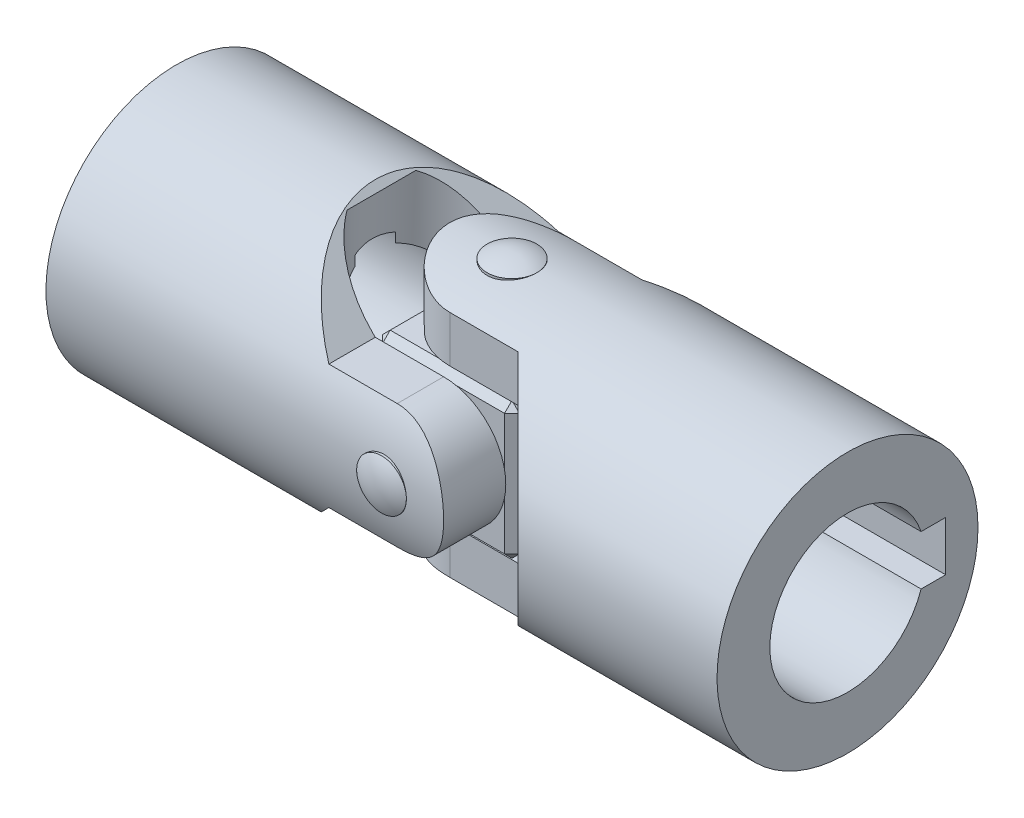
ISO-10303-21;
HEADER;
FILE_DESCRIPTION(('STEP AP214'),'2;1');
FILE_NAME('part.step','',(''),(''),'','','');
FILE_SCHEMA(('AUTOMOTIVE_DESIGN { 1 0 10303 214 1 1 1 1 }'));
ENDSEC;
DATA;
#1=APPLICATION_CONTEXT('core data for automotive mechanical design processes');
#2=APPLICATION_PROTOCOL_DEFINITION('international standard','automotive_design',2000,#1);
#3=PRODUCT_CONTEXT('',#1,'mechanical');
#4=PRODUCT('Part','Part','',(#3));
#5=PRODUCT_RELATED_PRODUCT_CATEGORY('part','',(#4));
#6=PRODUCT_DEFINITION_FORMATION('','',#4);
#7=PRODUCT_DEFINITION_CONTEXT('part definition',#1,'design');
#8=PRODUCT_DEFINITION('design','',#6,#7);
#9=PRODUCT_DEFINITION_SHAPE('','',#8);
#10=(LENGTH_UNIT() NAMED_UNIT(*) SI_UNIT(.MILLI.,.METRE.));
#11=(NAMED_UNIT(*) PLANE_ANGLE_UNIT() SI_UNIT($,.RADIAN.));
#12=(NAMED_UNIT(*) SI_UNIT($,.STERADIAN.) SOLID_ANGLE_UNIT());
#13=UNCERTAINTY_MEASURE_WITH_UNIT(LENGTH_MEASURE(1.E-05),#10,'distance_accuracy_value','');
#14=(GEOMETRIC_REPRESENTATION_CONTEXT(3) GLOBAL_UNCERTAINTY_ASSIGNED_CONTEXT((#13)) GLOBAL_UNIT_ASSIGNED_CONTEXT((#10,
#11,#12)) REPRESENTATION_CONTEXT('',''));
#15=CARTESIAN_POINT('',(0.,0.,0.));
#16=DIRECTION('',(0.,0.,1.));
#17=DIRECTION('',(1.,0.,0.));
#18=AXIS2_PLACEMENT_3D('',#15,#16,#17);
#19=CARTESIAN_POINT('',(0.,21.,0.));
#20=DIRECTION('',(0.,-1.,0.));
#21=DIRECTION('',(-1.,0.,0.));
#22=AXIS2_PLACEMENT_3D('',#19,#20,#21);
#23=CYLINDRICAL_SURFACE('',#22,4.);
#24=CARTESIAN_POINT('',(0.,21.,0.));
#25=DIRECTION('',(0.,1.,0.));
#26=DIRECTION('',(1.,0.,0.));
#27=AXIS2_PLACEMENT_3D('',#24,#25,#26);
#28=CIRCLE('',#27,4.);
#29=CARTESIAN_POINT('',(-4.,21.,0.));
#30=VERTEX_POINT('',#29);
#31=EDGE_CURVE('P0_E10',#30,#30,#28,.T.);
#32=CARTESIAN_POINT('',(0.,-21.,0.));
#33=DIRECTION('',(0.,1.,0.));
#34=DIRECTION('',(0.,0.,1.));
#35=AXIS2_PLACEMENT_3D('',#32,#33,#34);
#36=CIRCLE('',#35,4.);
#37=CARTESIAN_POINT('',(-4.,-21.,0.));
#38=VERTEX_POINT('',#37);
#39=EDGE_CURVE('P0_E20',#38,#38,#36,.T.);
#40=CARTESIAN_POINT('',(-4.,21.,0.));
#41=CARTESIAN_POINT('',(-4.,20.5625,0.));
#42=CARTESIAN_POINT('',(-4.,20.125,0.));
#43=CARTESIAN_POINT('',(-4.,19.25,0.));
#44=CARTESIAN_POINT('',(-4.,18.8125,0.));
#45=CARTESIAN_POINT('',(-4.,17.9375,0.));
#46=CARTESIAN_POINT('',(-4.,17.5,0.));
#47=CARTESIAN_POINT('',(-4.,16.625,0.));
#48=CARTESIAN_POINT('',(-4.,16.1875,0.));
#49=CARTESIAN_POINT('',(-4.,15.3125,0.));
#50=CARTESIAN_POINT('',(-4.,14.875,0.));
#51=CARTESIAN_POINT('',(-4.,14.,0.));
#52=CARTESIAN_POINT('',(-4.,13.5625,0.));
#53=CARTESIAN_POINT('',(-4.,12.6875,0.));
#54=CARTESIAN_POINT('',(-4.,12.25,0.));
#55=CARTESIAN_POINT('',(-4.,11.375,0.));
#56=CARTESIAN_POINT('',(-4.,10.9375,0.));
#57=CARTESIAN_POINT('',(-4.,10.0625,0.));
#58=CARTESIAN_POINT('',(-4.,9.625,0.));
#59=CARTESIAN_POINT('',(-4.,8.75,0.));
#60=CARTESIAN_POINT('',(-4.,8.3125,0.));
#61=CARTESIAN_POINT('',(-4.,7.4375,0.));
#62=CARTESIAN_POINT('',(-4.,7.,0.));
#63=CARTESIAN_POINT('',(-4.,6.125,0.));
#64=CARTESIAN_POINT('',(-4.,5.6875,0.));
#65=CARTESIAN_POINT('',(-4.,4.8125,0.));
#66=CARTESIAN_POINT('',(-4.,4.375,0.));
#67=CARTESIAN_POINT('',(-4.,3.5,0.));
#68=CARTESIAN_POINT('',(-4.,3.0625,0.));
#69=CARTESIAN_POINT('',(-4.,2.1875,0.));
#70=CARTESIAN_POINT('',(-4.,1.75,0.));
#71=CARTESIAN_POINT('',(-4.,0.874999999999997,0.));
#72=CARTESIAN_POINT('',(-4.,0.437499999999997,0.));
#73=CARTESIAN_POINT('',(-4.,-0.437500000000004,0.));
#74=CARTESIAN_POINT('',(-4.,-0.875000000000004,0.));
#75=CARTESIAN_POINT('',(-4.,-1.75000000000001,0.));
#76=CARTESIAN_POINT('',(-4.,-2.18750000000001,0.));
#77=CARTESIAN_POINT('',(-4.,-3.0625,0.));
#78=CARTESIAN_POINT('',(-4.,-3.5,0.));
#79=CARTESIAN_POINT('',(-4.,-4.375,0.));
#80=CARTESIAN_POINT('',(-4.,-4.8125,0.));
#81=CARTESIAN_POINT('',(-4.,-5.68750000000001,0.));
#82=CARTESIAN_POINT('',(-4.,-6.12500000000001,0.));
#83=CARTESIAN_POINT('',(-4.,-7.00000000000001,0.));
#84=CARTESIAN_POINT('',(-4.,-7.4375,0.));
#85=CARTESIAN_POINT('',(-4.,-8.3125,0.));
#86=CARTESIAN_POINT('',(-4.,-8.75,0.));
#87=CARTESIAN_POINT('',(-4.,-9.625,0.));
#88=CARTESIAN_POINT('',(-4.,-10.0625,0.));
#89=CARTESIAN_POINT('',(-4.,-10.9375,0.));
#90=CARTESIAN_POINT('',(-4.,-11.375,0.));
#91=CARTESIAN_POINT('',(-4.,-12.25,0.));
#92=CARTESIAN_POINT('',(-4.,-12.6875,0.));
#93=CARTESIAN_POINT('',(-4.,-13.5625,0.));
#94=CARTESIAN_POINT('',(-4.,-14.,0.));
#95=CARTESIAN_POINT('',(-4.,-14.875,0.));
#96=CARTESIAN_POINT('',(-4.,-15.3125,0.));
#97=CARTESIAN_POINT('',(-4.,-16.1875,0.));
#98=CARTESIAN_POINT('',(-4.,-16.625,0.));
#99=CARTESIAN_POINT('',(-4.,-17.5,0.));
#100=CARTESIAN_POINT('',(-4.,-17.9375,0.));
#101=CARTESIAN_POINT('',(-4.,-18.8125,0.));
#102=CARTESIAN_POINT('',(-4.,-19.25,0.));
#103=CARTESIAN_POINT('',(-4.,-20.125,0.));
#104=CARTESIAN_POINT('',(-4.,-20.5625,0.));
#105=CARTESIAN_POINT('',(-4.,-21.,0.));
#106=B_SPLINE_CURVE_WITH_KNOTS('',3,(#40,#41,#42,#43,#44,#45,#46,#47,#48,#49,#50,#51,#52,#53,
#54,#55,#56,#57,#58,#59,#60,#61,#62,#63,#64,#65,#66,#67,#68,#69,#70,#71,#72,#73,#74,#75,#76,#77,
#78,#79,#80,#81,#82,#83,#84,#85,#86,#87,#88,#89,#90,#91,#92,#93,#94,#95,#96,#97,#98,#99,#100,
#101,#102,#103,#104,#105),.UNSPECIFIED.,.F.,.F.,(4,2,2,2,2,2,2,2,2,2,2,2,2,2,2,2,2,2,2,2,2,2,2,
2,2,2,2,2,2,2,2,2,4),(0.,1.3125,2.625,3.9375,5.25,6.5625,7.875,9.1875,10.5,11.8125,13.125,
14.4375,15.75,17.0625,18.375,19.6875,21.,22.3125,23.625,24.9375,26.25,27.5625,28.875,30.1875,
31.5,32.8125,34.125,35.4375,36.75,38.0625,39.375,40.6875,42.),.UNSPECIFIED.);
#107=EDGE_CURVE('P0_BSEAM14',#30,#38,#106,.T.);
#108=ORIENTED_EDGE('',*,*,#31,.F.);
#109=ORIENTED_EDGE('',*,*,#39,.T.);
#110=ORIENTED_EDGE('',*,*,#107,.T.);
#111=ORIENTED_EDGE('',*,*,#107,.F.);
#112=EDGE_LOOP('',(#108,#110,#109,#111));
#113=FACE_BOUND('',#112,.T.);
#114=ADVANCED_FACE('P0_F14',(#113),#23,.T.);
#115=CARTESIAN_POINT('',(0.,13.5,0.));
#116=DIRECTION('',(0.,1.,0.));
#117=DIRECTION('',(0.,0.,-1.));
#118=AXIS2_PLACEMENT_3D('',#115,#116,#117);
#119=SPHERICAL_SURFACE('',#118,8.49999999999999);
#120=ORIENTED_EDGE('',*,*,#31,.T.);
#121=EDGE_LOOP('',(#120));
#122=FACE_BOUND('',#121,.T.);
#123=ADVANCED_FACE('P0_F29',(#122),#119,.T.);
#124=CARTESIAN_POINT('',(0.,-13.5,0.));
#125=DIRECTION('',(0.,-1.,0.));
#126=DIRECTION('',(0.,0.,-1.));
#127=AXIS2_PLACEMENT_3D('',#124,#125,#126);
#128=SPHERICAL_SURFACE('',#127,8.49999999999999);
#129=ORIENTED_EDGE('',*,*,#39,.F.);
#130=EDGE_LOOP('',(#129));
#131=FACE_BOUND('',#130,.T.);
#132=ADVANCED_FACE('P0_F27',(#131),#128,.T.);
#133=CLOSED_SHELL('',(#114,#123,#132));
#134=MANIFOLD_SOLID_BREP('P0_B1',#133);
#135=CARTESIAN_POINT('',(0.,0.,21.));
#136=DIRECTION('',(0.,0.,-1.));
#137=DIRECTION('',(-1.,0.,0.));
#138=AXIS2_PLACEMENT_3D('',#135,#136,#137);
#139=CYLINDRICAL_SURFACE('',#138,4.);
#140=CARTESIAN_POINT('',(0.,0.,21.));
#141=DIRECTION('',(0.,0.,1.));
#142=DIRECTION('',(1.,0.,0.));
#143=AXIS2_PLACEMENT_3D('',#140,#141,#142);
#144=CIRCLE('',#143,4.);
#145=CARTESIAN_POINT('',(-4.,0.,21.));
#146=VERTEX_POINT('',#145);
#147=EDGE_CURVE('P1_E10',#146,#146,#144,.T.);
#148=CARTESIAN_POINT('',(0.,0.,-21.));
#149=DIRECTION('',(0.,0.,1.));
#150=DIRECTION('',(0.,-1.,0.));
#151=AXIS2_PLACEMENT_3D('',#148,#149,#150);
#152=CIRCLE('',#151,4.);
#153=CARTESIAN_POINT('',(-4.,0.,-21.));
#154=VERTEX_POINT('',#153);
#155=EDGE_CURVE('P1_E20',#154,#154,#152,.T.);
#156=CARTESIAN_POINT('',(-4.,0.,21.));
#157=CARTESIAN_POINT('',(-4.,0.,20.5625));
#158=CARTESIAN_POINT('',(-4.,0.,20.125));
#159=CARTESIAN_POINT('',(-4.,0.,19.25));
#160=CARTESIAN_POINT('',(-4.,0.,18.8125));
#161=CARTESIAN_POINT('',(-4.,0.,17.9375));
#162=CARTESIAN_POINT('',(-4.,0.,17.5));
#163=CARTESIAN_POINT('',(-4.,0.,16.625));
#164=CARTESIAN_POINT('',(-4.,0.,16.1875));
#165=CARTESIAN_POINT('',(-4.,0.,15.3125));
#166=CARTESIAN_POINT('',(-4.,0.,14.875));
#167=CARTESIAN_POINT('',(-4.,0.,14.));
#168=CARTESIAN_POINT('',(-4.,0.,13.5625));
#169=CARTESIAN_POINT('',(-4.,0.,12.6875));
#170=CARTESIAN_POINT('',(-4.,0.,12.25));
#171=CARTESIAN_POINT('',(-4.,0.,11.375));
#172=CARTESIAN_POINT('',(-4.,0.,10.9375));
#173=CARTESIAN_POINT('',(-4.,0.,10.0625));
#174=CARTESIAN_POINT('',(-4.,0.,9.625));
#175=CARTESIAN_POINT('',(-4.,0.,8.75));
#176=CARTESIAN_POINT('',(-4.,0.,8.3125));
#177=CARTESIAN_POINT('',(-4.,0.,7.4375));
#178=CARTESIAN_POINT('',(-4.,0.,7.));
#179=CARTESIAN_POINT('',(-4.,0.,6.125));
#180=CARTESIAN_POINT('',(-4.,0.,5.6875));
#181=CARTESIAN_POINT('',(-4.,0.,4.8125));
#182=CARTESIAN_POINT('',(-4.,0.,4.375));
#183=CARTESIAN_POINT('',(-4.,0.,3.5));
#184=CARTESIAN_POINT('',(-4.,0.,3.0625));
#185=CARTESIAN_POINT('',(-4.,0.,2.1875));
#186=CARTESIAN_POINT('',(-4.,0.,1.75));
#187=CARTESIAN_POINT('',(-4.,0.,0.874999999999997));
#188=CARTESIAN_POINT('',(-4.,0.,0.437499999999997));
#189=CARTESIAN_POINT('',(-4.,0.,-0.437500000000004));
#190=CARTESIAN_POINT('',(-4.,0.,-0.875000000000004));
#191=CARTESIAN_POINT('',(-4.,0.,-1.75000000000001));
#192=CARTESIAN_POINT('',(-4.,0.,-2.18750000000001));
#193=CARTESIAN_POINT('',(-4.,0.,-3.0625));
#194=CARTESIAN_POINT('',(-4.,0.,-3.5));
#195=CARTESIAN_POINT('',(-4.,0.,-4.375));
#196=CARTESIAN_POINT('',(-4.,0.,-4.8125));
#197=CARTESIAN_POINT('',(-4.,0.,-5.68750000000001));
#198=CARTESIAN_POINT('',(-4.,0.,-6.12500000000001));
#199=CARTESIAN_POINT('',(-4.,0.,-7.00000000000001));
#200=CARTESIAN_POINT('',(-4.,0.,-7.4375));
#201=CARTESIAN_POINT('',(-4.,0.,-8.3125));
#202=CARTESIAN_POINT('',(-4.,0.,-8.75));
#203=CARTESIAN_POINT('',(-4.,0.,-9.625));
#204=CARTESIAN_POINT('',(-4.,0.,-10.0625));
#205=CARTESIAN_POINT('',(-4.,0.,-10.9375));
#206=CARTESIAN_POINT('',(-4.,0.,-11.375));
#207=CARTESIAN_POINT('',(-4.,0.,-12.25));
#208=CARTESIAN_POINT('',(-4.,0.,-12.6875));
#209=CARTESIAN_POINT('',(-4.,0.,-13.5625));
#210=CARTESIAN_POINT('',(-4.,0.,-14.));
#211=CARTESIAN_POINT('',(-4.,0.,-14.875));
#212=CARTESIAN_POINT('',(-4.,0.,-15.3125));
#213=CARTESIAN_POINT('',(-4.,0.,-16.1875));
#214=CARTESIAN_POINT('',(-4.,0.,-16.625));
#215=CARTESIAN_POINT('',(-4.,0.,-17.5));
#216=CARTESIAN_POINT('',(-4.,0.,-17.9375));
#217=CARTESIAN_POINT('',(-4.,0.,-18.8125));
#218=CARTESIAN_POINT('',(-4.,0.,-19.25));
#219=CARTESIAN_POINT('',(-4.,0.,-20.125));
#220=CARTESIAN_POINT('',(-4.,0.,-20.5625));
#221=CARTESIAN_POINT('',(-4.,0.,-21.));
#222=B_SPLINE_CURVE_WITH_KNOTS('',3,(#156,#157,#158,#159,#160,#161,#162,#163,#164,#165,#166,
#167,#168,#169,#170,#171,#172,#173,#174,#175,#176,#177,#178,#179,#180,#181,#182,#183,#184,#185,
#186,#187,#188,#189,#190,#191,#192,#193,#194,#195,#196,#197,#198,#199,#200,#201,#202,#203,#204,
#205,#206,#207,#208,#209,#210,#211,#212,#213,#214,#215,#216,#217,#218,#219,#220,#221),
.UNSPECIFIED.,.F.,.F.,(4,2,2,2,2,2,2,2,2,2,2,2,2,2,2,2,2,2,2,2,2,2,2,2,2,2,2,2,2,2,2,2,4),(0.,
1.3125,2.625,3.9375,5.25,6.5625,7.875,9.1875,10.5,11.8125,13.125,14.4375,15.75,17.0625,18.375,
19.6875,21.,22.3125,23.625,24.9375,26.25,27.5625,28.875,30.1875,31.5,32.8125,34.125,35.4375,
36.75,38.0625,39.375,40.6875,42.),.UNSPECIFIED.);
#223=EDGE_CURVE('P1_BSEAM14',#146,#154,#222,.T.);
#224=ORIENTED_EDGE('',*,*,#147,.F.);
#225=ORIENTED_EDGE('',*,*,#155,.T.);
#226=ORIENTED_EDGE('',*,*,#223,.T.);
#227=ORIENTED_EDGE('',*,*,#223,.F.);
#228=EDGE_LOOP('',(#224,#226,#225,#227));
#229=FACE_BOUND('',#228,.T.);
#230=ADVANCED_FACE('P1_F14',(#229),#139,.T.);
#231=CARTESIAN_POINT('',(0.,0.,13.5));
#232=DIRECTION('',(0.,0.,1.));
#233=DIRECTION('',(0.,1.,0.));
#234=AXIS2_PLACEMENT_3D('',#231,#232,#233);
#235=SPHERICAL_SURFACE('',#234,8.49999999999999);
#236=ORIENTED_EDGE('',*,*,#147,.T.);
#237=EDGE_LOOP('',(#236));
#238=FACE_BOUND('',#237,.T.);
#239=ADVANCED_FACE('P1_F29',(#238),#235,.T.);
#240=CARTESIAN_POINT('',(0.,0.,-13.5));
#241=DIRECTION('',(0.,0.,-1.));
#242=DIRECTION('',(0.,1.,0.));
#243=AXIS2_PLACEMENT_3D('',#240,#241,#242);
#244=SPHERICAL_SURFACE('',#243,8.49999999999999);
#245=ORIENTED_EDGE('',*,*,#155,.F.);
#246=EDGE_LOOP('',(#245));
#247=FACE_BOUND('',#246,.T.);
#248=ADVANCED_FACE('P1_F27',(#247),#244,.T.);
#249=CLOSED_SHELL('',(#230,#239,#248));
#250=MANIFOLD_SOLID_BREP('P1_B1',#249);
#251=CARTESIAN_POINT('',(0.,0.,11.));
#252=DIRECTION('',(0.,0.,-1.));
#253=DIRECTION('',(-1.,0.,0.));
#254=AXIS2_PLACEMENT_3D('',#251,#252,#253);
#255=CYLINDRICAL_SURFACE('',#254,4.);
#256=CARTESIAN_POINT('',(0.,0.,0.));
#257=DIRECTION('',(0.,0.707106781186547,-0.707106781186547));
#258=DIRECTION('',(0.,-0.707106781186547,-0.707106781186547));
#259=AXIS2_PLACEMENT_3D('',#256,#257,#258);
#260=ELLIPSE('',#259,5.65685424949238,4.);
#261=CARTESIAN_POINT('',(4.,0.,0.));
#262=VERTEX_POINT('',#261);
#263=CARTESIAN_POINT('',(-4.,0.,0.));
#264=VERTEX_POINT('',#263);
#265=EDGE_CURVE('P2_E116',#262,#264,#260,.F.);
#266=ORIENTED_EDGE('',*,*,#265,.F.);
#267=CARTESIAN_POINT('',(0.,0.,0.));
#268=DIRECTION('',(0.,-0.707106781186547,-0.707106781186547));
#269=DIRECTION('',(0.,0.707106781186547,-0.707106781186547));
#270=AXIS2_PLACEMENT_3D('',#267,#268,#269);
#271=ELLIPSE('',#270,5.65685424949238,4.);
#272=EDGE_CURVE('P2_E120',#264,#262,#271,.F.);
#273=ORIENTED_EDGE('',*,*,#272,.F.);
#274=EDGE_LOOP('',(#266,#273));
#275=FACE_BOUND('',#274,.T.);
#276=CARTESIAN_POINT('',(0.,0.,11.));
#277=DIRECTION('',(0.,0.,1.));
#278=DIRECTION('',(1.,0.,0.));
#279=AXIS2_PLACEMENT_3D('',#276,#277,#278);
#280=CIRCLE('',#279,4.);
#281=CARTESIAN_POINT('',(4.,0.,11.));
#282=VERTEX_POINT('',#281);
#283=EDGE_CURVE('P2_E127',#282,#282,#280,.T.);
#284=ORIENTED_EDGE('',*,*,#283,.T.);
#285=EDGE_LOOP('',(#284));
#286=FACE_BOUND('',#285,.T.);
#287=ADVANCED_FACE('P2_F16',(#275,#286),#255,.F.);
#288=CARTESIAN_POINT('',(11.,11.,11.));
#289=DIRECTION('',(0.,0.,1.));
#290=DIRECTION('',(1.,0.,0.));
#291=AXIS2_PLACEMENT_3D('',#288,#289,#290);
#292=PLANE('',#291);
#293=DIRECTION('',(0.,-1.,0.));
#294=VECTOR('',#293,1.);
#295=CARTESIAN_POINT('',(-9.8,-11.,11.));
#296=LINE('',#295,#294);
#297=CARTESIAN_POINT('',(-9.8,9.8,11.));
#298=VERTEX_POINT('',#297);
#299=CARTESIAN_POINT('',(-9.8,-9.8,11.));
#300=VERTEX_POINT('',#299);
#301=EDGE_CURVE('P2_E164',#298,#300,#296,.T.);
#302=ORIENTED_EDGE('',*,*,#301,.T.);
#303=DIRECTION('',(1.,0.,0.));
#304=VECTOR('',#303,1.);
#305=CARTESIAN_POINT('',(11.,-9.8,11.));
#306=LINE('',#305,#304);
#307=CARTESIAN_POINT('',(9.8,-9.8,11.));
#308=VERTEX_POINT('',#307);
#309=EDGE_CURVE('P2_E168',#300,#308,#306,.T.);
#310=ORIENTED_EDGE('',*,*,#309,.T.);
#311=DIRECTION('',(0.,1.,0.));
#312=VECTOR('',#311,1.);
#313=CARTESIAN_POINT('',(9.8,11.,11.));
#314=LINE('',#313,#312);
#315=CARTESIAN_POINT('',(9.8,9.8,11.));
#316=VERTEX_POINT('',#315);
#317=EDGE_CURVE('P2_E166',#308,#316,#314,.T.);
#318=ORIENTED_EDGE('',*,*,#317,.T.);
#319=DIRECTION('',(-1.,0.,0.));
#320=VECTOR('',#319,1.);
#321=CARTESIAN_POINT('',(-11.,9.8,11.));
#322=LINE('',#321,#320);
#323=EDGE_CURVE('P2_E162',#316,#298,#322,.T.);
#324=ORIENTED_EDGE('',*,*,#323,.T.);
#325=EDGE_LOOP('',(#302,#310,#318,#324));
#326=FACE_BOUND('',#325,.T.);
#327=ORIENTED_EDGE('',*,*,#283,.F.);
#328=EDGE_LOOP('',(#327));
#329=FACE_BOUND('',#328,.T.);
#330=ADVANCED_FACE('P2_F282',(#326,#329),#292,.T.);
#331=CARTESIAN_POINT('',(11.,11.,-11.));
#332=DIRECTION('',(0.,0.,1.));
#333=DIRECTION('',(1.,0.,0.));
#334=AXIS2_PLACEMENT_3D('',#331,#332,#333);
#335=PLANE('',#334);
#336=DIRECTION('',(-1.,0.,0.));
#337=VECTOR('',#336,1.);
#338=CARTESIAN_POINT('',(11.,-9.8,-11.));
#339=LINE('',#338,#337);
#340=CARTESIAN_POINT('',(9.8,-9.8,-11.));
#341=VERTEX_POINT('',#340);
#342=CARTESIAN_POINT('',(-9.8,-9.8,-11.));
#343=VERTEX_POINT('',#342);
#344=EDGE_CURVE('P2_E157',#341,#343,#339,.T.);
#345=ORIENTED_EDGE('',*,*,#344,.T.);
#346=DIRECTION('',(0.,1.,0.));
#347=VECTOR('',#346,1.);
#348=CARTESIAN_POINT('',(-9.8,11.,-11.));
#349=LINE('',#348,#347);
#350=CARTESIAN_POINT('',(-9.8,9.8,-11.));
#351=VERTEX_POINT('',#350);
#352=EDGE_CURVE('P2_E159',#343,#351,#349,.T.);
#353=ORIENTED_EDGE('',*,*,#352,.T.);
#354=DIRECTION('',(1.,0.,0.));
#355=VECTOR('',#354,1.);
#356=CARTESIAN_POINT('',(11.,9.8,-11.));
#357=LINE('',#356,#355);
#358=CARTESIAN_POINT('',(9.8,9.8,-11.));
#359=VERTEX_POINT('',#358);
#360=EDGE_CURVE('P2_E153',#351,#359,#357,.T.);
#361=ORIENTED_EDGE('',*,*,#360,.T.);
#362=DIRECTION('',(0.,-1.,0.));
#363=VECTOR('',#362,1.);
#364=CARTESIAN_POINT('',(9.8,11.,-11.));
#365=LINE('',#364,#363);
#366=EDGE_CURVE('P2_E155',#359,#341,#365,.T.);
#367=ORIENTED_EDGE('',*,*,#366,.T.);
#368=EDGE_LOOP('',(#345,#353,#361,#367));
#369=FACE_BOUND('',#368,.T.);
#370=CARTESIAN_POINT('',(0.,0.,-11.));
#371=DIRECTION('',(0.,0.,1.));
#372=DIRECTION('',(1.,0.,0.));
#373=AXIS2_PLACEMENT_3D('',#370,#371,#372);
#374=CIRCLE('',#373,4.);
#375=CARTESIAN_POINT('',(4.,0.,-11.));
#376=VERTEX_POINT('',#375);
#377=EDGE_CURVE('P2_E259',#376,#376,#374,.T.);
#378=ORIENTED_EDGE('',*,*,#377,.T.);
#379=EDGE_LOOP('',(#378));
#380=FACE_BOUND('',#379,.T.);
#381=ADVANCED_FACE('P2_F267',(#369,#380),#335,.F.);
#382=CARTESIAN_POINT('',(-11.,11.,11.));
#383=DIRECTION('',(0.,-1.,0.));
#384=DIRECTION('',(0.,0.,-1.));
#385=AXIS2_PLACEMENT_3D('',#382,#383,#384);
#386=PLANE('',#385);
#387=DIRECTION('',(-1.,0.,0.));
#388=VECTOR('',#387,1.);
#389=CARTESIAN_POINT('',(-11.,11.,-9.8));
#390=LINE('',#389,#388);
#391=CARTESIAN_POINT('',(9.8,11.,-9.8));
#392=VERTEX_POINT('',#391);
#393=CARTESIAN_POINT('',(-9.8,11.,-9.8));
#394=VERTEX_POINT('',#393);
#395=EDGE_CURVE('P2_E25',#392,#394,#390,.T.);
#396=ORIENTED_EDGE('',*,*,#395,.T.);
#397=DIRECTION('',(0.,0.,1.));
#398=VECTOR('',#397,1.);
#399=CARTESIAN_POINT('',(-9.8,11.,11.));
#400=LINE('',#399,#398);
#401=CARTESIAN_POINT('',(-9.8,11.,9.8));
#402=VERTEX_POINT('',#401);
#403=EDGE_CURVE('P2_E11',#394,#402,#400,.T.);
#404=ORIENTED_EDGE('',*,*,#403,.T.);
#405=DIRECTION('',(1.,0.,0.));
#406=VECTOR('',#405,1.);
#407=CARTESIAN_POINT('',(11.,11.,9.8));
#408=LINE('',#407,#406);
#409=CARTESIAN_POINT('',(9.8,11.,9.8));
#410=VERTEX_POINT('',#409);
#411=EDGE_CURVE('P2_E180',#402,#410,#408,.T.);
#412=ORIENTED_EDGE('',*,*,#411,.T.);
#413=DIRECTION('',(0.,0.,-1.));
#414=VECTOR('',#413,1.);
#415=CARTESIAN_POINT('',(9.8,11.,11.));
#416=LINE('',#415,#414);
#417=EDGE_CURVE('P2_E36',#410,#392,#416,.T.);
#418=ORIENTED_EDGE('',*,*,#417,.T.);
#419=EDGE_LOOP('',(#396,#404,#412,#418));
#420=FACE_BOUND('',#419,.T.);
#421=CARTESIAN_POINT('',(0.,11.,0.));
#422=DIRECTION('',(0.,1.,0.));
#423=DIRECTION('',(0.,0.,1.));
#424=AXIS2_PLACEMENT_3D('',#421,#422,#423);
#425=CIRCLE('',#424,4.);
#426=CARTESIAN_POINT('',(0.,11.,4.));
#427=VERTEX_POINT('',#426);
#428=EDGE_CURVE('P2_E249',#427,#427,#425,.T.);
#429=ORIENTED_EDGE('',*,*,#428,.F.);
#430=EDGE_LOOP('',(#429));
#431=FACE_BOUND('',#430,.T.);
#432=ADVANCED_FACE('P2_F290',(#420,#431),#386,.F.);
#433=CARTESIAN_POINT('',(-11.,-11.,11.));
#434=DIRECTION('',(1.,0.,0.));
#435=DIRECTION('',(0.,0.,-1.));
#436=AXIS2_PLACEMENT_3D('',#433,#434,#435);
#437=PLANE('',#436);
#438=DIRECTION('',(0.,-1.,0.));
#439=VECTOR('',#438,1.);
#440=CARTESIAN_POINT('',(-11.,-11.,-9.8));
#441=LINE('',#440,#439);
#442=CARTESIAN_POINT('',(-11.,9.8,-9.8));
#443=VERTEX_POINT('',#442);
#444=CARTESIAN_POINT('',(-11.,-9.8,-9.8));
#445=VERTEX_POINT('',#444);
#446=EDGE_CURVE('P2_E148',#443,#445,#441,.T.);
#447=ORIENTED_EDGE('',*,*,#446,.T.);
#448=DIRECTION('',(0.,0.,1.));
#449=VECTOR('',#448,1.);
#450=CARTESIAN_POINT('',(-11.,-9.8,11.));
#451=LINE('',#450,#449);
#452=CARTESIAN_POINT('',(-11.,-9.8,9.8));
#453=VERTEX_POINT('',#452);
#454=EDGE_CURVE('P2_E150',#445,#453,#451,.T.);
#455=ORIENTED_EDGE('',*,*,#454,.T.);
#456=DIRECTION('',(0.,1.,0.));
#457=VECTOR('',#456,1.);
#458=CARTESIAN_POINT('',(-11.,11.,9.8));
#459=LINE('',#458,#457);
#460=CARTESIAN_POINT('',(-11.,9.8,9.8));
#461=VERTEX_POINT('',#460);
#462=EDGE_CURVE('P2_E146',#453,#461,#459,.T.);
#463=ORIENTED_EDGE('',*,*,#462,.T.);
#464=DIRECTION('',(0.,0.,-1.));
#465=VECTOR('',#464,1.);
#466=CARTESIAN_POINT('',(-11.,9.8,11.));
#467=LINE('',#466,#465);
#468=EDGE_CURVE('P2_E144',#461,#443,#467,.T.);
#469=ORIENTED_EDGE('',*,*,#468,.T.);
#470=EDGE_LOOP('',(#447,#455,#463,#469));
#471=FACE_BOUND('',#470,.T.);
#472=ADVANCED_FACE('P2_F297',(#471),#437,.F.);
#473=CARTESIAN_POINT('',(-11.,-11.,11.));
#474=DIRECTION('',(0.,1.,0.));
#475=DIRECTION('',(0.,0.,1.));
#476=AXIS2_PLACEMENT_3D('',#473,#474,#475);
#477=PLANE('',#476);
#478=DIRECTION('',(-1.,0.,0.));
#479=VECTOR('',#478,1.);
#480=CARTESIAN_POINT('',(-11.,-11.,9.8));
#481=LINE('',#480,#479);
#482=CARTESIAN_POINT('',(9.8,-11.,9.8));
#483=VERTEX_POINT('',#482);
#484=CARTESIAN_POINT('',(-9.8,-11.,9.8));
#485=VERTEX_POINT('',#484);
#486=EDGE_CURVE('P2_E137',#483,#485,#481,.T.);
#487=ORIENTED_EDGE('',*,*,#486,.T.);
#488=DIRECTION('',(0.,0.,-1.));
#489=VECTOR('',#488,1.);
#490=CARTESIAN_POINT('',(-9.8,-11.,11.));
#491=LINE('',#490,#489);
#492=CARTESIAN_POINT('',(-9.8,-11.,-9.8));
#493=VERTEX_POINT('',#492);
#494=EDGE_CURVE('P2_E141',#485,#493,#491,.T.);
#495=ORIENTED_EDGE('',*,*,#494,.T.);
#496=DIRECTION('',(1.,0.,0.));
#497=VECTOR('',#496,1.);
#498=CARTESIAN_POINT('',(-11.,-11.,-9.8));
#499=LINE('',#498,#497);
#500=CARTESIAN_POINT('',(9.8,-11.,-9.8));
#501=VERTEX_POINT('',#500);
#502=EDGE_CURVE('P2_E139',#493,#501,#499,.T.);
#503=ORIENTED_EDGE('',*,*,#502,.T.);
#504=DIRECTION('',(0.,0.,1.));
#505=VECTOR('',#504,1.);
#506=CARTESIAN_POINT('',(9.8,-11.,11.));
#507=LINE('',#506,#505);
#508=EDGE_CURVE('P2_E130',#501,#483,#507,.T.);
#509=ORIENTED_EDGE('',*,*,#508,.T.);
#510=EDGE_LOOP('',(#487,#495,#503,#509));
#511=FACE_BOUND('',#510,.T.);
#512=CARTESIAN_POINT('',(0.,-11.,0.));
#513=DIRECTION('',(0.,1.,0.));
#514=DIRECTION('',(0.,0.,1.));
#515=AXIS2_PLACEMENT_3D('',#512,#513,#514);
#516=CIRCLE('',#515,4.);
#517=CARTESIAN_POINT('',(0.,-11.,4.));
#518=VERTEX_POINT('',#517);
#519=EDGE_CURVE('P2_E255',#518,#518,#516,.T.);
#520=ORIENTED_EDGE('',*,*,#519,.T.);
#521=EDGE_LOOP('',(#520));
#522=FACE_BOUND('',#521,.T.);
#523=ADVANCED_FACE('P2_F277',(#511,#522),#477,.F.);
#524=CARTESIAN_POINT('',(11.,-11.,11.));
#525=DIRECTION('',(-1.,0.,0.));
#526=DIRECTION('',(0.,0.,1.));
#527=AXIS2_PLACEMENT_3D('',#524,#525,#526);
#528=PLANE('',#527);
#529=DIRECTION('',(0.,-1.,0.));
#530=VECTOR('',#529,1.);
#531=CARTESIAN_POINT('',(11.,-11.,9.8));
#532=LINE('',#531,#530);
#533=CARTESIAN_POINT('',(11.,9.8,9.8));
#534=VERTEX_POINT('',#533);
#535=CARTESIAN_POINT('',(11.,-9.8,9.8));
#536=VERTEX_POINT('',#535);
#537=EDGE_CURVE('P2_E173',#534,#536,#532,.T.);
#538=ORIENTED_EDGE('',*,*,#537,.T.);
#539=DIRECTION('',(0.,0.,-1.));
#540=VECTOR('',#539,1.);
#541=CARTESIAN_POINT('',(11.,-9.8,11.));
#542=LINE('',#541,#540);
#543=CARTESIAN_POINT('',(11.,-9.8,-9.8));
#544=VERTEX_POINT('',#543);
#545=EDGE_CURVE('P2_E177',#536,#544,#542,.T.);
#546=ORIENTED_EDGE('',*,*,#545,.T.);
#547=DIRECTION('',(0.,1.,0.));
#548=VECTOR('',#547,1.);
#549=CARTESIAN_POINT('',(11.,-11.,-9.8));
#550=LINE('',#549,#548);
#551=CARTESIAN_POINT('',(11.,9.8,-9.8));
#552=VERTEX_POINT('',#551);
#553=EDGE_CURVE('P2_E175',#544,#552,#550,.T.);
#554=ORIENTED_EDGE('',*,*,#553,.T.);
#555=DIRECTION('',(0.,0.,1.));
#556=VECTOR('',#555,1.);
#557=CARTESIAN_POINT('',(11.,9.8,11.));
#558=LINE('',#557,#556);
#559=EDGE_CURVE('P2_E171',#552,#534,#558,.T.);
#560=ORIENTED_EDGE('',*,*,#559,.T.);
#561=EDGE_LOOP('',(#538,#546,#554,#560));
#562=FACE_BOUND('',#561,.T.);
#563=ADVANCED_FACE('P2_F269',(#562),#528,.F.);
#564=CARTESIAN_POINT('',(0.,0.,0.));
#565=DIRECTION('',(0.,0.707106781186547,-0.707106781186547));
#566=DIRECTION('',(0.,-0.707106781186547,-0.707106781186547));
#567=AXIS2_PLACEMENT_3D('',#564,#565,#566);
#568=ELLIPSE('',#567,5.65685424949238,4.);
#569=EDGE_CURVE('P2_E119',#262,#264,#568,.T.);
#570=ORIENTED_EDGE('',*,*,#569,.F.);
#571=CARTESIAN_POINT('',(0.,0.,0.));
#572=DIRECTION('',(0.,-0.707106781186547,-0.707106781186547));
#573=DIRECTION('',(0.,0.707106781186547,-0.707106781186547));
#574=AXIS2_PLACEMENT_3D('',#571,#572,#573);
#575=ELLIPSE('',#574,5.65685424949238,4.);
#576=EDGE_CURVE('P2_E111',#264,#262,#575,.T.);
#577=ORIENTED_EDGE('',*,*,#576,.F.);
#578=EDGE_LOOP('',(#570,#577));
#579=FACE_BOUND('',#578,.T.);
#580=ORIENTED_EDGE('',*,*,#377,.F.);
#581=EDGE_LOOP('',(#580));
#582=FACE_BOUND('',#581,.T.);
#583=ADVANCED_FACE('P2_F132',(#579,#582),#255,.F.);
#584=CARTESIAN_POINT('',(0.,-11.,0.));
#585=DIRECTION('',(0.,1.,0.));
#586=DIRECTION('',(0.,0.,1.));
#587=AXIS2_PLACEMENT_3D('',#584,#585,#586);
#588=CYLINDRICAL_SURFACE('',#587,4.);
#589=ORIENTED_EDGE('',*,*,#569,.T.);
#590=ORIENTED_EDGE('',*,*,#272,.T.);
#591=EDGE_LOOP('',(#589,#590));
#592=FACE_BOUND('',#591,.T.);
#593=ORIENTED_EDGE('',*,*,#519,.F.);
#594=EDGE_LOOP('',(#593));
#595=FACE_BOUND('',#594,.T.);
#596=ADVANCED_FACE('P2_F124',(#592,#595),#588,.F.);
#597=ORIENTED_EDGE('',*,*,#265,.T.);
#598=ORIENTED_EDGE('',*,*,#576,.T.);
#599=EDGE_LOOP('',(#597,#598));
#600=FACE_BOUND('',#599,.T.);
#601=ORIENTED_EDGE('',*,*,#428,.T.);
#602=EDGE_LOOP('',(#601));
#603=FACE_BOUND('',#602,.T.);
#604=ADVANCED_FACE('P2_F113',(#600,#603),#588,.F.);
#605=CARTESIAN_POINT('',(9.8,11.,11.));
#606=DIRECTION('',(-0.707106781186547,-0.707106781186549,0.));
#607=DIRECTION('',(0.707106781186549,-0.707106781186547,0.));
#608=AXIS2_PLACEMENT_3D('',#605,#606,#607);
#609=PLANE('',#608);
#610=DIRECTION('',(0.707106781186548,-0.707106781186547,0.));
#611=VECTOR('',#610,1.);
#612=CARTESIAN_POINT('',(10.4,10.4,9.8));
#613=LINE('',#612,#611);
#614=EDGE_CURVE('P2_E20',#534,#410,#613,.F.);
#615=ORIENTED_EDGE('',*,*,#614,.F.);
#616=ORIENTED_EDGE('',*,*,#559,.F.);
#617=DIRECTION('',(-0.707106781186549,0.707106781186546,0.));
#618=VECTOR('',#617,1.);
#619=CARTESIAN_POINT('',(11.,9.8,-9.8));
#620=LINE('',#619,#618);
#621=EDGE_CURVE('P2_E243',#392,#552,#620,.F.);
#622=ORIENTED_EDGE('',*,*,#621,.F.);
#623=ORIENTED_EDGE('',*,*,#417,.F.);
#624=EDGE_LOOP('',(#615,#616,#622,#623));
#625=FACE_BOUND('',#624,.T.);
#626=ADVANCED_FACE('P2_F18',(#625),#609,.F.);
#627=CARTESIAN_POINT('',(9.8,9.8,11.));
#628=DIRECTION('',(0.577350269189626,0.577350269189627,0.577350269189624));
#629=DIRECTION('',(-0.707106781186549,0.707106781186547,0.));
#630=AXIS2_PLACEMENT_3D('',#627,#628,#629);
#631=PLANE('',#630);
#632=DIRECTION('',(0.707106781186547,0.,-0.707106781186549));
#633=VECTOR('',#632,1.);
#634=CARTESIAN_POINT('',(9.8,9.8,11.));
#635=LINE('',#634,#633);
#636=EDGE_CURVE('P2_E238',#534,#316,#635,.F.);
#637=ORIENTED_EDGE('',*,*,#636,.F.);
#638=ORIENTED_EDGE('',*,*,#614,.T.);
#639=DIRECTION('',(0.,-0.707106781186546,0.707106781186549));
#640=VECTOR('',#639,1.);
#641=CARTESIAN_POINT('',(9.8,9.8,11.));
#642=LINE('',#641,#640);
#643=EDGE_CURVE('P2_E241',#316,#410,#642,.F.);
#644=ORIENTED_EDGE('',*,*,#643,.F.);
#645=EDGE_LOOP('',(#637,#638,#644));
#646=FACE_BOUND('',#645,.T.);
#647=ADVANCED_FACE('P2_F374',(#646),#631,.T.);
#648=CARTESIAN_POINT('',(11.,9.8,-9.8));
#649=DIRECTION('',(0.577350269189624,0.577350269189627,-0.577350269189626));
#650=DIRECTION('',(0.,0.707106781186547,0.707106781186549));
#651=AXIS2_PLACEMENT_3D('',#648,#649,#650);
#652=PLANE('',#651);
#653=DIRECTION('',(0.,-0.707106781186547,-0.707106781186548));
#654=VECTOR('',#653,1.);
#655=CARTESIAN_POINT('',(9.8,10.4,-10.4));
#656=LINE('',#655,#654);
#657=EDGE_CURVE('P2_E232',#392,#359,#656,.T.);
#658=ORIENTED_EDGE('',*,*,#657,.F.);
#659=ORIENTED_EDGE('',*,*,#621,.T.);
#660=DIRECTION('',(0.707106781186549,0.,0.707106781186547));
#661=VECTOR('',#660,1.);
#662=CARTESIAN_POINT('',(11.,9.8,-9.8));
#663=LINE('',#662,#661);
#664=EDGE_CURVE('P2_E235',#359,#552,#663,.T.);
#665=ORIENTED_EDGE('',*,*,#664,.F.);
#666=EDGE_LOOP('',(#658,#659,#665));
#667=FACE_BOUND('',#666,.T.);
#668=ADVANCED_FACE('P2_F371',(#667),#652,.T.);
#669=CARTESIAN_POINT('',(11.,9.8,11.));
#670=DIRECTION('',(0.,0.707106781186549,0.707106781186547));
#671=DIRECTION('',(0.,-0.707106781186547,0.707106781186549));
#672=AXIS2_PLACEMENT_3D('',#669,#670,#671);
#673=PLANE('',#672);
#674=ORIENTED_EDGE('',*,*,#643,.T.);
#675=ORIENTED_EDGE('',*,*,#411,.F.);
#676=DIRECTION('',(0.,0.707106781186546,-0.707106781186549));
#677=VECTOR('',#676,1.);
#678=CARTESIAN_POINT('',(-9.8,10.4,10.4));
#679=LINE('',#678,#677);
#680=EDGE_CURVE('P2_E227',#298,#402,#679,.T.);
#681=ORIENTED_EDGE('',*,*,#680,.F.);
#682=ORIENTED_EDGE('',*,*,#323,.F.);
#683=EDGE_LOOP('',(#674,#675,#681,#682));
#684=FACE_BOUND('',#683,.T.);
#685=ADVANCED_FACE('P2_F367',(#684),#673,.T.);
#686=CARTESIAN_POINT('',(9.8,11.,11.));
#687=DIRECTION('',(0.707106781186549,0.,0.707106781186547));
#688=DIRECTION('',(0.707106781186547,0.,-0.707106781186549));
#689=AXIS2_PLACEMENT_3D('',#686,#687,#688);
#690=PLANE('',#689);
#691=ORIENTED_EDGE('',*,*,#636,.T.);
#692=ORIENTED_EDGE('',*,*,#317,.F.);
#693=DIRECTION('',(-0.707106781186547,0.,0.707106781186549));
#694=VECTOR('',#693,1.);
#695=CARTESIAN_POINT('',(9.8,-9.8,11.));
#696=LINE('',#695,#694);
#697=EDGE_CURVE('P2_E224',#536,#308,#696,.T.);
#698=ORIENTED_EDGE('',*,*,#697,.F.);
#699=ORIENTED_EDGE('',*,*,#537,.F.);
#700=EDGE_LOOP('',(#691,#692,#698,#699));
#701=FACE_BOUND('',#700,.T.);
#702=ADVANCED_FACE('P2_F363',(#701),#690,.T.);
#703=CARTESIAN_POINT('',(11.,-9.8,11.));
#704=DIRECTION('',(-0.707106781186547,0.707106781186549,0.));
#705=DIRECTION('',(-0.707106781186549,-0.707106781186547,0.));
#706=AXIS2_PLACEMENT_3D('',#703,#704,#705);
#707=PLANE('',#706);
#708=DIRECTION('',(0.707106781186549,0.707106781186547,0.));
#709=VECTOR('',#708,1.);
#710=CARTESIAN_POINT('',(9.8,-11.,-9.8));
#711=LINE('',#710,#709);
#712=EDGE_CURVE('P2_E218',#544,#501,#711,.F.);
#713=ORIENTED_EDGE('',*,*,#712,.F.);
#714=ORIENTED_EDGE('',*,*,#545,.F.);
#715=DIRECTION('',(-0.707106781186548,-0.707106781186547,0.));
#716=VECTOR('',#715,1.);
#717=CARTESIAN_POINT('',(10.4,-10.4,9.8));
#718=LINE('',#717,#716);
#719=EDGE_CURVE('P2_E221',#483,#536,#718,.F.);
#720=ORIENTED_EDGE('',*,*,#719,.F.);
#721=ORIENTED_EDGE('',*,*,#508,.F.);
#722=EDGE_LOOP('',(#713,#714,#720,#721));
#723=FACE_BOUND('',#722,.T.);
#724=ADVANCED_FACE('P2_F359',(#723),#707,.F.);
#725=CARTESIAN_POINT('',(11.,-11.,-9.8));
#726=DIRECTION('',(-0.707106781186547,0.,0.707106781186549));
#727=DIRECTION('',(0.707106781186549,0.,0.707106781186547));
#728=AXIS2_PLACEMENT_3D('',#725,#726,#727);
#729=PLANE('',#728);
#730=ORIENTED_EDGE('',*,*,#664,.T.);
#731=ORIENTED_EDGE('',*,*,#553,.F.);
#732=DIRECTION('',(-0.707106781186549,0.,-0.707106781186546));
#733=VECTOR('',#732,1.);
#734=CARTESIAN_POINT('',(10.4,-9.8,-10.4));
#735=LINE('',#734,#733);
#736=EDGE_CURVE('P2_E216',#341,#544,#735,.F.);
#737=ORIENTED_EDGE('',*,*,#736,.F.);
#738=ORIENTED_EDGE('',*,*,#366,.F.);
#739=EDGE_LOOP('',(#730,#731,#737,#738));
#740=FACE_BOUND('',#739,.T.);
#741=ADVANCED_FACE('P2_F355',(#740),#729,.F.);
#742=CARTESIAN_POINT('',(-11.,11.,-9.8));
#743=DIRECTION('',(0.,-0.707106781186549,0.707106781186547));
#744=DIRECTION('',(0.,-0.707106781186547,-0.707106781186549));
#745=AXIS2_PLACEMENT_3D('',#742,#743,#744);
#746=PLANE('',#745);
#747=ORIENTED_EDGE('',*,*,#657,.T.);
#748=ORIENTED_EDGE('',*,*,#360,.F.);
#749=DIRECTION('',(0.,0.707106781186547,0.707106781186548));
#750=VECTOR('',#749,1.);
#751=CARTESIAN_POINT('',(-9.8,9.8,-11.));
#752=LINE('',#751,#750);
#753=EDGE_CURVE('P2_E213',#394,#351,#752,.F.);
#754=ORIENTED_EDGE('',*,*,#753,.F.);
#755=ORIENTED_EDGE('',*,*,#395,.F.);
#756=EDGE_LOOP('',(#747,#748,#754,#755));
#757=FACE_BOUND('',#756,.T.);
#758=ADVANCED_FACE('P2_F351',(#757),#746,.F.);
#759=CARTESIAN_POINT('',(-11.,9.8,11.));
#760=DIRECTION('',(0.707106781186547,-0.707106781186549,0.));
#761=DIRECTION('',(0.707106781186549,0.707106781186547,0.));
#762=AXIS2_PLACEMENT_3D('',#759,#760,#761);
#763=PLANE('',#762);
#764=DIRECTION('',(0.707106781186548,0.707106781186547,0.));
#765=VECTOR('',#764,1.);
#766=CARTESIAN_POINT('',(-11.,9.8,9.8));
#767=LINE('',#766,#765);
#768=EDGE_CURVE('P2_E229',#402,#461,#767,.F.);
#769=ORIENTED_EDGE('',*,*,#768,.F.);
#770=ORIENTED_EDGE('',*,*,#403,.F.);
#771=DIRECTION('',(-0.707106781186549,-0.707106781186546,0.));
#772=VECTOR('',#771,1.);
#773=CARTESIAN_POINT('',(-10.4,10.4,-9.8));
#774=LINE('',#773,#772);
#775=EDGE_CURVE('P2_E210',#443,#394,#774,.F.);
#776=ORIENTED_EDGE('',*,*,#775,.F.);
#777=ORIENTED_EDGE('',*,*,#468,.F.);
#778=EDGE_LOOP('',(#769,#770,#776,#777));
#779=FACE_BOUND('',#778,.T.);
#780=ADVANCED_FACE('P2_F347',(#779),#763,.F.);
#781=CARTESIAN_POINT('',(-11.,9.8,9.8));
#782=DIRECTION('',(-0.577350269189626,0.577350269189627,0.577350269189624));
#783=DIRECTION('',(-0.707106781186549,-0.707106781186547,0.));
#784=AXIS2_PLACEMENT_3D('',#781,#782,#783);
#785=PLANE('',#784);
#786=ORIENTED_EDGE('',*,*,#680,.T.);
#787=ORIENTED_EDGE('',*,*,#768,.T.);
#788=DIRECTION('',(0.707106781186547,0.,0.707106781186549));
#789=VECTOR('',#788,1.);
#790=CARTESIAN_POINT('',(-11.,9.8,9.8));
#791=LINE('',#790,#789);
#792=EDGE_CURVE('P2_E207',#298,#461,#791,.F.);
#793=ORIENTED_EDGE('',*,*,#792,.F.);
#794=EDGE_LOOP('',(#786,#787,#793));
#795=FACE_BOUND('',#794,.T.);
#796=ADVANCED_FACE('P2_F343',(#795),#785,.T.);
#797=CARTESIAN_POINT('',(9.8,-9.8,11.));
#798=DIRECTION('',(0.577350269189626,-0.577350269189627,0.577350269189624));
#799=DIRECTION('',(0.707106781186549,0.707106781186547,0.));
#800=AXIS2_PLACEMENT_3D('',#797,#798,#799);
#801=PLANE('',#800);
#802=ORIENTED_EDGE('',*,*,#719,.T.);
#803=ORIENTED_EDGE('',*,*,#697,.T.);
#804=DIRECTION('',(0.,-0.707106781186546,-0.707106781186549));
#805=VECTOR('',#804,1.);
#806=CARTESIAN_POINT('',(9.8,-9.8,11.));
#807=LINE('',#806,#805);
#808=EDGE_CURVE('P2_E205',#483,#308,#807,.F.);
#809=ORIENTED_EDGE('',*,*,#808,.F.);
#810=EDGE_LOOP('',(#802,#803,#809));
#811=FACE_BOUND('',#810,.T.);
#812=ADVANCED_FACE('P2_F339',(#811),#801,.T.);
#813=CARTESIAN_POINT('',(9.8,-11.,-9.8));
#814=DIRECTION('',(0.577350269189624,-0.577350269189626,-0.577350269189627));
#815=DIRECTION('',(0.,0.707106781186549,-0.707106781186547));
#816=AXIS2_PLACEMENT_3D('',#813,#814,#815);
#817=PLANE('',#816);
#818=ORIENTED_EDGE('',*,*,#736,.T.);
#819=ORIENTED_EDGE('',*,*,#712,.T.);
#820=DIRECTION('',(0.,-0.707106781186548,0.707106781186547));
#821=VECTOR('',#820,1.);
#822=CARTESIAN_POINT('',(9.8,-11.,-9.8));
#823=LINE('',#822,#821);
#824=EDGE_CURVE('P2_E202',#341,#501,#823,.T.);
#825=ORIENTED_EDGE('',*,*,#824,.F.);
#826=EDGE_LOOP('',(#818,#819,#825));
#827=FACE_BOUND('',#826,.T.);
#828=ADVANCED_FACE('P2_F335',(#827),#817,.T.);
#829=CARTESIAN_POINT('',(-9.8,9.8,-11.));
#830=DIRECTION('',(-0.577350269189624,0.577350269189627,-0.577350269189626));
#831=DIRECTION('',(0.,0.707106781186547,0.707106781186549));
#832=AXIS2_PLACEMENT_3D('',#829,#830,#831);
#833=PLANE('',#832);
#834=ORIENTED_EDGE('',*,*,#775,.T.);
#835=ORIENTED_EDGE('',*,*,#753,.T.);
#836=DIRECTION('',(0.707106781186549,0.,-0.707106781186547));
#837=VECTOR('',#836,1.);
#838=CARTESIAN_POINT('',(-9.8,9.8,-11.));
#839=LINE('',#838,#837);
#840=EDGE_CURVE('P2_E200',#443,#351,#839,.T.);
#841=ORIENTED_EDGE('',*,*,#840,.F.);
#842=EDGE_LOOP('',(#834,#835,#841));
#843=FACE_BOUND('',#842,.T.);
#844=ADVANCED_FACE('P2_F331',(#843),#833,.T.);
#845=CARTESIAN_POINT('',(-9.8,11.,11.));
#846=DIRECTION('',(-0.707106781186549,0.,0.707106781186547));
#847=DIRECTION('',(0.707106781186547,0.,0.707106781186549));
#848=AXIS2_PLACEMENT_3D('',#845,#846,#847);
#849=PLANE('',#848);
#850=ORIENTED_EDGE('',*,*,#792,.T.);
#851=ORIENTED_EDGE('',*,*,#462,.F.);
#852=DIRECTION('',(-0.707106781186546,0.,-0.707106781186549));
#853=VECTOR('',#852,1.);
#854=CARTESIAN_POINT('',(-11.,-9.8,9.8));
#855=LINE('',#854,#853);
#856=EDGE_CURVE('P2_E197',#300,#453,#855,.T.);
#857=ORIENTED_EDGE('',*,*,#856,.F.);
#858=ORIENTED_EDGE('',*,*,#301,.F.);
#859=EDGE_LOOP('',(#850,#851,#857,#858));
#860=FACE_BOUND('',#859,.T.);
#861=ADVANCED_FACE('P2_F327',(#860),#849,.T.);
#862=CARTESIAN_POINT('',(11.,-9.8,11.));
#863=DIRECTION('',(0.,-0.707106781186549,0.707106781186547));
#864=DIRECTION('',(0.,-0.707106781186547,-0.707106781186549));
#865=AXIS2_PLACEMENT_3D('',#862,#863,#864);
#866=PLANE('',#865);
#867=ORIENTED_EDGE('',*,*,#808,.T.);
#868=ORIENTED_EDGE('',*,*,#309,.F.);
#869=DIRECTION('',(0.,0.707106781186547,0.707106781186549));
#870=VECTOR('',#869,1.);
#871=CARTESIAN_POINT('',(-9.8,-10.4,10.4));
#872=LINE('',#871,#870);
#873=EDGE_CURVE('P2_E194',#485,#300,#872,.T.);
#874=ORIENTED_EDGE('',*,*,#873,.F.);
#875=ORIENTED_EDGE('',*,*,#486,.F.);
#876=EDGE_LOOP('',(#867,#868,#874,#875));
#877=FACE_BOUND('',#876,.T.);
#878=ADVANCED_FACE('P2_F323',(#877),#866,.T.);
#879=CARTESIAN_POINT('',(-11.,-11.,-9.8));
#880=DIRECTION('',(0.,0.707106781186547,0.707106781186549));
#881=DIRECTION('',(0.,-0.707106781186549,0.707106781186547));
#882=AXIS2_PLACEMENT_3D('',#879,#880,#881);
#883=PLANE('',#882);
#884=ORIENTED_EDGE('',*,*,#824,.T.);
#885=ORIENTED_EDGE('',*,*,#502,.F.);
#886=DIRECTION('',(0.,0.707106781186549,-0.707106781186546));
#887=VECTOR('',#886,1.);
#888=CARTESIAN_POINT('',(-9.8,-11.,-9.8));
#889=LINE('',#888,#887);
#890=EDGE_CURVE('P2_E191',#343,#493,#889,.F.);
#891=ORIENTED_EDGE('',*,*,#890,.F.);
#892=ORIENTED_EDGE('',*,*,#344,.F.);
#893=EDGE_LOOP('',(#884,#885,#891,#892));
#894=FACE_BOUND('',#893,.T.);
#895=ADVANCED_FACE('P2_F319',(#894),#883,.F.);
#896=CARTESIAN_POINT('',(-11.,-11.,-9.8));
#897=DIRECTION('',(0.707106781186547,0.,0.707106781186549));
#898=DIRECTION('',(0.707106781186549,0.,-0.707106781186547));
#899=AXIS2_PLACEMENT_3D('',#896,#897,#898);
#900=PLANE('',#899);
#901=ORIENTED_EDGE('',*,*,#840,.T.);
#902=ORIENTED_EDGE('',*,*,#352,.F.);
#903=DIRECTION('',(-0.707106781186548,0.,0.707106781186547));
#904=VECTOR('',#903,1.);
#905=CARTESIAN_POINT('',(-10.4,-9.8,-10.4));
#906=LINE('',#905,#904);
#907=EDGE_CURVE('P2_E188',#445,#343,#906,.F.);
#908=ORIENTED_EDGE('',*,*,#907,.F.);
#909=ORIENTED_EDGE('',*,*,#446,.F.);
#910=EDGE_LOOP('',(#901,#902,#908,#909));
#911=FACE_BOUND('',#910,.T.);
#912=ADVANCED_FACE('P2_F315',(#911),#900,.F.);
#913=CARTESIAN_POINT('',(-11.,-9.8,9.8));
#914=DIRECTION('',(-0.577350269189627,-0.577350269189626,0.577350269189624));
#915=DIRECTION('',(0.707106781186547,-0.707106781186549,0.));
#916=AXIS2_PLACEMENT_3D('',#913,#914,#915);
#917=PLANE('',#916);
#918=ORIENTED_EDGE('',*,*,#873,.T.);
#919=ORIENTED_EDGE('',*,*,#856,.T.);
#920=DIRECTION('',(-0.707106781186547,0.707106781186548,0.));
#921=VECTOR('',#920,1.);
#922=CARTESIAN_POINT('',(-11.,-9.8,9.8));
#923=LINE('',#922,#921);
#924=EDGE_CURVE('P2_E186',#485,#453,#923,.T.);
#925=ORIENTED_EDGE('',*,*,#924,.F.);
#926=EDGE_LOOP('',(#918,#919,#925));
#927=FACE_BOUND('',#926,.T.);
#928=ADVANCED_FACE('P2_F311',(#927),#917,.T.);
#929=CARTESIAN_POINT('',(-9.8,-11.,-9.8));
#930=DIRECTION('',(-0.577350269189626,-0.577350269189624,-0.577350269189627));
#931=DIRECTION('',(-0.707106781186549,0.,0.707106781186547));
#932=AXIS2_PLACEMENT_3D('',#929,#930,#931);
#933=PLANE('',#932);
#934=ORIENTED_EDGE('',*,*,#907,.T.);
#935=ORIENTED_EDGE('',*,*,#890,.T.);
#936=DIRECTION('',(0.707106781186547,-0.707106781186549,0.));
#937=VECTOR('',#936,1.);
#938=CARTESIAN_POINT('',(-9.8,-11.,-9.8));
#939=LINE('',#938,#937);
#940=EDGE_CURVE('P2_E184',#445,#493,#939,.T.);
#941=ORIENTED_EDGE('',*,*,#940,.F.);
#942=EDGE_LOOP('',(#934,#935,#941));
#943=FACE_BOUND('',#942,.T.);
#944=ADVANCED_FACE('P2_F307',(#943),#933,.T.);
#945=CARTESIAN_POINT('',(-9.8,-11.,11.));
#946=DIRECTION('',(0.707106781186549,0.707106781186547,0.));
#947=DIRECTION('',(-0.707106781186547,0.707106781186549,0.));
#948=AXIS2_PLACEMENT_3D('',#945,#946,#947);
#949=PLANE('',#948);
#950=ORIENTED_EDGE('',*,*,#924,.T.);
#951=ORIENTED_EDGE('',*,*,#454,.F.);
#952=ORIENTED_EDGE('',*,*,#940,.T.);
#953=ORIENTED_EDGE('',*,*,#494,.F.);
#954=EDGE_LOOP('',(#950,#951,#952,#953));
#955=FACE_BOUND('',#954,.T.);
#956=ADVANCED_FACE('P2_F304',(#955),#949,.F.);
#957=CLOSED_SHELL('',(#287,#330,#381,#432,#472,#523,#563,#583,#596,#604,#626,#647,#668,#685,
#702,#724,#741,#758,#780,#796,#812,#828,#844,#861,#878,#895,#912,#928,#944,#956));
#958=MANIFOLD_SOLID_BREP('P2_B1',#957);
#959=CARTESIAN_POINT('',(-22.,1.53625267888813E-13,0.));
#960=DIRECTION('',(-1.,0.,0.));
#961=DIRECTION('',(0.,-1.,0.));
#962=AXIS2_PLACEMENT_3D('',#959,#960,#961);
#963=PLANE('',#962);
#964=DIRECTION('',(0.,1.,0.));
#965=VECTOR('',#964,1.);
#966=CARTESIAN_POINT('',(-22.,1.53135409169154E-13,4.));
#967=LINE('',#966,#965);
#968=CARTESIAN_POINT('',(-22.0000000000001,-11.8427192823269,4.));
#969=VERTEX_POINT('',#968);
#970=CARTESIAN_POINT('',(-22.0000000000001,-10.2469507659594,4.));
#971=VERTEX_POINT('',#970);
#972=EDGE_CURVE('P3_E194',#969,#971,#967,.T.);
#973=ORIENTED_EDGE('',*,*,#972,.F.);
#974=CARTESIAN_POINT('',(-22.,1.53625267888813E-13,0.));
#975=DIRECTION('',(-1.,0.,0.));
#976=DIRECTION('',(0.,-1.,0.));
#977=AXIS2_PLACEMENT_3D('',#974,#975,#976);
#978=CIRCLE('',#977,12.5);
#979=CARTESIAN_POINT('',(-21.9999999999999,12.062338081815,3.278719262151));
#980=VERTEX_POINT('',#979);
#981=EDGE_CURVE('P3_E286',#969,#980,#978,.T.);
#982=ORIENTED_EDGE('',*,*,#981,.T.);
#983=DIRECTION('',(0.,1.,0.));
#984=VECTOR('',#983,1.);
#985=CARTESIAN_POINT('',(-22.0000000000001,-19.9999999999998,3.278719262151));
#986=LINE('',#985,#984);
#987=CARTESIAN_POINT('',(-21.9999999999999,10.5000000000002,3.278719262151));
#988=VERTEX_POINT('',#987);
#989=EDGE_CURVE('P3_E229',#988,#980,#986,.T.);
#990=ORIENTED_EDGE('',*,*,#989,.F.);
#991=CARTESIAN_POINT('',(-22.,1.53625267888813E-13,0.));
#992=DIRECTION('',(-1.,0.,0.));
#993=DIRECTION('',(0.,-1.,0.));
#994=AXIS2_PLACEMENT_3D('',#991,#992,#993);
#995=CIRCLE('',#994,11.);
#996=EDGE_CURVE('P3_E287',#971,#988,#995,.T.);
#997=ORIENTED_EDGE('',*,*,#996,.F.);
#998=EDGE_LOOP('',(#973,#982,#990,#997));
#999=FACE_BOUND('',#998,.T.);
#1000=ADVANCED_FACE('P3_F16',(#999),#963,.T.);
#1001=CARTESIAN_POINT('',(10.,0.,0.));
#1002=DIRECTION('',(-1.,0.,0.));
#1003=DIRECTION('',(0.,-1.,0.));
#1004=AXIS2_PLACEMENT_3D('',#1001,#1002,#1003);
#1005=CYLINDRICAL_SURFACE('',#1004,11.);
#1006=CARTESIAN_POINT('',(-21.9999999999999,10.5000000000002,-3.278719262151));
#1007=VERTEX_POINT('',#1006);
#1008=CARTESIAN_POINT('',(-22.0000000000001,-10.2469507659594,-4.));
#1009=VERTEX_POINT('',#1008);
#1010=EDGE_CURVE('P3_E388',#1007,#1009,#995,.T.);
#1011=ORIENTED_EDGE('',*,*,#1010,.T.);
#1012=DIRECTION('',(-1.,0.,0.));
#1013=VECTOR('',#1012,1.);
#1014=CARTESIAN_POINT('',(9.99999999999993,-10.2469507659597,-4.));
#1015=LINE('',#1014,#1013);
#1016=CARTESIAN_POINT('',(-21.7469507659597,-10.2469507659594,-4.));
#1017=VERTEX_POINT('',#1016);
#1018=EDGE_CURVE('P3_E184',#1009,#1017,#1015,.F.);
#1019=ORIENTED_EDGE('',*,*,#1018,.T.);
#1020=CARTESIAN_POINT('',(-11.5,0.,0.));
#1021=DIRECTION('',(-0.707106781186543,0.707106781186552,0.));
#1022=DIRECTION('',(-0.707106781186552,-0.707106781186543,0.));
#1023=AXIS2_PLACEMENT_3D('',#1020,#1021,#1022);
#1024=ELLIPSE('',#1023,15.556349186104,11.);
#1025=CARTESIAN_POINT('',(-11.5,0.,-11.));
#1026=VERTEX_POINT('',#1025);
#1027=EDGE_CURVE('P3_E374',#1017,#1026,#1024,.F.);
#1028=ORIENTED_EDGE('',*,*,#1027,.T.);
#1029=CARTESIAN_POINT('',(-11.5,0.,0.));
#1030=DIRECTION('',(-0.707106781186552,-0.707106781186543,0.));
#1031=DIRECTION('',(-0.707106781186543,0.707106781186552,0.));
#1032=AXIS2_PLACEMENT_3D('',#1029,#1030,#1031);
#1033=ELLIPSE('',#1032,15.556349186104,11.);
#1034=EDGE_CURVE('P3_E367',#1026,#1007,#1033,.F.);
#1035=ORIENTED_EDGE('',*,*,#1034,.T.);
#1036=EDGE_LOOP('',(#1011,#1019,#1028,#1035));
#1037=FACE_BOUND('',#1036,.T.);
#1038=ADVANCED_FACE('P3_F265',(#1037),#1005,.F.);
#1039=CARTESIAN_POINT('',(0.,0.,-21.));
#1040=DIRECTION('',(0.,0.,1.));
#1041=DIRECTION('',(0.,1.,0.));
#1042=AXIS2_PLACEMENT_3D('',#1039,#1040,#1041);
#1043=CYLINDRICAL_SURFACE('',#1042,4.);
#1044=CARTESIAN_POINT('',(0.,0.,-11.));
#1045=DIRECTION('',(0.,0.,-1.));
#1046=DIRECTION('',(0.,-1.,0.));
#1047=AXIS2_PLACEMENT_3D('',#1044,#1045,#1046);
#1048=CIRCLE('',#1047,4.);
#1049=CARTESIAN_POINT('',(0.,-4.,-11.));
#1050=VERTEX_POINT('',#1049);
#1051=EDGE_CURVE('P3_E219',#1050,#1050,#1048,.F.);
#1052=ORIENTED_EDGE('',*,*,#1051,.T.);
#1053=EDGE_LOOP('',(#1052));
#1054=FACE_BOUND('',#1053,.T.);
#1055=CARTESIAN_POINT('',(4.,0.,-21.));
#1056=CARTESIAN_POINT('',(3.99999156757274,0.222525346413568,-20.9999959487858));
#1057=CARTESIAN_POINT('',(3.98136817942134,0.445159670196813,-20.9964265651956));
#1058=CARTESIAN_POINT('',(3.90741725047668,0.884150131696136,-20.9825316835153));
#1059=CARTESIAN_POINT('',(3.85205915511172,1.10050088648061,-20.972200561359));
#1060=CARTESIAN_POINT('',(3.70639899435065,1.5205123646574,-20.9459373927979));
#1061=CARTESIAN_POINT('',(3.61612893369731,1.72418451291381,-20.9300104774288));
#1062=CARTESIAN_POINT('',(3.40329912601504,2.11347489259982,-20.8942931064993));
#1063=CARTESIAN_POINT('',(3.28074183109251,2.29909449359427,-20.8745029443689));
#1064=CARTESIAN_POINT('',(3.00521146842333,2.64931909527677,-20.8329689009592));
#1065=CARTESIAN_POINT('',(2.85191716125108,2.81366912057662,-20.8112058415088));
#1066=CARTESIAN_POINT('',(2.51995515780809,3.11448301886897,-20.7683205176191));
#1067=CARTESIAN_POINT('',(2.34128560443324,3.25094484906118,-20.7471983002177));
#1068=CARTESIAN_POINT('',(1.96183546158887,3.49317498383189,-20.7077995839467));
#1069=CARTESIAN_POINT('',(1.76088581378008,3.59868283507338,-20.689547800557));
#1070=CARTESIAN_POINT('',(1.34370731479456,3.7743424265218,-20.6582272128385));
#1071=CARTESIAN_POINT('',(1.127479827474,3.84449731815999,-20.6451579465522));
#1072=CARTESIAN_POINT('',(0.688615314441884,3.94663904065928,-20.6258754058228));
#1073=CARTESIAN_POINT('',(0.466085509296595,3.97907116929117,-20.6195822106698));
#1074=CARTESIAN_POINT('',(0.0186607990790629,4.00622913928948,-20.6143234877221));
#1075=CARTESIAN_POINT('',(-0.206233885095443,4.00095847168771,-20.6153572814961));
#1076=CARTESIAN_POINT('',(-0.648770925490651,3.95322129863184,-20.6245630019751));
#1077=CARTESIAN_POINT('',(-0.866470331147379,3.91126210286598,-20.6326375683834));
#1078=CARTESIAN_POINT('',(-1.29168216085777,3.79213830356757,-20.6548620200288));
#1079=CARTESIAN_POINT('',(-1.4991941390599,3.71497216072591,-20.6690121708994));
#1080=CARTESIAN_POINT('',(-1.89961976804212,3.52713153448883,-20.7018946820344));
#1081=CARTESIAN_POINT('',(-2.09243536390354,3.41625308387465,-20.7206547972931));
#1082=CARTESIAN_POINT('',(-2.45691531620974,3.16427944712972,-20.7606252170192));
#1083=CARTESIAN_POINT('',(-2.62857745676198,3.02318109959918,-20.7818357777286));
#1084=CARTESIAN_POINT('',(-2.94880786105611,2.7120421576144,-20.8247408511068));
#1085=CARTESIAN_POINT('',(-3.09695475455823,2.54156786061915,-20.8464376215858));
#1086=CARTESIAN_POINT('',(-3.36261247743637,2.17796507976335,-20.8875534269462));
#1087=CARTESIAN_POINT('',(-3.48012298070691,1.98483635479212,-20.9069724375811));
#1088=CARTESIAN_POINT('',(-3.6812379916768,1.58096076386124,-20.9413858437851));
#1089=CARTESIAN_POINT('',(-3.76479766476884,1.37019104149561,-20.9563743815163));
#1090=CARTESIAN_POINT('',(-3.89520764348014,0.937257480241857,-20.9801929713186));
#1091=CARTESIAN_POINT('',(-3.94206197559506,0.71509489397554,-20.9890236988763));
#1092=CARTESIAN_POINT('',(-3.99714240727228,0.269306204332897,-20.9994386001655));
#1093=CARTESIAN_POINT('',(-4.00594568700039,0.0457538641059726,-21.0011310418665));
#1094=CARTESIAN_POINT('',(-3.98622378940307,-0.399628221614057,-20.997378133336));
#1095=CARTESIAN_POINT('',(-3.95770050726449,-0.621458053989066,-20.9919331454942));
#1096=CARTESIAN_POINT('',(-3.86461494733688,-1.05526017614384,-20.9745846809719));
#1097=CARTESIAN_POINT('',(-3.80034567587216,-1.26729762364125,-20.962733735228));
#1098=CARTESIAN_POINT('',(-3.63791030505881,-1.67758742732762,-20.9338968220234));
#1099=CARTESIAN_POINT('',(-3.53974184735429,-1.8758388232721,-20.9169104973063));
#1100=CARTESIAN_POINT('',(-3.31102398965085,-2.25538540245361,-20.879416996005));
#1101=CARTESIAN_POINT('',(-3.18012311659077,-2.43646501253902,-20.8588724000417));
#1102=CARTESIAN_POINT('',(-2.89013066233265,-2.77429491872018,-20.8166357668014));
#1103=CARTESIAN_POINT('',(-2.73103635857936,-2.93104286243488,-20.7949436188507));
#1104=CARTESIAN_POINT('',(-2.38655670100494,-3.21796115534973,-20.752496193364));
#1105=CARTESIAN_POINT('',(-2.20084037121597,-3.3477370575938,-20.7317578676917));
#1106=CARTESIAN_POINT('',(-1.8099048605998,-3.57425129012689,-20.693911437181));
#1107=CARTESIAN_POINT('',(-1.60468641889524,-3.67099087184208,-20.6768031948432));
#1108=CARTESIAN_POINT('',(-1.18155805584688,-3.82813194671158,-20.6482879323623));
#1109=CARTESIAN_POINT('',(-0.963716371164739,-3.88871186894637,-20.636852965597));
#1110=CARTESIAN_POINT('',(-0.5207074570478,-3.97236222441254,-20.6209161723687));
#1111=CARTESIAN_POINT('',(-0.295541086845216,-3.99543704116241,-20.6164135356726));
#1112=CARTESIAN_POINT('',(0.151772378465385,-4.0032718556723,-20.6148932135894));
#1113=CARTESIAN_POINT('',(0.373908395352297,-3.98865429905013,-20.6177539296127));
#1114=CARTESIAN_POINT('',(0.812494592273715,-3.92288461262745,-20.6303678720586));
#1115=CARTESIAN_POINT('',(1.02894480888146,-3.87173271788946,-20.640121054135));
#1116=CARTESIAN_POINT('',(1.4496660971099,-3.73461253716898,-20.6653690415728));
#1117=CARTESIAN_POINT('',(1.65396054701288,-3.6487137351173,-20.6808523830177));
#1118=CARTESIAN_POINT('',(2.04533695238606,-3.44460692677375,-20.7158238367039));
#1119=CARTESIAN_POINT('',(2.23241763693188,-3.32639653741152,-20.735312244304));
#1120=CARTESIAN_POINT('',(2.58716963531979,-3.05886697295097,-20.7764741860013));
#1121=CARTESIAN_POINT('',(2.75449661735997,-2.90909560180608,-20.7981768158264));
#1122=CARTESIAN_POINT('',(3.06185068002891,-2.58363633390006,-20.8411062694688));
#1123=CARTESIAN_POINT('',(3.2018714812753,-2.40794249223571,-20.8623329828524));
#1124=CARTESIAN_POINT('',(3.45186302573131,-2.03365875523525,-20.9021516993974));
#1125=CARTESIAN_POINT('',(3.56154099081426,-1.83487040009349,-20.9207172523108));
#1126=CARTESIAN_POINT('',(3.745765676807,-1.42139577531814,-20.9528630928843));
#1127=CARTESIAN_POINT('',(3.82034508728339,-1.20672451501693,-20.9664480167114));
#1128=CARTESIAN_POINT('',(3.9172747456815,-0.826213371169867,-20.9843625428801));
#1129=CARTESIAN_POINT('',(3.948243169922,-0.662584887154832,-20.9901931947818));
#1130=CARTESIAN_POINT('',(3.98960867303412,-0.332657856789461,-20.9980133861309));
#1131=CARTESIAN_POINT('',(4.00000630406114,-0.166359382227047,-21.0000030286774));
#1132=CARTESIAN_POINT('',(4.,0.,-21.));
#1133=B_SPLINE_CURVE_WITH_KNOTS('',3,(#1055,#1056,#1057,#1058,#1059,#1060,#1061,#1062,#1063,
#1064,#1065,#1066,#1067,#1068,#1069,#1070,#1071,#1072,#1073,#1074,#1075,#1076,#1077,#1078,#1079,
#1080,#1081,#1082,#1083,#1084,#1085,#1086,#1087,#1088,#1089,#1090,#1091,#1092,#1093,#1094,#1095,
#1096,#1097,#1098,#1099,#1100,#1101,#1102,#1103,#1104,#1105,#1106,#1107,#1108,#1109,#1110,#1111,
#1112,#1113,#1114,#1115,#1116,#1117,#1118,#1119,#1120,#1121,#1122,#1123,#1124,#1125,#1126,#1127,
#1128,#1129,#1130,#1131,#1132),.UNSPECIFIED.,.T.,.F.,(4,2,2,2,2,2,2,2,2,2,2,2,2,2,2,2,2,2,2,2,2,
2,2,2,2,2,2,2,2,2,2,2,2,2,2,2,2,2,4),(0.,0.666967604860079,1.33449066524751,2.00140323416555,
2.6682651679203,3.34249856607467,4.0167813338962,4.69658484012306,5.376327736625,6.047962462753,
6.71953500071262,7.3819656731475,8.04442531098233,8.71097554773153,9.37759554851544,
10.0550659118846,10.7325434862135,11.4109128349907,12.0892077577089,12.7571769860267,
13.4251123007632,14.0876516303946,14.7502370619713,15.4202680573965,16.0903637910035,
16.7696596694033,17.4489298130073,18.1248197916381,18.8006307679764,19.4653532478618,
20.1300714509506,20.7934669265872,21.4569113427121,22.130600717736,22.8044448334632,
23.4845805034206,24.1640814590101,24.6627181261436,25.1613414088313),.UNSPECIFIED.);
#1134=CARTESIAN_POINT('',(4.,0.,-21.));
#1135=VERTEX_POINT('',#1134);
#1136=EDGE_CURVE('P3_E344',#1135,#1135,#1133,.T.);
#1137=ORIENTED_EDGE('',*,*,#1136,.F.);
#1138=EDGE_LOOP('',(#1137));
#1139=FACE_BOUND('',#1138,.T.);
#1140=ADVANCED_FACE('P3_F280',(#1054,#1139),#1043,.F.);
#1141=CARTESIAN_POINT('',(-10.9999999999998,10.0000000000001,-21.));
#1142=DIRECTION('',(0.,-1.,0.));
#1143=DIRECTION('',(1.,0.,0.));
#1144=AXIS2_PLACEMENT_3D('',#1141,#1142,#1143);
#1145=PLANE('',#1144);
#1146=DIRECTION('',(0.,0.,1.));
#1147=VECTOR('',#1146,1.);
#1148=CARTESIAN_POINT('',(0.,10.,-21.));
#1149=LINE('',#1148,#1147);
#1150=CARTESIAN_POINT('',(0.,10.,11.));
#1151=VERTEX_POINT('',#1150);
#1152=CARTESIAN_POINT('',(0.,10.,18.4661853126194));
#1153=VERTEX_POINT('',#1152);
#1154=EDGE_CURVE('P3_E304',#1151,#1153,#1149,.T.);
#1155=ORIENTED_EDGE('',*,*,#1154,.F.);
#1156=DIRECTION('',(-1.,0.,0.));
#1157=VECTOR('',#1156,1.);
#1158=CARTESIAN_POINT('',(-10.9999999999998,10.0000000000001,11.));
#1159=LINE('',#1158,#1157);
#1160=CARTESIAN_POINT('',(-10.9999999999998,10.0000000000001,11.));
#1161=VERTEX_POINT('',#1160);
#1162=EDGE_CURVE('P3_E402',#1151,#1161,#1159,.T.);
#1163=ORIENTED_EDGE('',*,*,#1162,.T.);
#1164=DIRECTION('',(0.,0.,1.));
#1165=VECTOR('',#1164,1.);
#1166=CARTESIAN_POINT('',(-10.9999999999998,10.0000000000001,-21.));
#1167=LINE('',#1166,#1165);
#1168=CARTESIAN_POINT('',(-10.9999999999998,10.0000000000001,18.4661853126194));
#1169=VERTEX_POINT('',#1168);
#1170=EDGE_CURVE('P3_E308',#1161,#1169,#1167,.T.);
#1171=ORIENTED_EDGE('',*,*,#1170,.T.);
#1172=DIRECTION('',(1.,0.,0.));
#1173=VECTOR('',#1172,1.);
#1174=CARTESIAN_POINT('',(-53.9999999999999,10.0000000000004,18.4661853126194));
#1175=LINE('',#1174,#1173);
#1176=EDGE_CURVE('P3_E361',#1153,#1169,#1175,.F.);
#1177=ORIENTED_EDGE('',*,*,#1176,.F.);
#1178=EDGE_LOOP('',(#1155,#1163,#1171,#1177));
#1179=FACE_BOUND('',#1178,.T.);
#1180=ADVANCED_FACE('P3_F439',(#1179),#1145,.F.);
#1181=CARTESIAN_POINT('',(0.,-10.,-21.));
#1182=DIRECTION('',(0.,1.,0.));
#1183=DIRECTION('',(-1.,0.,0.));
#1184=AXIS2_PLACEMENT_3D('',#1181,#1182,#1183);
#1185=PLANE('',#1184);
#1186=DIRECTION('',(0.,0.,1.));
#1187=VECTOR('',#1186,1.);
#1188=CARTESIAN_POINT('',(0.,-10.,-21.));
#1189=LINE('',#1188,#1187);
#1190=CARTESIAN_POINT('',(0.,-10.,-18.4661853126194));
#1191=VERTEX_POINT('',#1190);
#1192=CARTESIAN_POINT('',(0.,-10.,-11.));
#1193=VERTEX_POINT('',#1192);
#1194=EDGE_CURVE('P3_E293',#1191,#1193,#1189,.T.);
#1195=ORIENTED_EDGE('',*,*,#1194,.T.);
#1196=DIRECTION('',(-1.,0.,0.));
#1197=VECTOR('',#1196,1.);
#1198=CARTESIAN_POINT('',(0.,-10.,-11.));
#1199=LINE('',#1198,#1197);
#1200=CARTESIAN_POINT('',(-11.,-9.99999999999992,-11.));
#1201=VERTEX_POINT('',#1200);
#1202=EDGE_CURVE('P3_E216',#1193,#1201,#1199,.T.);
#1203=ORIENTED_EDGE('',*,*,#1202,.T.);
#1204=DIRECTION('',(0.,0.,1.));
#1205=VECTOR('',#1204,1.);
#1206=CARTESIAN_POINT('',(-11.,-9.99999999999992,-21.));
#1207=LINE('',#1206,#1205);
#1208=CARTESIAN_POINT('',(-10.9999999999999,-9.99999999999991,-18.4661853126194));
#1209=VERTEX_POINT('',#1208);
#1210=EDGE_CURVE('P3_E309',#1209,#1201,#1207,.T.);
#1211=ORIENTED_EDGE('',*,*,#1210,.F.);
#1212=DIRECTION('',(1.,0.,0.));
#1213=VECTOR('',#1212,1.);
#1214=CARTESIAN_POINT('',(-54.0000000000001,-9.99999999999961,-18.4661853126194));
#1215=LINE('',#1214,#1213);
#1216=EDGE_CURVE('P3_E349',#1191,#1209,#1215,.F.);
#1217=ORIENTED_EDGE('',*,*,#1216,.F.);
#1218=EDGE_LOOP('',(#1195,#1203,#1211,#1217));
#1219=FACE_BOUND('',#1218,.T.);
#1220=ADVANCED_FACE('P3_F550',(#1219),#1185,.F.);
#1221=CARTESIAN_POINT('',(0.,0.,-21.));
#1222=DIRECTION('',(0.,0.,1.));
#1223=DIRECTION('',(0.,1.,0.));
#1224=AXIS2_PLACEMENT_3D('',#1221,#1222,#1223);
#1225=CYLINDRICAL_SURFACE('',#1224,10.);
#1226=CARTESIAN_POINT('',(0.,-10.,11.));
#1227=VERTEX_POINT('',#1226);
#1228=CARTESIAN_POINT('',(0.,-10.,18.4661853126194));
#1229=VERTEX_POINT('',#1228);
#1230=EDGE_CURVE('P3_E290',#1227,#1229,#1189,.T.);
#1231=ORIENTED_EDGE('',*,*,#1230,.F.);
#1232=CARTESIAN_POINT('',(0.,0.,11.));
#1233=DIRECTION('',(0.,0.,1.));
#1234=DIRECTION('',(0.,1.,0.));
#1235=AXIS2_PLACEMENT_3D('',#1232,#1233,#1234);
#1236=CIRCLE('',#1235,10.);
#1237=EDGE_CURVE('P3_E390',#1227,#1151,#1236,.T.);
#1238=ORIENTED_EDGE('',*,*,#1237,.T.);
#1239=ORIENTED_EDGE('',*,*,#1154,.T.);
#1240=CARTESIAN_POINT('',(0.,-10.,18.4661853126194));
#1241=CARTESIAN_POINT('',(0.131878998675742,-10.0000008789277,18.4661825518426));
#1242=CARTESIAN_POINT('',(0.26373970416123,-9.99739063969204,18.4675986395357));
#1243=CARTESIAN_POINT('',(0.527190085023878,-9.98696399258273,18.4732401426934));
#1244=CARTESIAN_POINT('',(0.658779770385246,-9.97914778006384,18.4774654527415));
#1245=CARTESIAN_POINT('',(1.05259984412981,-9.9479302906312,18.4943040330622));
#1246=CARTESIAN_POINT('',(1.31408847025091,-9.91676010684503,18.5110800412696));
#1247=CARTESIAN_POINT('',(1.83151821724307,-9.83431986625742,18.5550074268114));
#1248=CARTESIAN_POINT('',(2.08748129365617,-9.78315647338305,18.5821037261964));
#1249=CARTESIAN_POINT('',(2.59354296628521,-9.66132891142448,18.6457351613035));
#1250=CARTESIAN_POINT('',(2.84364097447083,-9.59066279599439,18.6822712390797));
#1251=CARTESIAN_POINT('',(3.335852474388,-9.43074254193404,18.7635047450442));
#1252=CARTESIAN_POINT('',(3.57798167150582,-9.34152786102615,18.8081848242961));
#1253=CARTESIAN_POINT('',(4.05351813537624,-9.14522985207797,18.904409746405));
#1254=CARTESIAN_POINT('',(4.28692199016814,-9.03813962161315,18.9559572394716));
#1255=CARTESIAN_POINT('',(4.97264296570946,-8.69110186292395,19.1188430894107));
#1256=CARTESIAN_POINT('',(5.4102711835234,-8.42545234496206,19.2383901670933));
#1257=CARTESIAN_POINT('',(6.26874599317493,-7.81037156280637,19.4965878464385));
#1258=CARTESIAN_POINT('',(6.68597203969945,-7.45620484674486,19.6359971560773));
#1259=CARTESIAN_POINT('',(7.26459344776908,-6.87752146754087,19.8429309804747));
#1260=CARTESIAN_POINT('',(7.44969739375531,-6.67658260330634,19.9115873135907));
#1261=CARTESIAN_POINT('',(7.80317739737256,-6.2597928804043,20.0465181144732));
#1262=CARTESIAN_POINT('',(7.97155954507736,-6.04394749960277,20.1127934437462));
#1263=CARTESIAN_POINT('',(8.3001613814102,-5.58495492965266,20.2452147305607));
#1264=CARTESIAN_POINT('',(8.4592792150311,-5.34094639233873,20.3111126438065));
#1265=CARTESIAN_POINT('',(8.75624412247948,-4.83872728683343,20.436577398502));
#1266=CARTESIAN_POINT('',(8.89409010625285,-4.58051599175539,20.496143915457));
#1267=CARTESIAN_POINT('',(9.14711837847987,-4.05167935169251,20.6072039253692));
#1268=CARTESIAN_POINT('',(9.26231062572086,-3.78105952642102,20.6587009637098));
#1269=CARTESIAN_POINT('',(9.46882387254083,-3.22926146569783,20.7521116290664));
#1270=CARTESIAN_POINT('',(9.5601471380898,-2.94808423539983,20.7940261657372));
#1271=CARTESIAN_POINT('',(9.71262238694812,-2.3961397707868,20.8645818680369));
#1272=CARTESIAN_POINT('',(9.77535965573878,-2.1258982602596,20.8939129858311));
#1273=CARTESIAN_POINT('',(9.87825512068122,-1.58023533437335,20.9422504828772));
#1274=CARTESIAN_POINT('',(9.91841422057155,-1.30481412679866,20.9612572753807));
#1275=CARTESIAN_POINT('',(9.97562828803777,-0.751170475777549,20.9883902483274));
#1276=CARTESIAN_POINT('',(9.99269343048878,-0.472949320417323,20.9965212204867));
#1277=CARTESIAN_POINT('',(10.003525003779,0.0840427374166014,21.001678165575));
#1278=CARTESIAN_POINT('',(9.99729269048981,0.362813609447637,20.9987047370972));
#1279=CARTESIAN_POINT('',(9.96303313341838,0.896501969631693,20.9824172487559));
#1280=CARTESIAN_POINT('',(9.93677040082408,1.1515606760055,20.9699404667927));
#1281=CARTESIAN_POINT('',(9.86486226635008,1.65830475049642,20.9359619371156));
#1282=CARTESIAN_POINT('',(9.81921809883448,1.90999033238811,20.9144607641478));
#1283=CARTESIAN_POINT('',(9.70902831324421,2.40829544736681,20.8629542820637));
#1284=CARTESIAN_POINT('',(9.6444824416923,2.65491491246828,20.8329488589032));
#1285=CARTESIAN_POINT('',(9.49712728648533,3.14153029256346,20.7651427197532));
#1286=CARTESIAN_POINT('',(9.41431737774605,3.3815259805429,20.7273417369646));
#1287=CARTESIAN_POINT('',(9.22985134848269,3.85691207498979,20.6442067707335));
#1288=CARTESIAN_POINT('',(9.12794047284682,4.09218602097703,20.5987719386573));
#1289=CARTESIAN_POINT('',(8.90692803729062,4.55324733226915,20.5017935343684));
#1290=CARTESIAN_POINT('',(8.78782036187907,4.77903128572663,20.4502477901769));
#1291=CARTESIAN_POINT('',(8.40603789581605,5.44034989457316,20.2881277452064));
#1292=CARTESIAN_POINT('',(8.11879458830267,5.86013008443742,20.1700198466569));
#1293=CARTESIAN_POINT('',(7.45806153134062,6.68433225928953,19.9128669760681));
#1294=CARTESIAN_POINT('',(7.07921666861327,7.08417725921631,19.772894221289));
#1295=CARTESIAN_POINT('',(6.46571705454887,7.63348581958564,19.5644702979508));
#1296=CARTESIAN_POINT('',(6.25350227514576,7.80829098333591,19.495200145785));
#1297=CARTESIAN_POINT('',(5.8148404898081,8.14022314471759,19.3589488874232));
#1298=CARTESIAN_POINT('',(5.58839149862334,8.29734766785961,19.2919681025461));
#1299=CARTESIAN_POINT('',(5.10974891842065,8.60087763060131,19.1586503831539));
#1300=CARTESIAN_POINT('',(4.85682497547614,8.74623516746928,19.0925466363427));
#1301=CARTESIAN_POINT('',(4.33799100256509,9.01482783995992,18.9672042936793));
#1302=CARTESIAN_POINT('',(4.07208672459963,9.13807266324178,18.9079626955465));
#1303=CARTESIAN_POINT('',(3.52929942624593,9.36108755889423,18.7985496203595));
#1304=CARTESIAN_POINT('',(3.25243512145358,9.46089578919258,18.7483634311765));
#1305=CARTESIAN_POINT('',(2.68950513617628,9.63605019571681,18.658944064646));
#1306=CARTESIAN_POINT('',(2.40344354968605,9.71140709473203,18.6197060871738));
#1307=CARTESIAN_POINT('',(1.76843507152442,9.84872123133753,18.5475054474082));
#1308=CARTESIAN_POINT('',(1.41798322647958,9.90530650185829,18.517204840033));
#1309=CARTESIAN_POINT('',(0.888474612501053,9.96204090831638,18.486701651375));
#1310=CARTESIAN_POINT('',(0.711220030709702,9.97626186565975,18.479025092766));
#1311=CARTESIAN_POINT('',(0.355993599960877,9.99524421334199,18.468761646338));
#1312=CARTESIAN_POINT('',(0.178021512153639,10.0000021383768,18.4661766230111));
#1313=CARTESIAN_POINT('',(0.,10.,18.4661853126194));
#1314=B_SPLINE_CURVE_WITH_KNOTS('',3,(#1240,#1241,#1242,#1243,#1244,#1245,#1246,#1247,#1248,
#1249,#1250,#1251,#1252,#1253,#1254,#1255,#1256,#1257,#1258,#1259,#1260,#1261,#1262,#1263,#1264,
#1265,#1266,#1267,#1268,#1269,#1270,#1271,#1272,#1273,#1274,#1275,#1276,#1277,#1278,#1279,#1280,
#1281,#1282,#1283,#1284,#1285,#1286,#1287,#1288,#1289,#1290,#1291,#1292,#1293,#1294,#1295,#1296,
#1297,#1298,#1299,#1300,#1301,#1302,#1303,#1304,#1305,#1306,#1307,#1308,#1309,#1310,#1311,#1312,
#1313),.UNSPECIFIED.,.F.,.F.,(4,2,2,2,2,2,2,2,2,2,2,2,2,2,2,2,2,2,2,2,2,2,2,2,2,2,2,2,2,2,2,2,2,
2,2,2,4),(0.,0.39556739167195,0.791119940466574,1.58160564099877,2.36793043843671,
3.15433373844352,3.93908095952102,4.7241319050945,6.294861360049,7.98148257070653,
8.82583729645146,9.66988337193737,10.5647484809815,11.4596594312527,12.3541760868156,
13.2486077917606,14.0844116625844,14.9201820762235,15.7555841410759,16.5909411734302,
17.36016507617,18.1293399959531,18.8985252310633,19.6677367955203,20.4480502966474,
21.2286419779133,22.7889244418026,24.4860685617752,25.3359164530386,26.1858831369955,
27.0820817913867,27.9778868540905,28.8722231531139,29.7661667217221,30.8321962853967,
31.3658860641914,31.8997712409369),.UNSPECIFIED.);
#1315=EDGE_CURVE('P3_E303',#1229,#1153,#1314,.T.);
#1316=ORIENTED_EDGE('',*,*,#1315,.F.);
#1317=EDGE_LOOP('',(#1231,#1238,#1239,#1316));
#1318=FACE_BOUND('',#1317,.T.);
#1319=ADVANCED_FACE('P3_F330',(#1318),#1225,.T.);
#1320=CARTESIAN_POINT('',(-54.,3.77080202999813E-13,0.));
#1321=DIRECTION('',(1.,0.,0.));
#1322=DIRECTION('',(0.,1.,0.));
#1323=AXIS2_PLACEMENT_3D('',#1320,#1321,#1322);
#1324=CYLINDRICAL_SURFACE('',#1323,21.);
#1325=CARTESIAN_POINT('',(-0.999999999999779,0.,0.));
#1326=DIRECTION('',(-0.707106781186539,0.707106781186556,0.));
#1327=DIRECTION('',(0.707106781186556,0.707106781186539,0.));
#1328=AXIS2_PLACEMENT_3D('',#1325,#1326,#1327);
#1329=ELLIPSE('',#1328,29.6984848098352,21.);
#1330=CARTESIAN_POINT('',(-11.,-9.99999999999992,18.4661853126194));
#1331=VERTEX_POINT('',#1330);
#1332=EDGE_CURVE('P3_E352',#1209,#1331,#1329,.T.);
#1333=ORIENTED_EDGE('',*,*,#1332,.T.);
#1334=DIRECTION('',(1.,0.,0.));
#1335=VECTOR('',#1334,1.);
#1336=CARTESIAN_POINT('',(-54.0000000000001,-9.99999999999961,18.4661853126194));
#1337=LINE('',#1336,#1335);
#1338=EDGE_CURVE('P3_E364',#1331,#1229,#1337,.T.);
#1339=ORIENTED_EDGE('',*,*,#1338,.T.);
#1340=ORIENTED_EDGE('',*,*,#1315,.T.);
#1341=ORIENTED_EDGE('',*,*,#1176,.T.);
#1342=CARTESIAN_POINT('',(-0.999999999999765,0.,0.));
#1343=DIRECTION('',(-0.707106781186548,-0.707106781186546,0.));
#1344=DIRECTION('',(0.707106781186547,-0.707106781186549,0.));
#1345=AXIS2_PLACEMENT_3D('',#1342,#1343,#1344);
#1346=ELLIPSE('',#1345,29.6984848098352,21.);
#1347=CARTESIAN_POINT('',(-10.9999999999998,10.0000000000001,-18.4661853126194));
#1348=VERTEX_POINT('',#1347);
#1349=EDGE_CURVE('P3_E358',#1169,#1348,#1346,.T.);
#1350=ORIENTED_EDGE('',*,*,#1349,.T.);
#1351=DIRECTION('',(1.,0.,0.));
#1352=VECTOR('',#1351,1.);
#1353=CARTESIAN_POINT('',(-53.9999999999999,10.0000000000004,-18.4661853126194));
#1354=LINE('',#1353,#1352);
#1355=CARTESIAN_POINT('',(0.,10.,-18.4661853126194));
#1356=VERTEX_POINT('',#1355);
#1357=EDGE_CURVE('P3_E355',#1348,#1356,#1354,.T.);
#1358=ORIENTED_EDGE('',*,*,#1357,.T.);
#1359=CARTESIAN_POINT('',(0.,10.,-18.4661853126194));
#1360=CARTESIAN_POINT('',(0.131878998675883,10.0000008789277,-18.4661825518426));
#1361=CARTESIAN_POINT('',(0.263739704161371,9.99739063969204,-18.4675986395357));
#1362=CARTESIAN_POINT('',(0.52719008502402,9.98696399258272,-18.4732401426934));
#1363=CARTESIAN_POINT('',(0.658779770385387,9.97914778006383,-18.4774654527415));
#1364=CARTESIAN_POINT('',(1.05259984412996,9.94793029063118,-18.4943040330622));
#1365=CARTESIAN_POINT('',(1.31408847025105,9.91676010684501,-18.5110800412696));
#1366=CARTESIAN_POINT('',(1.83151821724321,9.83431986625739,-18.5550074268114));
#1367=CARTESIAN_POINT('',(2.08748129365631,9.78315647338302,-18.5821037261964));
#1368=CARTESIAN_POINT('',(2.59354296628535,9.66132891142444,-18.6457351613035));
#1369=CARTESIAN_POINT('',(2.84364097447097,9.59066279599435,-18.6822712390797));
#1370=CARTESIAN_POINT('',(3.33585247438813,9.430742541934,-18.7635047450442));
#1371=CARTESIAN_POINT('',(3.57798167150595,9.34152786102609,-18.8081848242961));
#1372=CARTESIAN_POINT('',(4.05351813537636,9.14522985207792,-18.904409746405));
#1373=CARTESIAN_POINT('',(4.28692199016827,9.03813962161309,-18.9559572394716));
#1374=CARTESIAN_POINT('',(4.97264296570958,8.69110186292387,-19.1188430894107));
#1375=CARTESIAN_POINT('',(5.41027118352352,8.42545234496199,-19.2383901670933));
#1376=CARTESIAN_POINT('',(6.26874599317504,7.81037156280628,-19.4965878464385));
#1377=CARTESIAN_POINT('',(6.68597203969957,7.45620484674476,-19.6359971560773));
#1378=CARTESIAN_POINT('',(7.26459344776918,6.87752146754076,-19.8429309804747));
#1379=CARTESIAN_POINT('',(7.44969739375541,6.67658260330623,-19.9115873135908));
#1380=CARTESIAN_POINT('',(7.80317739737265,6.25979288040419,-20.0465181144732));
#1381=CARTESIAN_POINT('',(7.97155954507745,6.04394749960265,-20.1127934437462));
#1382=CARTESIAN_POINT('',(8.30016138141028,5.58495492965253,-20.2452147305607));
#1383=CARTESIAN_POINT('',(8.45927921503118,5.3409463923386,-20.3111126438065));
#1384=CARTESIAN_POINT('',(8.75624412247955,4.8387272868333,-20.436577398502));
#1385=CARTESIAN_POINT('',(8.89409010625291,4.58051599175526,-20.496143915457));
#1386=CARTESIAN_POINT('',(9.14711837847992,4.05167935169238,-20.6072039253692));
#1387=CARTESIAN_POINT('',(9.26231062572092,3.78105952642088,-20.6587009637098));
#1388=CARTESIAN_POINT('',(9.46882387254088,3.22926146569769,-20.7521116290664));
#1389=CARTESIAN_POINT('',(9.56014713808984,2.94808423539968,-20.7940261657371));
#1390=CARTESIAN_POINT('',(9.71262238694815,2.39613977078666,-20.8645818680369));
#1391=CARTESIAN_POINT('',(9.77535965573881,2.12589826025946,-20.8939129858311));
#1392=CARTESIAN_POINT('',(9.87825512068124,1.58023533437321,-20.9422504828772));
#1393=CARTESIAN_POINT('',(9.91841422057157,1.30481412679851,-20.9612572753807));
#1394=CARTESIAN_POINT('',(9.97562828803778,0.751170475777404,-20.9883902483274));
#1395=CARTESIAN_POINT('',(9.99269343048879,0.472949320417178,-20.9965212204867));
#1396=CARTESIAN_POINT('',(10.003525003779,-0.0840427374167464,-21.001678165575));
#1397=CARTESIAN_POINT('',(9.9972926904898,-0.362813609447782,-20.9987047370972));
#1398=CARTESIAN_POINT('',(9.96303313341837,-0.896501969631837,-20.9824172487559));
#1399=CARTESIAN_POINT('',(9.93677040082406,-1.15156067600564,-20.9699404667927));
#1400=CARTESIAN_POINT('',(9.86486226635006,-1.65830475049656,-20.9359619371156));
#1401=CARTESIAN_POINT('',(9.81921809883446,-1.90999033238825,-20.9144607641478));
#1402=CARTESIAN_POINT('',(9.70902831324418,-2.40829544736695,-20.8629542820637));
#1403=CARTESIAN_POINT('',(9.64448244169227,-2.65491491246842,-20.8329488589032));
#1404=CARTESIAN_POINT('',(9.49712728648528,-3.14153029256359,-20.7651427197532));
#1405=CARTESIAN_POINT('',(9.414317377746,-3.38152598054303,-20.7273417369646));
#1406=CARTESIAN_POINT('',(9.22985134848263,-3.85691207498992,-20.6442067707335));
#1407=CARTESIAN_POINT('',(9.12794047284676,-4.09218602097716,-20.5987719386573));
#1408=CARTESIAN_POINT('',(8.90692803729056,-4.55324733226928,-20.5017935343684));
#1409=CARTESIAN_POINT('',(8.787820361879,-4.77903128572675,-20.4502477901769));
#1410=CARTESIAN_POINT('',(8.40603789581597,-5.44034989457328,-20.2881277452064));
#1411=CARTESIAN_POINT('',(8.11879458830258,-5.86013008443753,-20.1700198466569));
#1412=CARTESIAN_POINT('',(7.45806153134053,-6.68433225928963,-19.9128669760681));
#1413=CARTESIAN_POINT('',(7.07921666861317,-7.08417725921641,-19.772894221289));
#1414=CARTESIAN_POINT('',(6.46571705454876,-7.63348581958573,-19.5644702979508));
#1415=CARTESIAN_POINT('',(6.25350227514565,-7.808290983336,-19.495200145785));
#1416=CARTESIAN_POINT('',(5.81484048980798,-8.14022314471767,-19.3589488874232));
#1417=CARTESIAN_POINT('',(5.58839149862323,-8.29734766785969,-19.2919681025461));
#1418=CARTESIAN_POINT('',(5.10974891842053,-8.60087763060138,-19.1586503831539));
#1419=CARTESIAN_POINT('',(4.85682497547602,-8.74623516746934,-19.0925466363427));
#1420=CARTESIAN_POINT('',(4.33799100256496,-9.01482783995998,-18.9672042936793));
#1421=CARTESIAN_POINT('',(4.0720867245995,-9.13807266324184,-18.9079626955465));
#1422=CARTESIAN_POINT('',(3.5292994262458,-9.36108755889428,-18.7985496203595));
#1423=CARTESIAN_POINT('',(3.25243512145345,-9.46089578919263,-18.7483634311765));
#1424=CARTESIAN_POINT('',(2.68950513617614,-9.63605019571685,-18.658944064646));
#1425=CARTESIAN_POINT('',(2.40344354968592,-9.71140709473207,-18.6197060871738));
#1426=CARTESIAN_POINT('',(1.76843507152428,-9.84872123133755,-18.5475054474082));
#1427=CARTESIAN_POINT('',(1.41798322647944,-9.90530650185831,-18.517204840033));
#1428=CARTESIAN_POINT('',(0.888474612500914,-9.9620409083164,-18.486701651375));
#1429=CARTESIAN_POINT('',(0.711220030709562,-9.97626186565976,-18.479025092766));
#1430=CARTESIAN_POINT('',(0.355993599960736,-9.995244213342,-18.468761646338));
#1431=CARTESIAN_POINT('',(0.178021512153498,-10.0000021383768,-18.4661766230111));
#1432=CARTESIAN_POINT('',(0.,-10.,-18.4661853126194));
#1433=B_SPLINE_CURVE_WITH_KNOTS('',3,(#1359,#1360,#1361,#1362,#1363,#1364,#1365,#1366,#1367,
#1368,#1369,#1370,#1371,#1372,#1373,#1374,#1375,#1376,#1377,#1378,#1379,#1380,#1381,#1382,#1383,
#1384,#1385,#1386,#1387,#1388,#1389,#1390,#1391,#1392,#1393,#1394,#1395,#1396,#1397,#1398,#1399,
#1400,#1401,#1402,#1403,#1404,#1405,#1406,#1407,#1408,#1409,#1410,#1411,#1412,#1413,#1414,#1415,
#1416,#1417,#1418,#1419,#1420,#1421,#1422,#1423,#1424,#1425,#1426,#1427,#1428,#1429,#1430,#1431,
#1432),.UNSPECIFIED.,.F.,.F.,(4,2,2,2,2,2,2,2,2,2,2,2,2,2,2,2,2,2,2,2,2,2,2,2,2,2,2,2,2,2,2,2,2,
2,2,2,4),(0.,0.39556739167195,0.791119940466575,1.58160564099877,2.36793043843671,
3.15433373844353,3.93908095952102,4.7241319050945,6.294861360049,7.98148257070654,
8.82583729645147,9.66988337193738,10.5647484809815,11.4596594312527,12.3541760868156,
13.2486077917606,14.0844116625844,14.9201820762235,15.7555841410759,16.5909411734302,
17.36016507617,18.1293399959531,18.8985252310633,19.6677367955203,20.4480502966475,
21.2286419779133,22.7889244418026,24.4860685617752,25.3359164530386,26.1858831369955,
27.0820817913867,27.9778868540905,28.8722231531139,29.7661667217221,30.8321962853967,
31.3658860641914,31.899771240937),.UNSPECIFIED.);
#1434=EDGE_CURVE('P3_E320',#1356,#1191,#1433,.T.);
#1435=ORIENTED_EDGE('',*,*,#1434,.T.);
#1436=ORIENTED_EDGE('',*,*,#1216,.T.);
#1437=EDGE_LOOP('',(#1333,#1339,#1340,#1341,#1350,#1358,#1435,#1436));
#1438=FACE_BOUND('',#1437,.T.);
#1439=ORIENTED_EDGE('',*,*,#1136,.T.);
#1440=EDGE_LOOP('',(#1439));
#1441=FACE_BOUND('',#1440,.T.);
#1442=CARTESIAN_POINT('',(0.,4.,20.6155281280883));
#1443=CARTESIAN_POINT('',(0.222484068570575,3.99999153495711,20.6155324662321));
#1444=CARTESIAN_POINT('',(0.445077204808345,3.98137482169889,20.6191688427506));
#1445=CARTESIAN_POINT('',(0.883982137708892,3.90745280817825,20.6333025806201));
#1446=CARTESIAN_POINT('',(1.1002885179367,3.85211679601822,20.6438056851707));
#1447=CARTESIAN_POINT('',(1.52020603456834,3.70652120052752,20.6704411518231));
#1448=CARTESIAN_POINT('',(1.72382897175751,3.61629466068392,20.6865681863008));
#1449=CARTESIAN_POINT('',(2.11303644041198,3.40356743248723,20.7226280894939));
#1450=CARTESIAN_POINT('',(2.29862228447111,3.28106909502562,20.7425606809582));
#1451=CARTESIAN_POINT('',(2.64888311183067,3.0055990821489,20.7842716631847));
#1452=CARTESIAN_POINT('',(2.81329286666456,2.85229293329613,20.8060686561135));
#1453=CARTESIAN_POINT('',(3.11422258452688,2.52028192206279,20.8488883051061));
#1454=CARTESIAN_POINT('',(3.25074068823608,2.3415753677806,20.8699109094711));
#1455=CARTESIAN_POINT('',(3.49303120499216,1.96209093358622,20.909012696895));
#1456=CARTESIAN_POINT('',(3.59855308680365,1.76115035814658,20.9270674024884));
#1457=CARTESIAN_POINT('',(3.77424109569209,1.34399149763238,20.9579907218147));
#1458=CARTESIAN_POINT('',(3.84441022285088,1.12777451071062,20.9708597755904));
#1459=CARTESIAN_POINT('',(3.94657944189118,0.688949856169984,20.9898304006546));
#1460=CARTESIAN_POINT('',(3.97902682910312,0.466449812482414,20.996011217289));
#1461=CARTESIAN_POINT('',(4.00622563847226,0.0190839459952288,21.0011822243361));
#1462=CARTESIAN_POINT('',(4.00098036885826,-0.205781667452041,21.0001730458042));
#1463=CARTESIAN_POINT('',(3.95328492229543,-0.648426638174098,20.9911395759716));
#1464=CARTESIAN_POINT('',(3.91131641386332,-0.866260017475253,20.9832061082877));
#1465=CARTESIAN_POINT('',(3.79212813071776,-1.29173491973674,20.9613174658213));
#1466=CARTESIAN_POINT('',(3.7149070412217,-1.4993760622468,20.9473620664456));
#1467=CARTESIAN_POINT('',(3.52694964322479,-1.89996408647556,20.9148462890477));
#1468=CARTESIAN_POINT('',(3.41602168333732,-2.09281882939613,20.896259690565));
#1469=CARTESIAN_POINT('',(3.16394073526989,-2.45735639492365,20.8565354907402));
#1470=CARTESIAN_POINT('',(3.0227845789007,-2.6290369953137,20.8353976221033));
#1471=CARTESIAN_POINT('',(2.71160263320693,-2.94920783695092,20.7925160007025));
#1472=CARTESIAN_POINT('',(2.54115541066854,-3.09728818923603,20.7707679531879));
#1473=CARTESIAN_POINT('',(2.17763117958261,-3.36282428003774,20.7294362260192));
#1474=CARTESIAN_POINT('',(1.9845538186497,-3.48027954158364,20.7098525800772));
#1475=CARTESIAN_POINT('',(1.58069610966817,-3.68135386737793,20.6750602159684));
#1476=CARTESIAN_POINT('',(1.36988459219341,-3.76491178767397,20.6598594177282));
#1477=CARTESIAN_POINT('',(0.936859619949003,-3.89530564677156,20.6356738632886));
#1478=CARTESIAN_POINT('',(0.714647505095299,-3.94214589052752,20.6266883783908));
#1479=CARTESIAN_POINT('',(0.268829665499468,-3.99717303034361,20.6160954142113));
#1480=CARTESIAN_POINT('',(0.0452993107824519,-4.0059495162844,20.6143754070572));
#1481=CARTESIAN_POINT('',(-0.400032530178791,-3.98618188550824,20.6182068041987));
#1482=CARTESIAN_POINT('',(-0.621834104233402,-3.95763967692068,20.6237578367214));
#1483=CARTESIAN_POINT('',(-1.0554638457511,-3.8645515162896,20.641400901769));
#1484=CARTESIAN_POINT('',(-1.26736116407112,-3.8003160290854,20.6534365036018));
#1485=CARTESIAN_POINT('',(-1.6773855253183,-3.63799472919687,20.6826437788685));
#1486=CARTESIAN_POINT('',(-1.87551152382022,-3.53990635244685,20.6998158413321));
#1487=CARTESIAN_POINT('',(-2.25496251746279,-3.31131186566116,20.7376166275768));
#1488=CARTESIAN_POINT('',(-2.43605970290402,-3.18043412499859,20.7582840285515));
#1489=CARTESIAN_POINT('',(-2.77393571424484,-2.89047583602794,20.8006386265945));
#1490=CARTESIAN_POINT('',(-2.93071227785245,-2.73139266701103,20.8223259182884));
#1491=CARTESIAN_POINT('',(-3.21770703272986,-2.38690287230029,20.8646391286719));
#1492=CARTESIAN_POINT('',(-3.34752820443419,-2.20116281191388,20.8852462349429));
#1493=CARTESIAN_POINT('',(-3.57412176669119,-1.81016635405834,20.9227582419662));
#1494=CARTESIAN_POINT('',(-3.67089545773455,-1.60491072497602,20.9396632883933));
#1495=CARTESIAN_POINT('',(-3.8280563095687,-1.18179412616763,20.9677856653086));
#1496=CARTESIAN_POINT('',(-3.88863652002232,-0.964006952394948,20.9790331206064));
#1497=CARTESIAN_POINT('',(-3.9723058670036,-0.521114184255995,20.9947017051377));
#1498=CARTESIAN_POINT('',(-3.9953990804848,-0.296009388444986,20.999123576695));
#1499=CARTESIAN_POINT('',(-4.00329324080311,0.151324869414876,21.000627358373));
#1500=CARTESIAN_POINT('',(-3.98869318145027,0.37354359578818,20.9978240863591));
#1501=CARTESIAN_POINT('',(-3.92292961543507,0.812299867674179,20.985431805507));
#1502=CARTESIAN_POINT('',(-3.8717664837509,1.02883747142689,20.9758428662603));
#1503=CARTESIAN_POINT('',(-3.73458478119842,1.44975498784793,20.9509573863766));
#1504=CARTESIAN_POINT('',(-3.64863188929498,1.65415698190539,20.93567160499));
#1505=CARTESIAN_POINT('',(-3.44438323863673,2.04572631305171,20.9010450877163));
#1506=CARTESIAN_POINT('',(-3.32608522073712,2.23289244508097,20.8817040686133));
#1507=CARTESIAN_POINT('',(-3.058452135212,2.58765662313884,20.840739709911));
#1508=CARTESIAN_POINT('',(-2.90868528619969,2.75492557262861,20.8190869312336));
#1509=CARTESIAN_POINT('',(-2.58325984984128,3.06216464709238,20.7761226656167));
#1510=CARTESIAN_POINT('',(-2.40759517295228,3.20212833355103,20.754811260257));
#1511=CARTESIAN_POINT('',(-2.03334176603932,3.45204959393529,20.7147187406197));
#1512=CARTESIAN_POINT('',(-1.83454916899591,3.56170623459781,20.6959638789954));
#1513=CARTESIAN_POINT('',(-1.42106729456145,3.74588992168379,20.6634248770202));
#1514=CARTESIAN_POINT('',(-1.20639310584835,3.8204498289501,20.6496360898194));
#1515=CARTESIAN_POINT('',(-0.825932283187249,3.91733139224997,20.631437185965));
#1516=CARTESIAN_POINT('',(-0.662360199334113,3.94827845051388,20.625507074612));
#1517=CARTESIAN_POINT('',(-0.332545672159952,3.98961562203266,20.6175509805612));
#1518=CARTESIAN_POINT('',(-0.166303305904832,4.00000632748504,20.6155248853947));
#1519=CARTESIAN_POINT('',(0.,4.,20.6155281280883));
#1520=B_SPLINE_CURVE_WITH_KNOTS('',3,(#1442,#1443,#1444,#1445,#1446,#1447,#1448,#1449,#1450,
#1451,#1452,#1453,#1454,#1455,#1456,#1457,#1458,#1459,#1460,#1461,#1462,#1463,#1464,#1465,#1466,
#1467,#1468,#1469,#1470,#1471,#1472,#1473,#1474,#1475,#1476,#1477,#1478,#1479,#1480,#1481,#1482,
#1483,#1484,#1485,#1486,#1487,#1488,#1489,#1490,#1491,#1492,#1493,#1494,#1495,#1496,#1497,#1498,
#1499,#1500,#1501,#1502,#1503,#1504,#1505,#1506,#1507,#1508,#1509,#1510,#1511,#1512,#1513,#1514,
#1515,#1516,#1517,#1518,#1519),.UNSPECIFIED.,.T.,.F.,(4,2,2,2,2,2,2,2,2,2,2,2,2,2,2,2,2,2,2,2,2,
2,2,2,2,2,2,2,2,2,2,2,2,2,2,2,2,2,4),(0.,0.666843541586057,1.33424553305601,2.00101699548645,
2.66773989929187,3.34213567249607,4.01657638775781,4.69632714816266,5.3760202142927,
6.047568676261,6.71905819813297,7.38187017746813,8.04470687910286,8.71138520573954,
9.37813344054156,10.0554308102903,10.7327387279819,11.4112629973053,12.0897077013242,
12.7576052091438,13.4254685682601,14.0876116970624,14.7498049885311,15.4198728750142,
16.090003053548,16.769395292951,17.4487607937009,18.1244695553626,18.8001048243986,
19.4650697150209,20.1300277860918,20.7937363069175,21.457491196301,22.1310297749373,
22.8047269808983,23.4848911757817,24.1644172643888,24.6628865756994,25.161341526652),.UNSPECIFIED.);
#1521=CARTESIAN_POINT('',(0.,4.,20.6155281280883));
#1522=VERTEX_POINT('',#1521);
#1523=EDGE_CURVE('P3_E340',#1522,#1522,#1520,.T.);
#1524=ORIENTED_EDGE('',*,*,#1523,.T.);
#1525=EDGE_LOOP('',(#1524));
#1526=FACE_BOUND('',#1525,.T.);
#1527=CARTESIAN_POINT('',(-54.,3.77080202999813E-13,0.));
#1528=DIRECTION('',(-1.,0.,0.));
#1529=DIRECTION('',(0.,-1.,0.));
#1530=AXIS2_PLACEMENT_3D('',#1527,#1528,#1529);
#1531=CIRCLE('',#1530,21.);
#1532=CARTESIAN_POINT('',(-54.0000000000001,-20.9999999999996,0.));
#1533=VERTEX_POINT('',#1532);
#1534=EDGE_CURVE('P3_E645',#1533,#1533,#1531,.T.);
#1535=ORIENTED_EDGE('',*,*,#1534,.F.);
#1536=EDGE_LOOP('',(#1535));
#1537=FACE_BOUND('',#1536,.T.);
#1538=ADVANCED_FACE('P3_F18',(#1438,#1441,#1526,#1537),#1324,.T.);
#1539=CARTESIAN_POINT('',(-54.,3.77080202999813E-13,0.));
#1540=DIRECTION('',(-1.,0.,0.));
#1541=DIRECTION('',(0.,-1.,0.));
#1542=AXIS2_PLACEMENT_3D('',#1539,#1540,#1541);
#1543=PLANE('',#1542);
#1544=DIRECTION('',(0.,1.,0.));
#1545=VECTOR('',#1544,1.);
#1546=CARTESIAN_POINT('',(-54.,3.75649594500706E-13,4.));
#1547=LINE('',#1546,#1545);
#1548=CARTESIAN_POINT('',(-54.0000000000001,-15.7999999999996,4.));
#1549=VERTEX_POINT('',#1548);
#1550=CARTESIAN_POINT('',(-54.0000000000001,-11.8427192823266,4.));
#1551=VERTEX_POINT('',#1550);
#1552=EDGE_CURVE('P3_E168',#1549,#1551,#1547,.T.);
#1553=ORIENTED_EDGE('',*,*,#1552,.F.);
#1554=DIRECTION('',(0.,0.,1.));
#1555=VECTOR('',#1554,1.);
#1556=CARTESIAN_POINT('',(-54.0000000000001,-15.7999999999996,4.));
#1557=LINE('',#1556,#1555);
#1558=CARTESIAN_POINT('',(-54.0000000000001,-15.7999999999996,-4.));
#1559=VERTEX_POINT('',#1558);
#1560=EDGE_CURVE('P3_E163',#1559,#1549,#1557,.T.);
#1561=ORIENTED_EDGE('',*,*,#1560,.F.);
#1562=DIRECTION('',(0.,-1.,0.));
#1563=VECTOR('',#1562,1.);
#1564=CARTESIAN_POINT('',(-54.,3.76629311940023E-13,-4.));
#1565=LINE('',#1564,#1563);
#1566=CARTESIAN_POINT('',(-54.0000000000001,-11.8427192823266,-4.));
#1567=VERTEX_POINT('',#1566);
#1568=EDGE_CURVE('P3_E171',#1567,#1559,#1565,.T.);
#1569=ORIENTED_EDGE('',*,*,#1568,.F.);
#1570=CARTESIAN_POINT('',(-54.,3.77080202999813E-13,0.));
#1571=DIRECTION('',(-1.,0.,0.));
#1572=DIRECTION('',(0.,-1.,0.));
#1573=AXIS2_PLACEMENT_3D('',#1570,#1571,#1572);
#1574=CIRCLE('',#1573,12.5);
#1575=EDGE_CURVE('P3_E296',#1551,#1567,#1574,.T.);
#1576=ORIENTED_EDGE('',*,*,#1575,.F.);
#1577=EDGE_LOOP('',(#1553,#1561,#1569,#1576));
#1578=FACE_BOUND('',#1577,.T.);
#1579=ORIENTED_EDGE('',*,*,#1534,.T.);
#1580=EDGE_LOOP('',(#1579));
#1581=FACE_BOUND('',#1580,.T.);
#1582=ADVANCED_FACE('P3_F179',(#1578,#1581),#1543,.T.);
#1583=CARTESIAN_POINT('',(0.,0.,11.));
#1584=DIRECTION('',(0.,0.,1.));
#1585=DIRECTION('',(0.,1.,0.));
#1586=AXIS2_PLACEMENT_3D('',#1583,#1584,#1585);
#1587=CIRCLE('',#1586,4.);
#1588=CARTESIAN_POINT('',(0.,4.,11.));
#1589=VERTEX_POINT('',#1588);
#1590=EDGE_CURVE('P3_E400',#1589,#1589,#1587,.F.);
#1591=ORIENTED_EDGE('',*,*,#1590,.T.);
#1592=EDGE_LOOP('',(#1591));
#1593=FACE_BOUND('',#1592,.T.);
#1594=ORIENTED_EDGE('',*,*,#1523,.F.);
#1595=EDGE_LOOP('',(#1594));
#1596=FACE_BOUND('',#1595,.T.);
#1597=ADVANCED_FACE('P3_F332',(#1593,#1596),#1043,.F.);
#1598=CARTESIAN_POINT('',(-10.9999999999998,10.0000000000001,-11.));
#1599=VERTEX_POINT('',#1598);
#1600=EDGE_CURVE('P3_E305',#1348,#1599,#1167,.T.);
#1601=ORIENTED_EDGE('',*,*,#1600,.T.);
#1602=DIRECTION('',(1.,0.,0.));
#1603=VECTOR('',#1602,1.);
#1604=CARTESIAN_POINT('',(-10.9999999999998,10.0000000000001,-11.));
#1605=LINE('',#1604,#1603);
#1606=CARTESIAN_POINT('',(0.,10.,-11.));
#1607=VERTEX_POINT('',#1606);
#1608=EDGE_CURVE('P3_E214',#1599,#1607,#1605,.T.);
#1609=ORIENTED_EDGE('',*,*,#1608,.T.);
#1610=EDGE_CURVE('P3_E301',#1356,#1607,#1149,.T.);
#1611=ORIENTED_EDGE('',*,*,#1610,.F.);
#1612=ORIENTED_EDGE('',*,*,#1357,.F.);
#1613=EDGE_LOOP('',(#1601,#1609,#1611,#1612));
#1614=FACE_BOUND('',#1613,.T.);
#1615=ADVANCED_FACE('P3_F336',(#1614),#1145,.F.);
#1616=CARTESIAN_POINT('',(-21.9999999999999,21.0000000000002,-21.));
#1617=DIRECTION('',(-0.707106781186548,-0.707106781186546,0.));
#1618=DIRECTION('',(0.707106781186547,-0.707106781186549,0.));
#1619=AXIS2_PLACEMENT_3D('',#1616,#1617,#1618);
#1620=PLANE('',#1619);
#1621=CARTESIAN_POINT('',(-11.4999999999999,10.5000000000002,0.));
#1622=DIRECTION('',(-0.707106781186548,-0.707106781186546,0.));
#1623=DIRECTION('',(-0.707106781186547,0.707106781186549,0.));
#1624=AXIS2_PLACEMENT_3D('',#1621,#1622,#1623);
#1625=ELLIPSE('',#1624,15.556349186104,11.);
#1626=CARTESIAN_POINT('',(-20.9999999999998,20.0000000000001,-5.54526825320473));
#1627=VERTEX_POINT('',#1626);
#1628=CARTESIAN_POINT('',(-11.4999999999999,10.5000000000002,-11.));
#1629=VERTEX_POINT('',#1628);
#1630=EDGE_CURVE('P3_E442',#1627,#1629,#1625,.T.);
#1631=ORIENTED_EDGE('',*,*,#1630,.T.);
#1632=DIRECTION('',(0.707106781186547,-0.707106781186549,0.));
#1633=VECTOR('',#1632,1.);
#1634=CARTESIAN_POINT('',(-21.9999999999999,21.0000000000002,-11.));
#1635=LINE('',#1634,#1633);
#1636=EDGE_CURVE('P3_E226',#1629,#1599,#1635,.T.);
#1637=ORIENTED_EDGE('',*,*,#1636,.T.);
#1638=ORIENTED_EDGE('',*,*,#1600,.F.);
#1639=ORIENTED_EDGE('',*,*,#1349,.F.);
#1640=ORIENTED_EDGE('',*,*,#1170,.F.);
#1641=DIRECTION('',(-0.707106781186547,0.707106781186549,0.));
#1642=VECTOR('',#1641,1.);
#1643=CARTESIAN_POINT('',(-21.9999999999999,21.0000000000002,11.));
#1644=LINE('',#1643,#1642);
#1645=CARTESIAN_POINT('',(-11.4999999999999,10.5000000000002,11.));
#1646=VERTEX_POINT('',#1645);
#1647=EDGE_CURVE('P3_E405',#1161,#1646,#1644,.T.);
#1648=ORIENTED_EDGE('',*,*,#1647,.T.);
#1649=CARTESIAN_POINT('',(-20.9999999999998,20.0000000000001,5.54526825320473));
#1650=VERTEX_POINT('',#1649);
#1651=EDGE_CURVE('P3_E430',#1646,#1650,#1625,.T.);
#1652=ORIENTED_EDGE('',*,*,#1651,.T.);
#1653=DIRECTION('',(0.,0.,1.));
#1654=VECTOR('',#1653,1.);
#1655=CARTESIAN_POINT('',(-20.9999999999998,20.0000000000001,-21.));
#1656=LINE('',#1655,#1654);
#1657=EDGE_CURVE('P3_E378',#1627,#1650,#1656,.T.);
#1658=ORIENTED_EDGE('',*,*,#1657,.F.);
#1659=EDGE_LOOP('',(#1631,#1637,#1638,#1639,#1640,#1648,#1652,#1658));
#1660=FACE_BOUND('',#1659,.T.);
#1661=ADVANCED_FACE('P3_F434',(#1660),#1620,.F.);
#1662=CARTESIAN_POINT('',(-11.,-9.99999999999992,-21.));
#1663=DIRECTION('',(-0.707106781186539,0.707106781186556,0.));
#1664=DIRECTION('',(-0.707106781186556,-0.707106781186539,0.));
#1665=AXIS2_PLACEMENT_3D('',#1662,#1663,#1664);
#1666=PLANE('',#1665);
#1667=ORIENTED_EDGE('',*,*,#1210,.T.);
#1668=DIRECTION('',(-0.707106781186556,-0.707106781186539,0.));
#1669=VECTOR('',#1668,1.);
#1670=CARTESIAN_POINT('',(-11.,-9.99999999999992,-11.));
#1671=LINE('',#1670,#1669);
#1672=CARTESIAN_POINT('',(-11.5000000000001,-10.5,-11.));
#1673=VERTEX_POINT('',#1672);
#1674=EDGE_CURVE('P3_E215',#1201,#1673,#1671,.T.);
#1675=ORIENTED_EDGE('',*,*,#1674,.T.);
#1676=CARTESIAN_POINT('',(-11.5000000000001,-10.5,0.));
#1677=DIRECTION('',(-0.707106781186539,0.707106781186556,0.));
#1678=DIRECTION('',(0.707106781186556,0.707106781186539,0.));
#1679=AXIS2_PLACEMENT_3D('',#1676,#1677,#1678);
#1680=ELLIPSE('',#1679,15.556349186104,11.);
#1681=CARTESIAN_POINT('',(-21.0000000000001,-19.9999999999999,-5.54526825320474));
#1682=VERTEX_POINT('',#1681);
#1683=EDGE_CURVE('P3_E447',#1673,#1682,#1680,.T.);
#1684=ORIENTED_EDGE('',*,*,#1683,.T.);
#1685=DIRECTION('',(0.,0.,1.));
#1686=VECTOR('',#1685,1.);
#1687=CARTESIAN_POINT('',(-21.0000000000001,-19.9999999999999,-21.));
#1688=LINE('',#1687,#1686);
#1689=CARTESIAN_POINT('',(-21.0000000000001,-19.9999999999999,5.54526825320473));
#1690=VERTEX_POINT('',#1689);
#1691=EDGE_CURVE('P3_E375',#1682,#1690,#1688,.T.);
#1692=ORIENTED_EDGE('',*,*,#1691,.T.);
#1693=CARTESIAN_POINT('',(-11.5000000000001,-10.5,11.));
#1694=VERTEX_POINT('',#1693);
#1695=EDGE_CURVE('P3_E423',#1690,#1694,#1680,.T.);
#1696=ORIENTED_EDGE('',*,*,#1695,.T.);
#1697=DIRECTION('',(0.707106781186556,0.707106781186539,0.));
#1698=VECTOR('',#1697,1.);
#1699=CARTESIAN_POINT('',(-11.,-9.99999999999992,11.));
#1700=LINE('',#1699,#1698);
#1701=CARTESIAN_POINT('',(-11.,-9.99999999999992,11.));
#1702=VERTEX_POINT('',#1701);
#1703=EDGE_CURVE('P3_E391',#1694,#1702,#1700,.T.);
#1704=ORIENTED_EDGE('',*,*,#1703,.T.);
#1705=EDGE_CURVE('P3_E311',#1702,#1331,#1207,.T.);
#1706=ORIENTED_EDGE('',*,*,#1705,.T.);
#1707=ORIENTED_EDGE('',*,*,#1332,.F.);
#1708=EDGE_LOOP('',(#1667,#1675,#1684,#1692,#1696,#1704,#1706,#1707));
#1709=FACE_BOUND('',#1708,.T.);
#1710=ADVANCED_FACE('P3_F421',(#1709),#1666,.F.);
#1711=ORIENTED_EDGE('',*,*,#1705,.F.);
#1712=DIRECTION('',(1.,0.,0.));
#1713=VECTOR('',#1712,1.);
#1714=CARTESIAN_POINT('',(0.,-10.,11.));
#1715=LINE('',#1714,#1713);
#1716=EDGE_CURVE('P3_E397',#1702,#1227,#1715,.T.);
#1717=ORIENTED_EDGE('',*,*,#1716,.T.);
#1718=ORIENTED_EDGE('',*,*,#1230,.T.);
#1719=ORIENTED_EDGE('',*,*,#1338,.F.);
#1720=EDGE_LOOP('',(#1711,#1717,#1718,#1719));
#1721=FACE_BOUND('',#1720,.T.);
#1722=ADVANCED_FACE('P3_F329',(#1721),#1185,.F.);
#1723=ORIENTED_EDGE('',*,*,#1610,.T.);
#1724=CARTESIAN_POINT('',(0.,0.,-11.));
#1725=DIRECTION('',(0.,0.,-1.));
#1726=DIRECTION('',(0.,-1.,0.));
#1727=AXIS2_PLACEMENT_3D('',#1724,#1725,#1726);
#1728=CIRCLE('',#1727,10.);
#1729=EDGE_CURVE('P3_E40',#1607,#1193,#1728,.T.);
#1730=ORIENTED_EDGE('',*,*,#1729,.T.);
#1731=ORIENTED_EDGE('',*,*,#1194,.F.);
#1732=ORIENTED_EDGE('',*,*,#1434,.F.);
#1733=EDGE_LOOP('',(#1723,#1730,#1731,#1732));
#1734=FACE_BOUND('',#1733,.T.);
#1735=ADVANCED_FACE('P3_F272',(#1734),#1225,.T.);
#1736=CARTESIAN_POINT('',(-22.,1.53625267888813E-13,0.));
#1737=DIRECTION('',(-1.,0.,0.));
#1738=DIRECTION('',(0.,-1.,0.));
#1739=AXIS2_PLACEMENT_3D('',#1736,#1737,#1738);
#1740=CYLINDRICAL_SURFACE('',#1739,12.5);
#1741=ORIENTED_EDGE('',*,*,#981,.F.);
#1742=DIRECTION('',(-1.,0.,0.));
#1743=VECTOR('',#1742,1.);
#1744=CARTESIAN_POINT('',(-22.0000000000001,-11.8427192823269,4.));
#1745=LINE('',#1744,#1743);
#1746=EDGE_CURVE('P3_E196',#969,#1551,#1745,.T.);
#1747=ORIENTED_EDGE('',*,*,#1746,.T.);
#1748=ORIENTED_EDGE('',*,*,#1575,.T.);
#1749=DIRECTION('',(-1.,0.,0.));
#1750=VECTOR('',#1749,1.);
#1751=CARTESIAN_POINT('',(-22.0000000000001,-11.8427192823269,-4.));
#1752=LINE('',#1751,#1750);
#1753=CARTESIAN_POINT('',(-22.0000000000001,-11.8427192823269,-4.));
#1754=VERTEX_POINT('',#1753);
#1755=EDGE_CURVE('P3_E174',#1567,#1754,#1752,.F.);
#1756=ORIENTED_EDGE('',*,*,#1755,.T.);
#1757=CARTESIAN_POINT('',(-21.9999999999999,12.062338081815,-3.278719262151));
#1758=VERTEX_POINT('',#1757);
#1759=EDGE_CURVE('P3_E291',#1758,#1754,#978,.T.);
#1760=ORIENTED_EDGE('',*,*,#1759,.F.);
#1761=CARTESIAN_POINT('',(-21.9999999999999,12.062338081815,-3.278719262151));
#1762=CARTESIAN_POINT('',(-22.0694936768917,12.1228370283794,-3.05628368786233));
#1763=CARTESIAN_POINT('',(-22.1323106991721,12.1776573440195,-2.83015548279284));
#1764=CARTESIAN_POINT('',(-22.2438423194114,12.2751526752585,-2.37177511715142));
#1765=CARTESIAN_POINT('',(-22.2925503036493,12.3178219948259,-2.13952014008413));
#1766=CARTESIAN_POINT('',(-22.3750210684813,12.3901453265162,-1.67051277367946));
#1767=CARTESIAN_POINT('',(-22.4087936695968,12.4198078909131,-1.43376344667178));
#1768=CARTESIAN_POINT('',(-22.4608824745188,12.4655841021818,-0.957316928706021));
#1769=CARTESIAN_POINT('',(-22.4792019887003,12.4817006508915,-0.71762038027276));
#1770=CARTESIAN_POINT('',(-22.5001093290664,12.5000952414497,-0.236253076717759));
#1771=CARTESIAN_POINT('',(-22.5026476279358,12.502329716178,0.00542151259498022));
#1772=CARTESIAN_POINT('',(-22.4918152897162,12.492797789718,0.488137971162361));
#1773=CARTESIAN_POINT('',(-22.4784445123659,12.4810312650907,0.729179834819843));
#1774=CARTESIAN_POINT('',(-22.4360623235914,12.4437678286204,1.20844505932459));
#1775=CARTESIAN_POINT('',(-22.4070736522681,12.4182908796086,1.44667200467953));
#1776=CARTESIAN_POINT('',(-22.3339705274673,12.3541333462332,1.918888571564));
#1777=CARTESIAN_POINT('',(-22.2898626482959,12.3154585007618,2.15287998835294));
#1778=CARTESIAN_POINT('',(-22.2048245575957,12.2410376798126,2.53593509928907));
#1779=CARTESIAN_POINT('',(-22.1679857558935,12.2088302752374,2.68662218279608));
#1780=CARTESIAN_POINT('',(-22.0883814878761,12.1393349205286,2.984960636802));
#1781=CARTESIAN_POINT('',(-22.0456257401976,12.1020553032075,3.1326165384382));
#1782=CARTESIAN_POINT('',(-21.9999999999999,12.062338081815,3.278719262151));
#1783=B_SPLINE_CURVE_WITH_KNOTS('',3,(#1761,#1762,#1763,#1764,#1765,#1766,#1767,#1768,#1769,
#1770,#1771,#1772,#1773,#1774,#1775,#1776,#1777,#1778,#1779,#1780,#1781,#1782),.UNSPECIFIED.,
.F.,.F.,(4,2,2,2,2,2,2,2,2,2,4),(0.,0.722190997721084,1.44471998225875,2.16677317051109,
2.88867164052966,3.61283455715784,4.33700385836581,5.06012158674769,5.78292527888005,
6.2580182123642,6.73233986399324),.UNSPECIFIED.);
#1784=EDGE_CURVE('P3_E232',#1758,#980,#1783,.T.);
#1785=ORIENTED_EDGE('',*,*,#1784,.T.);
#1786=EDGE_LOOP('',(#1741,#1747,#1748,#1756,#1760,#1785));
#1787=FACE_BOUND('',#1786,.T.);
#1788=ADVANCED_FACE('P3_F242',(#1787),#1740,.F.);
#1789=DIRECTION('',(0.,-1.,0.));
#1790=VECTOR('',#1789,1.);
#1791=CARTESIAN_POINT('',(-22.,1.54115126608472E-13,-4.));
#1792=LINE('',#1791,#1790);
#1793=EDGE_CURVE('P3_E188',#1009,#1754,#1792,.T.);
#1794=ORIENTED_EDGE('',*,*,#1793,.F.);
#1795=ORIENTED_EDGE('',*,*,#1010,.F.);
#1796=DIRECTION('',(0.,1.,0.));
#1797=VECTOR('',#1796,1.);
#1798=CARTESIAN_POINT('',(-22.0000000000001,-19.9999999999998,-3.278719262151));
#1799=LINE('',#1798,#1797);
#1800=EDGE_CURVE('P3_E240',#1758,#1007,#1799,.F.);
#1801=ORIENTED_EDGE('',*,*,#1800,.F.);
#1802=ORIENTED_EDGE('',*,*,#1759,.T.);
#1803=EDGE_LOOP('',(#1794,#1795,#1801,#1802));
#1804=FACE_BOUND('',#1803,.T.);
#1805=ADVANCED_FACE('P3_F263',(#1804),#963,.T.);
#1806=CARTESIAN_POINT('',(-11.5,0.,11.));
#1807=VERTEX_POINT('',#1806);
#1808=CARTESIAN_POINT('',(-21.7469507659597,-10.2469507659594,4.));
#1809=VERTEX_POINT('',#1808);
#1810=EDGE_CURVE('P3_E371',#1807,#1809,#1024,.F.);
#1811=ORIENTED_EDGE('',*,*,#1810,.T.);
#1812=DIRECTION('',(-1.,0.,0.));
#1813=VECTOR('',#1812,1.);
#1814=CARTESIAN_POINT('',(9.99999999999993,-10.2469507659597,4.));
#1815=LINE('',#1814,#1813);
#1816=EDGE_CURVE('P3_E191',#1809,#971,#1815,.T.);
#1817=ORIENTED_EDGE('',*,*,#1816,.T.);
#1818=ORIENTED_EDGE('',*,*,#996,.T.);
#1819=EDGE_CURVE('P3_E370',#988,#1807,#1033,.F.);
#1820=ORIENTED_EDGE('',*,*,#1819,.T.);
#1821=EDGE_LOOP('',(#1811,#1817,#1818,#1820));
#1822=FACE_BOUND('',#1821,.T.);
#1823=ADVANCED_FACE('P3_F260',(#1822),#1005,.F.);
#1824=CARTESIAN_POINT('',(-11.4999999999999,20.0000000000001,0.));
#1825=DIRECTION('',(0.,-1.,0.));
#1826=DIRECTION('',(1.,0.,0.));
#1827=AXIS2_PLACEMENT_3D('',#1824,#1825,#1826);
#1828=PLANE('',#1827);
#1829=ORIENTED_EDGE('',*,*,#1657,.T.);
#1830=CARTESIAN_POINT('',(-11.4999999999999,20.0000000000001,0.));
#1831=DIRECTION('',(0.,1.,0.));
#1832=DIRECTION('',(1.,0.,0.));
#1833=AXIS2_PLACEMENT_3D('',#1830,#1831,#1832);
#1834=CIRCLE('',#1833,11.);
#1835=EDGE_CURVE('P3_E199',#1627,#1650,#1834,.T.);
#1836=ORIENTED_EDGE('',*,*,#1835,.F.);
#1837=EDGE_LOOP('',(#1829,#1836));
#1838=FACE_BOUND('',#1837,.T.);
#1839=ADVANCED_FACE('P3_F262',(#1838),#1828,.T.);
#1840=CARTESIAN_POINT('',(-11.5000000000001,-19.9999999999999,0.));
#1841=DIRECTION('',(0.,-1.,0.));
#1842=DIRECTION('',(1.,0.,0.));
#1843=AXIS2_PLACEMENT_3D('',#1840,#1841,#1842);
#1844=PLANE('',#1843);
#1845=CARTESIAN_POINT('',(-11.5000000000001,-19.9999999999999,0.));
#1846=DIRECTION('',(0.,1.,0.));
#1847=DIRECTION('',(1.,0.,0.));
#1848=AXIS2_PLACEMENT_3D('',#1845,#1846,#1847);
#1849=CIRCLE('',#1848,11.);
#1850=EDGE_CURVE('P3_E200',#1682,#1690,#1849,.T.);
#1851=ORIENTED_EDGE('',*,*,#1850,.T.);
#1852=ORIENTED_EDGE('',*,*,#1691,.F.);
#1853=EDGE_LOOP('',(#1851,#1852));
#1854=FACE_BOUND('',#1853,.T.);
#1855=ADVANCED_FACE('P3_F454',(#1854),#1844,.F.);
#1856=CARTESIAN_POINT('',(9.99999999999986,-20.0000000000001,11.));
#1857=DIRECTION('',(0.,0.,1.));
#1858=DIRECTION('',(0.,1.,0.));
#1859=AXIS2_PLACEMENT_3D('',#1856,#1857,#1858);
#1860=PLANE('',#1859);
#1861=ORIENTED_EDGE('',*,*,#1590,.F.);
#1862=EDGE_LOOP('',(#1861));
#1863=FACE_BOUND('',#1862,.T.);
#1864=ORIENTED_EDGE('',*,*,#1716,.F.);
#1865=ORIENTED_EDGE('',*,*,#1703,.F.);
#1866=DIRECTION('',(0.,1.,0.));
#1867=VECTOR('',#1866,1.);
#1868=CARTESIAN_POINT('',(-11.5000000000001,-19.9999999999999,11.));
#1869=LINE('',#1868,#1867);
#1870=EDGE_CURVE('P3_E209',#1694,#1807,#1869,.T.);
#1871=ORIENTED_EDGE('',*,*,#1870,.T.);
#1872=EDGE_CURVE('P3_E206',#1807,#1646,#1869,.T.);
#1873=ORIENTED_EDGE('',*,*,#1872,.T.);
#1874=ORIENTED_EDGE('',*,*,#1647,.F.);
#1875=ORIENTED_EDGE('',*,*,#1162,.F.);
#1876=ORIENTED_EDGE('',*,*,#1237,.F.);
#1877=EDGE_LOOP('',(#1864,#1865,#1871,#1873,#1874,#1875,#1876));
#1878=FACE_BOUND('',#1877,.T.);
#1879=ADVANCED_FACE('P3_F252',(#1863,#1878),#1860,.F.);
#1880=CARTESIAN_POINT('',(-11.5000000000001,-19.9999999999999,0.));
#1881=DIRECTION('',(0.,1.,0.));
#1882=DIRECTION('',(-1.,0.,0.));
#1883=AXIS2_PLACEMENT_3D('',#1880,#1881,#1882);
#1884=CYLINDRICAL_SURFACE('',#1883,11.);
#1885=ORIENTED_EDGE('',*,*,#1835,.T.);
#1886=ORIENTED_EDGE('',*,*,#1651,.F.);
#1887=ORIENTED_EDGE('',*,*,#1872,.F.);
#1888=ORIENTED_EDGE('',*,*,#1819,.F.);
#1889=ORIENTED_EDGE('',*,*,#989,.T.);
#1890=ORIENTED_EDGE('',*,*,#1784,.F.);
#1891=ORIENTED_EDGE('',*,*,#1800,.T.);
#1892=ORIENTED_EDGE('',*,*,#1034,.F.);
#1893=DIRECTION('',(0.,1.,0.));
#1894=VECTOR('',#1893,1.);
#1895=CARTESIAN_POINT('',(-11.5000000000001,-19.9999999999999,-11.));
#1896=LINE('',#1895,#1894);
#1897=EDGE_CURVE('P3_E203',#1026,#1629,#1896,.T.);
#1898=ORIENTED_EDGE('',*,*,#1897,.T.);
#1899=ORIENTED_EDGE('',*,*,#1630,.F.);
#1900=EDGE_LOOP('',(#1885,#1886,#1887,#1888,#1889,#1890,#1891,#1892,#1898,#1899));
#1901=FACE_BOUND('',#1900,.T.);
#1902=ADVANCED_FACE('P3_F246',(#1901),#1884,.F.);
#1903=CARTESIAN_POINT('',(-11.5000000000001,-15.7999999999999,0.));
#1904=DIRECTION('',(0.,-1.,0.));
#1905=DIRECTION('',(1.,0.,0.));
#1906=AXIS2_PLACEMENT_3D('',#1903,#1904,#1905);
#1907=CIRCLE('',#1906,11.);
#1908=CARTESIAN_POINT('',(-21.7469507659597,-15.7999999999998,-4.));
#1909=VERTEX_POINT('',#1908);
#1910=CARTESIAN_POINT('',(-21.7469507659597,-15.7999999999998,4.));
#1911=VERTEX_POINT('',#1910);
#1912=EDGE_CURVE('P3_E25',#1909,#1911,#1907,.F.);
#1913=ORIENTED_EDGE('',*,*,#1912,.T.);
#1914=DIRECTION('',(0.,1.,0.));
#1915=VECTOR('',#1914,1.);
#1916=CARTESIAN_POINT('',(-21.7469507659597,-19.9999999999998,4.));
#1917=LINE('',#1916,#1915);
#1918=EDGE_CURVE('P3_E11',#1911,#1809,#1917,.T.);
#1919=ORIENTED_EDGE('',*,*,#1918,.T.);
#1920=ORIENTED_EDGE('',*,*,#1810,.F.);
#1921=ORIENTED_EDGE('',*,*,#1870,.F.);
#1922=ORIENTED_EDGE('',*,*,#1695,.F.);
#1923=ORIENTED_EDGE('',*,*,#1850,.F.);
#1924=ORIENTED_EDGE('',*,*,#1683,.F.);
#1925=EDGE_CURVE('P3_E210',#1673,#1026,#1896,.T.);
#1926=ORIENTED_EDGE('',*,*,#1925,.T.);
#1927=ORIENTED_EDGE('',*,*,#1027,.F.);
#1928=DIRECTION('',(0.,1.,0.));
#1929=VECTOR('',#1928,1.);
#1930=CARTESIAN_POINT('',(-21.7469507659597,-19.9999999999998,-4.));
#1931=LINE('',#1930,#1929);
#1932=EDGE_CURVE('P3_E380',#1017,#1909,#1931,.F.);
#1933=ORIENTED_EDGE('',*,*,#1932,.T.);
#1934=EDGE_LOOP('',(#1913,#1919,#1920,#1921,#1922,#1923,#1924,#1926,#1927,#1933));
#1935=FACE_BOUND('',#1934,.T.);
#1936=ADVANCED_FACE('P3_F251',(#1935),#1884,.F.);
#1937=CARTESIAN_POINT('',(9.99999999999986,-20.0000000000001,-11.));
#1938=DIRECTION('',(0.,0.,-1.));
#1939=DIRECTION('',(0.,-1.,0.));
#1940=AXIS2_PLACEMENT_3D('',#1937,#1938,#1939);
#1941=PLANE('',#1940);
#1942=ORIENTED_EDGE('',*,*,#1051,.F.);
#1943=EDGE_LOOP('',(#1942));
#1944=FACE_BOUND('',#1943,.T.);
#1945=ORIENTED_EDGE('',*,*,#1897,.F.);
#1946=ORIENTED_EDGE('',*,*,#1925,.F.);
#1947=ORIENTED_EDGE('',*,*,#1674,.F.);
#1948=ORIENTED_EDGE('',*,*,#1202,.F.);
#1949=ORIENTED_EDGE('',*,*,#1729,.F.);
#1950=ORIENTED_EDGE('',*,*,#1608,.F.);
#1951=ORIENTED_EDGE('',*,*,#1636,.F.);
#1952=EDGE_LOOP('',(#1945,#1946,#1947,#1948,#1949,#1950,#1951));
#1953=FACE_BOUND('',#1952,.T.);
#1954=ADVANCED_FACE('P3_F255',(#1944,#1953),#1941,.F.);
#1955=CARTESIAN_POINT('',(10.,0.,4.));
#1956=DIRECTION('',(0.,0.,1.));
#1957=DIRECTION('',(0.,1.,0.));
#1958=AXIS2_PLACEMENT_3D('',#1955,#1956,#1957);
#1959=PLANE('',#1958);
#1960=ORIENTED_EDGE('',*,*,#972,.T.);
#1961=ORIENTED_EDGE('',*,*,#1816,.F.);
#1962=ORIENTED_EDGE('',*,*,#1918,.F.);
#1963=DIRECTION('',(-1.,0.,0.));
#1964=VECTOR('',#1963,1.);
#1965=CARTESIAN_POINT('',(9.99999999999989,-15.8000000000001,4.));
#1966=LINE('',#1965,#1964);
#1967=EDGE_CURVE('P3_E167',#1911,#1549,#1966,.T.);
#1968=ORIENTED_EDGE('',*,*,#1967,.T.);
#1969=ORIENTED_EDGE('',*,*,#1552,.T.);
#1970=ORIENTED_EDGE('',*,*,#1746,.F.);
#1971=EDGE_LOOP('',(#1960,#1961,#1962,#1968,#1969,#1970));
#1972=FACE_BOUND('',#1971,.T.);
#1973=ADVANCED_FACE('P3_F258',(#1972),#1959,.F.);
#1974=CARTESIAN_POINT('',(9.99999999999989,-15.8000000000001,4.));
#1975=DIRECTION('',(0.,-1.,0.));
#1976=DIRECTION('',(1.,0.,0.));
#1977=AXIS2_PLACEMENT_3D('',#1974,#1975,#1976);
#1978=PLANE('',#1977);
#1979=DIRECTION('',(-1.,0.,0.));
#1980=VECTOR('',#1979,1.);
#1981=CARTESIAN_POINT('',(9.99999999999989,-15.8000000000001,-4.));
#1982=LINE('',#1981,#1980);
#1983=EDGE_CURVE('P3_E32',#1909,#1559,#1982,.T.);
#1984=ORIENTED_EDGE('',*,*,#1983,.T.);
#1985=ORIENTED_EDGE('',*,*,#1560,.T.);
#1986=ORIENTED_EDGE('',*,*,#1967,.F.);
#1987=ORIENTED_EDGE('',*,*,#1912,.F.);
#1988=EDGE_LOOP('',(#1984,#1985,#1986,#1987));
#1989=FACE_BOUND('',#1988,.T.);
#1990=ADVANCED_FACE('P3_F160',(#1989),#1978,.F.);
#1991=CARTESIAN_POINT('',(10.,0.,-4.));
#1992=DIRECTION('',(0.,0.,-1.));
#1993=DIRECTION('',(0.,-1.,0.));
#1994=AXIS2_PLACEMENT_3D('',#1991,#1992,#1993);
#1995=PLANE('',#1994);
#1996=ORIENTED_EDGE('',*,*,#1568,.T.);
#1997=ORIENTED_EDGE('',*,*,#1983,.F.);
#1998=ORIENTED_EDGE('',*,*,#1932,.F.);
#1999=ORIENTED_EDGE('',*,*,#1018,.F.);
#2000=ORIENTED_EDGE('',*,*,#1793,.T.);
#2001=ORIENTED_EDGE('',*,*,#1755,.F.);
#2002=EDGE_LOOP('',(#1996,#1997,#1998,#1999,#2000,#2001));
#2003=FACE_BOUND('',#2002,.T.);
#2004=ADVANCED_FACE('P3_F172',(#2003),#1995,.F.);
#2005=CLOSED_SHELL('',(#1000,#1038,#1140,#1180,#1220,#1319,#1538,#1582,#1597,#1615,#1661,#1710,
#1722,#1735,#1788,#1805,#1823,#1839,#1855,#1879,#1902,#1936,#1954,#1973,#1990,#2004));
#2006=MANIFOLD_SOLID_BREP('P3_B1',#2005);
#2007=CARTESIAN_POINT('',(22.,0.,0.));
#2008=DIRECTION('',(1.,0.,0.));
#2009=DIRECTION('',(0.,0.,-1.));
#2010=AXIS2_PLACEMENT_3D('',#2007,#2008,#2009);
#2011=PLANE('',#2010);
#2012=DIRECTION('',(0.,0.,1.));
#2013=VECTOR('',#2012,1.);
#2014=CARTESIAN_POINT('',(22.,4.,0.));
#2015=LINE('',#2014,#2013);
#2016=CARTESIAN_POINT('',(22.,4.,-11.842719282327));
#2017=VERTEX_POINT('',#2016);
#2018=CARTESIAN_POINT('',(22.,4.,-10.2469507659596));
#2019=VERTEX_POINT('',#2018);
#2020=EDGE_CURVE('P4_E193',#2017,#2019,#2015,.T.);
#2021=ORIENTED_EDGE('',*,*,#2020,.F.);
#2022=CARTESIAN_POINT('',(22.,0.,0.));
#2023=DIRECTION('',(1.,0.,0.));
#2024=DIRECTION('',(0.,0.,-1.));
#2025=AXIS2_PLACEMENT_3D('',#2022,#2023,#2024);
#2026=CIRCLE('',#2025,12.5);
#2027=CARTESIAN_POINT('',(22.,3.278719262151,12.0623380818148));
#2028=VERTEX_POINT('',#2027);
#2029=EDGE_CURVE('P4_E285',#2017,#2028,#2026,.T.);
#2030=ORIENTED_EDGE('',*,*,#2029,.T.);
#2031=DIRECTION('',(0.,0.,1.));
#2032=VECTOR('',#2031,1.);
#2033=CARTESIAN_POINT('',(22.,3.278719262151,-20.));
#2034=LINE('',#2033,#2032);
#2035=CARTESIAN_POINT('',(22.,3.278719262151,10.5));
#2036=VERTEX_POINT('',#2035);
#2037=EDGE_CURVE('P4_E228',#2036,#2028,#2034,.T.);
#2038=ORIENTED_EDGE('',*,*,#2037,.F.);
#2039=CARTESIAN_POINT('',(22.,0.,0.));
#2040=DIRECTION('',(1.,0.,0.));
#2041=DIRECTION('',(0.,0.,-1.));
#2042=AXIS2_PLACEMENT_3D('',#2039,#2040,#2041);
#2043=CIRCLE('',#2042,11.);
#2044=EDGE_CURVE('P4_E286',#2019,#2036,#2043,.T.);
#2045=ORIENTED_EDGE('',*,*,#2044,.F.);
#2046=EDGE_LOOP('',(#2021,#2030,#2038,#2045));
#2047=FACE_BOUND('',#2046,.T.);
#2048=ADVANCED_FACE('P4_F15',(#2047),#2011,.T.);
#2049=CARTESIAN_POINT('',(-10.,0.,0.));
#2050=DIRECTION('',(1.,0.,0.));
#2051=DIRECTION('',(0.,0.,-1.));
#2052=AXIS2_PLACEMENT_3D('',#2049,#2050,#2051);
#2053=CYLINDRICAL_SURFACE('',#2052,11.);
#2054=CARTESIAN_POINT('',(22.,-3.278719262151,10.5));
#2055=VERTEX_POINT('',#2054);
#2056=CARTESIAN_POINT('',(22.,-4.,-10.2469507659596));
#2057=VERTEX_POINT('',#2056);
#2058=EDGE_CURVE('P4_E387',#2055,#2057,#2043,.T.);
#2059=ORIENTED_EDGE('',*,*,#2058,.T.);
#2060=DIRECTION('',(1.,0.,0.));
#2061=VECTOR('',#2060,1.);
#2062=CARTESIAN_POINT('',(-10.,-4.,-10.2469507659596));
#2063=LINE('',#2062,#2061);
#2064=CARTESIAN_POINT('',(21.7469507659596,-4.,-10.2469507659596));
#2065=VERTEX_POINT('',#2064);
#2066=EDGE_CURVE('P4_E183',#2057,#2065,#2063,.F.);
#2067=ORIENTED_EDGE('',*,*,#2066,.T.);
#2068=CARTESIAN_POINT('',(11.5,0.,0.));
#2069=DIRECTION('',(0.707106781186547,0.,0.707106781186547));
#2070=DIRECTION('',(0.707106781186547,0.,-0.707106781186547));
#2071=AXIS2_PLACEMENT_3D('',#2068,#2069,#2070);
#2072=ELLIPSE('',#2071,15.556349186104,11.);
#2073=CARTESIAN_POINT('',(11.5,-11.,0.));
#2074=VERTEX_POINT('',#2073);
#2075=EDGE_CURVE('P4_E373',#2065,#2074,#2072,.F.);
#2076=ORIENTED_EDGE('',*,*,#2075,.T.);
#2077=CARTESIAN_POINT('',(11.5,0.,0.));
#2078=DIRECTION('',(0.707106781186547,0.,-0.707106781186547));
#2079=DIRECTION('',(0.707106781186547,0.,0.707106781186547));
#2080=AXIS2_PLACEMENT_3D('',#2077,#2078,#2079);
#2081=ELLIPSE('',#2080,15.556349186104,11.);
#2082=EDGE_CURVE('P4_E366',#2074,#2055,#2081,.F.);
#2083=ORIENTED_EDGE('',*,*,#2082,.T.);
#2084=EDGE_LOOP('',(#2059,#2067,#2076,#2083));
#2085=FACE_BOUND('',#2084,.T.);
#2086=ADVANCED_FACE('P4_F264',(#2085),#2053,.F.);
#2087=CARTESIAN_POINT('',(0.,-21.,0.));
#2088=DIRECTION('',(0.,1.,0.));
#2089=DIRECTION('',(0.,0.,1.));
#2090=AXIS2_PLACEMENT_3D('',#2087,#2088,#2089);
#2091=CYLINDRICAL_SURFACE('',#2090,4.);
#2092=CARTESIAN_POINT('',(0.,-11.,0.));
#2093=DIRECTION('',(0.,-1.,0.));
#2094=DIRECTION('',(0.,0.,-1.));
#2095=AXIS2_PLACEMENT_3D('',#2092,#2093,#2094);
#2096=CIRCLE('',#2095,4.);
#2097=CARTESIAN_POINT('',(0.,-11.,-4.));
#2098=VERTEX_POINT('',#2097);
#2099=EDGE_CURVE('P4_E218',#2098,#2098,#2096,.F.);
#2100=ORIENTED_EDGE('',*,*,#2099,.T.);
#2101=EDGE_LOOP('',(#2100));
#2102=FACE_BOUND('',#2101,.T.);
#2103=CARTESIAN_POINT('',(-4.,-21.,0.));
#2104=CARTESIAN_POINT('',(-3.99999156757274,-20.9999959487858,0.222525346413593));
#2105=CARTESIAN_POINT('',(-3.98136817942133,-20.9964265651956,0.445159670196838));
#2106=CARTESIAN_POINT('',(-3.90741725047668,-20.9825316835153,0.884150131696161));
#2107=CARTESIAN_POINT('',(-3.85205915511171,-20.972200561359,1.10050088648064));
#2108=CARTESIAN_POINT('',(-3.70639899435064,-20.9459373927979,1.52051236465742));
#2109=CARTESIAN_POINT('',(-3.6161289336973,-20.9300104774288,1.72418451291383));
#2110=CARTESIAN_POINT('',(-3.40329912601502,-20.8942931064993,2.11347489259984));
#2111=CARTESIAN_POINT('',(-3.28074183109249,-20.8745029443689,2.29909449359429));
#2112=CARTESIAN_POINT('',(-3.00521146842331,-20.8329689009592,2.64931909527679));
#2113=CARTESIAN_POINT('',(-2.85191716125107,-20.8112058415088,2.81366912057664));
#2114=CARTESIAN_POINT('',(-2.51995515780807,-20.7683205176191,3.11448301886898));
#2115=CARTESIAN_POINT('',(-2.34128560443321,-20.7471983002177,3.25094484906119));
#2116=CARTESIAN_POINT('',(-1.96183546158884,-20.7077995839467,3.4931749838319));
#2117=CARTESIAN_POINT('',(-1.76088581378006,-20.689547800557,3.59868283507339));
#2118=CARTESIAN_POINT('',(-1.34370731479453,-20.6582272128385,3.77434242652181));
#2119=CARTESIAN_POINT('',(-1.12747982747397,-20.6451579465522,3.84449731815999));
#2120=CARTESIAN_POINT('',(-0.688615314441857,-20.6258754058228,3.94663904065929));
#2121=CARTESIAN_POINT('',(-0.466085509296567,-20.6195822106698,3.97907116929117));
#2122=CARTESIAN_POINT('',(-0.0186607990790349,-20.6143234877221,4.00622913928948));
#2123=CARTESIAN_POINT('',(0.206233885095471,-20.6153572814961,4.00095847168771));
#2124=CARTESIAN_POINT('',(0.648770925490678,-20.6245630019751,3.95322129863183));
#2125=CARTESIAN_POINT('',(0.866470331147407,-20.6326375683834,3.91126210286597));
#2126=CARTESIAN_POINT('',(1.29168216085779,-20.6548620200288,3.79213830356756));
#2127=CARTESIAN_POINT('',(1.49919413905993,-20.6690121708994,3.7149721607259));
#2128=CARTESIAN_POINT('',(1.89961976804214,-20.7018946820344,3.52713153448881));
#2129=CARTESIAN_POINT('',(2.09243536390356,-20.7206547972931,3.41625308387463));
#2130=CARTESIAN_POINT('',(2.45691531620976,-20.7606252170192,3.1642794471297));
#2131=CARTESIAN_POINT('',(2.628577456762,-20.7818357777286,3.02318109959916));
#2132=CARTESIAN_POINT('',(2.94880786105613,-20.8247408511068,2.71204215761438));
#2133=CARTESIAN_POINT('',(3.09695475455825,-20.8464376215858,2.54156786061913));
#2134=CARTESIAN_POINT('',(3.36261247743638,-20.8875534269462,2.17796507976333));
#2135=CARTESIAN_POINT('',(3.48012298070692,-20.9069724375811,1.98483635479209));
#2136=CARTESIAN_POINT('',(3.68123799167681,-20.9413858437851,1.58096076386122));
#2137=CARTESIAN_POINT('',(3.76479766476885,-20.9563743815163,1.37019104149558));
#2138=CARTESIAN_POINT('',(3.89520764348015,-20.9801929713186,0.937257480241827));
#2139=CARTESIAN_POINT('',(3.94206197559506,-20.9890236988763,0.71509489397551));
#2140=CARTESIAN_POINT('',(3.99714240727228,-20.9994386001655,0.269306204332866));
#2141=CARTESIAN_POINT('',(4.00594568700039,-21.0011310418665,0.0457538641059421));
#2142=CARTESIAN_POINT('',(3.98622378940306,-20.997378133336,-0.399628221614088));
#2143=CARTESIAN_POINT('',(3.95770050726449,-20.9919331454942,-0.621458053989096));
#2144=CARTESIAN_POINT('',(3.86461494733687,-20.9745846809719,-1.05526017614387));
#2145=CARTESIAN_POINT('',(3.80034567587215,-20.962733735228,-1.26729762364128));
#2146=CARTESIAN_POINT('',(3.63791030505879,-20.9338968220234,-1.67758742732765));
#2147=CARTESIAN_POINT('',(3.53974184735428,-20.9169104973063,-1.87583882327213));
#2148=CARTESIAN_POINT('',(3.31102398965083,-20.879416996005,-2.25538540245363));
#2149=CARTESIAN_POINT('',(3.18012311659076,-20.8588724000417,-2.43646501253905));
#2150=CARTESIAN_POINT('',(2.89013066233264,-20.8166357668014,-2.7742949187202));
#2151=CARTESIAN_POINT('',(2.73103635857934,-20.7949436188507,-2.9310428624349));
#2152=CARTESIAN_POINT('',(2.38655670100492,-20.752496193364,-3.21796115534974));
#2153=CARTESIAN_POINT('',(2.20084037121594,-20.7317578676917,-3.34773705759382));
#2154=CARTESIAN_POINT('',(1.80990486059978,-20.693911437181,-3.5742512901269));
#2155=CARTESIAN_POINT('',(1.60468641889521,-20.6768031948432,-3.67099087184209));
#2156=CARTESIAN_POINT('',(1.18155805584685,-20.6482879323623,-3.82813194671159));
#2157=CARTESIAN_POINT('',(0.963716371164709,-20.636852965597,-3.88871186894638));
#2158=CARTESIAN_POINT('',(0.520707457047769,-20.6209161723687,-3.97236222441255));
#2159=CARTESIAN_POINT('',(0.295541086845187,-20.6164135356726,-3.99543704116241));
#2160=CARTESIAN_POINT('',(-0.151772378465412,-20.6148932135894,-4.0032718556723));
#2161=CARTESIAN_POINT('',(-0.373908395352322,-20.6177539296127,-3.98865429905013));
#2162=CARTESIAN_POINT('',(-0.81249459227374,-20.6303678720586,-3.92288461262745));
#2163=CARTESIAN_POINT('',(-1.02894480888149,-20.640121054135,-3.87173271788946));
#2164=CARTESIAN_POINT('',(-1.44966609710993,-20.6653690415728,-3.73461253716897));
#2165=CARTESIAN_POINT('',(-1.6539605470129,-20.6808523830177,-3.64871373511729));
#2166=CARTESIAN_POINT('',(-2.04533695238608,-20.7158238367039,-3.44460692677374));
#2167=CARTESIAN_POINT('',(-2.23241763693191,-20.735312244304,-3.3263965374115));
#2168=CARTESIAN_POINT('',(-2.58716963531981,-20.7764741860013,-3.05886697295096));
#2169=CARTESIAN_POINT('',(-2.75449661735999,-20.7981768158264,-2.90909560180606));
#2170=CARTESIAN_POINT('',(-3.06185068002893,-20.8411062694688,-2.58363633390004));
#2171=CARTESIAN_POINT('',(-3.20187148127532,-20.8623329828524,-2.40794249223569));
#2172=CARTESIAN_POINT('',(-3.45186302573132,-20.9021516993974,-2.03365875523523));
#2173=CARTESIAN_POINT('',(-3.56154099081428,-20.9207172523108,-1.83487040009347));
#2174=CARTESIAN_POINT('',(-3.74576567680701,-20.9528630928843,-1.42139577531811));
#2175=CARTESIAN_POINT('',(-3.8203450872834,-20.9664480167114,-1.20672451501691));
#2176=CARTESIAN_POINT('',(-3.9172747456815,-20.9843625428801,-0.826213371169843));
#2177=CARTESIAN_POINT('',(-3.948243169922,-20.9901931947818,-0.66258488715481));
#2178=CARTESIAN_POINT('',(-3.98960867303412,-20.9980133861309,-0.332657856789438));
#2179=CARTESIAN_POINT('',(-4.00000630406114,-21.0000030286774,-0.166359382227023));
#2180=CARTESIAN_POINT('',(-4.,-21.,0.));
#2181=B_SPLINE_CURVE_WITH_KNOTS('',3,(#2103,#2104,#2105,#2106,#2107,#2108,#2109,#2110,#2111,
#2112,#2113,#2114,#2115,#2116,#2117,#2118,#2119,#2120,#2121,#2122,#2123,#2124,#2125,#2126,#2127,
#2128,#2129,#2130,#2131,#2132,#2133,#2134,#2135,#2136,#2137,#2138,#2139,#2140,#2141,#2142,#2143,
#2144,#2145,#2146,#2147,#2148,#2149,#2150,#2151,#2152,#2153,#2154,#2155,#2156,#2157,#2158,#2159,
#2160,#2161,#2162,#2163,#2164,#2165,#2166,#2167,#2168,#2169,#2170,#2171,#2172,#2173,#2174,#2175,
#2176,#2177,#2178,#2179,#2180),.UNSPECIFIED.,.T.,.F.,(4,2,2,2,2,2,2,2,2,2,2,2,2,2,2,2,2,2,2,2,2,
2,2,2,2,2,2,2,2,2,2,2,2,2,2,2,2,2,4),(0.,0.666967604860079,1.33449066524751,2.00140323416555,
2.6682651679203,3.34249856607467,4.0167813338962,4.69658484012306,5.376327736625,6.047962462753,
6.71953500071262,7.3819656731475,8.04442531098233,8.71097554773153,9.37759554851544,
10.0550659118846,10.7325434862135,11.4109128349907,12.0892077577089,12.7571769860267,
13.4251123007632,14.0876516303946,14.7502370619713,15.4202680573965,16.0903637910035,
16.7696596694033,17.4489298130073,18.1248197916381,18.8006307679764,19.4653532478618,
20.1300714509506,20.7934669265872,21.4569113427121,22.130600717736,22.8044448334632,
23.4845805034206,24.1640814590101,24.6627181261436,25.1613414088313),.UNSPECIFIED.);
#2182=CARTESIAN_POINT('',(-4.,-21.,0.));
#2183=VERTEX_POINT('',#2182);
#2184=EDGE_CURVE('P4_E343',#2183,#2183,#2181,.T.);
#2185=ORIENTED_EDGE('',*,*,#2184,.F.);
#2186=EDGE_LOOP('',(#2185));
#2187=FACE_BOUND('',#2186,.T.);
#2188=ADVANCED_FACE('P4_F279',(#2102,#2187),#2091,.F.);
#2189=CARTESIAN_POINT('',(10.9999999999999,-21.,10.));
#2190=DIRECTION('',(0.,0.,-1.));
#2191=DIRECTION('',(-1.,0.,0.));
#2192=AXIS2_PLACEMENT_3D('',#2189,#2190,#2191);
#2193=PLANE('',#2192);
#2194=DIRECTION('',(0.,1.,0.));
#2195=VECTOR('',#2194,1.);
#2196=CARTESIAN_POINT('',(0.,-21.,10.));
#2197=LINE('',#2196,#2195);
#2198=CARTESIAN_POINT('',(0.,11.,10.));
#2199=VERTEX_POINT('',#2198);
#2200=CARTESIAN_POINT('',(0.,18.4661853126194,10.));
#2201=VERTEX_POINT('',#2200);
#2202=EDGE_CURVE('P4_E303',#2199,#2201,#2197,.T.);
#2203=ORIENTED_EDGE('',*,*,#2202,.F.);
#2204=DIRECTION('',(1.,0.,0.));
#2205=VECTOR('',#2204,1.);
#2206=CARTESIAN_POINT('',(10.9999999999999,11.,10.));
#2207=LINE('',#2206,#2205);
#2208=CARTESIAN_POINT('',(10.9999999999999,11.,10.));
#2209=VERTEX_POINT('',#2208);
#2210=EDGE_CURVE('P4_E401',#2199,#2209,#2207,.T.);
#2211=ORIENTED_EDGE('',*,*,#2210,.T.);
#2212=DIRECTION('',(0.,1.,0.));
#2213=VECTOR('',#2212,1.);
#2214=CARTESIAN_POINT('',(10.9999999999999,-21.,10.));
#2215=LINE('',#2214,#2213);
#2216=CARTESIAN_POINT('',(10.9999999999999,18.4661853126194,10.));
#2217=VERTEX_POINT('',#2216);
#2218=EDGE_CURVE('P4_E307',#2209,#2217,#2215,.T.);
#2219=ORIENTED_EDGE('',*,*,#2218,.T.);
#2220=DIRECTION('',(-1.,0.,0.));
#2221=VECTOR('',#2220,1.);
#2222=CARTESIAN_POINT('',(54.,18.4661853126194,9.99999999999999));
#2223=LINE('',#2222,#2221);
#2224=EDGE_CURVE('P4_E360',#2201,#2217,#2223,.F.);
#2225=ORIENTED_EDGE('',*,*,#2224,.F.);
#2226=EDGE_LOOP('',(#2203,#2211,#2219,#2225));
#2227=FACE_BOUND('',#2226,.T.);
#2228=ADVANCED_FACE('P4_F438',(#2227),#2193,.F.);
#2229=CARTESIAN_POINT('',(0.,-21.,-10.));
#2230=DIRECTION('',(0.,0.,1.));
#2231=DIRECTION('',(1.,0.,0.));
#2232=AXIS2_PLACEMENT_3D('',#2229,#2230,#2231);
#2233=PLANE('',#2232);
#2234=DIRECTION('',(0.,1.,0.));
#2235=VECTOR('',#2234,1.);
#2236=CARTESIAN_POINT('',(0.,-21.,-10.));
#2237=LINE('',#2236,#2235);
#2238=CARTESIAN_POINT('',(0.,-18.4661853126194,-10.));
#2239=VERTEX_POINT('',#2238);
#2240=CARTESIAN_POINT('',(0.,-11.,-10.));
#2241=VERTEX_POINT('',#2240);
#2242=EDGE_CURVE('P4_E292',#2239,#2241,#2237,.T.);
#2243=ORIENTED_EDGE('',*,*,#2242,.T.);
#2244=DIRECTION('',(1.,0.,0.));
#2245=VECTOR('',#2244,1.);
#2246=CARTESIAN_POINT('',(0.,-11.,-10.));
#2247=LINE('',#2246,#2245);
#2248=CARTESIAN_POINT('',(10.9999999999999,-11.,-10.));
#2249=VERTEX_POINT('',#2248);
#2250=EDGE_CURVE('P4_E215',#2241,#2249,#2247,.T.);
#2251=ORIENTED_EDGE('',*,*,#2250,.T.);
#2252=DIRECTION('',(0.,1.,0.));
#2253=VECTOR('',#2252,1.);
#2254=CARTESIAN_POINT('',(10.9999999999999,-21.,-10.));
#2255=LINE('',#2254,#2253);
#2256=CARTESIAN_POINT('',(10.9999999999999,-18.4661853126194,-9.99999999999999));
#2257=VERTEX_POINT('',#2256);
#2258=EDGE_CURVE('P4_E308',#2257,#2249,#2255,.T.);
#2259=ORIENTED_EDGE('',*,*,#2258,.F.);
#2260=DIRECTION('',(-1.,0.,0.));
#2261=VECTOR('',#2260,1.);
#2262=CARTESIAN_POINT('',(54.,-18.4661853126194,-9.99999999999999));
#2263=LINE('',#2262,#2261);
#2264=EDGE_CURVE('P4_E348',#2239,#2257,#2263,.F.);
#2265=ORIENTED_EDGE('',*,*,#2264,.F.);
#2266=EDGE_LOOP('',(#2243,#2251,#2259,#2265));
#2267=FACE_BOUND('',#2266,.T.);
#2268=ADVANCED_FACE('P4_F520',(#2267),#2233,.F.);
#2269=CARTESIAN_POINT('',(0.,-21.,0.));
#2270=DIRECTION('',(0.,1.,0.));
#2271=DIRECTION('',(0.,0.,1.));
#2272=AXIS2_PLACEMENT_3D('',#2269,#2270,#2271);
#2273=CYLINDRICAL_SURFACE('',#2272,10.);
#2274=CARTESIAN_POINT('',(0.,11.,-10.));
#2275=VERTEX_POINT('',#2274);
#2276=CARTESIAN_POINT('',(0.,18.4661853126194,-10.));
#2277=VERTEX_POINT('',#2276);
#2278=EDGE_CURVE('P4_E289',#2275,#2277,#2237,.T.);
#2279=ORIENTED_EDGE('',*,*,#2278,.F.);
#2280=CARTESIAN_POINT('',(0.,11.,0.));
#2281=DIRECTION('',(0.,1.,0.));
#2282=DIRECTION('',(0.,0.,1.));
#2283=AXIS2_PLACEMENT_3D('',#2280,#2281,#2282);
#2284=CIRCLE('',#2283,10.);
#2285=EDGE_CURVE('P4_E389',#2275,#2199,#2284,.T.);
#2286=ORIENTED_EDGE('',*,*,#2285,.T.);
#2287=ORIENTED_EDGE('',*,*,#2202,.T.);
#2288=CARTESIAN_POINT('',(0.,18.4661853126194,-10.));
#2289=CARTESIAN_POINT('',(-0.131878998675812,18.4661825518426,-10.0000008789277));
#2290=CARTESIAN_POINT('',(-0.2637397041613,18.4675986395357,-9.99739063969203));
#2291=CARTESIAN_POINT('',(-0.527190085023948,18.4732401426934,-9.98696399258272));
#2292=CARTESIAN_POINT('',(-0.658779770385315,18.4774654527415,-9.97914778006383));
#2293=CARTESIAN_POINT('',(-1.05259984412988,18.4943040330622,-9.94793029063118));
#2294=CARTESIAN_POINT('',(-1.31408847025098,18.5110800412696,-9.91676010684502));
#2295=CARTESIAN_POINT('',(-1.83151821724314,18.5550074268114,-9.8343198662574));
#2296=CARTESIAN_POINT('',(-2.08748129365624,18.5821037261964,-9.78315647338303));
#2297=CARTESIAN_POINT('',(-2.59354296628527,18.6457351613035,-9.66132891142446));
#2298=CARTESIAN_POINT('',(-2.84364097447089,18.6822712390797,-9.59066279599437));
#2299=CARTESIAN_POINT('',(-3.33585247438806,18.7635047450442,-9.43074254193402));
#2300=CARTESIAN_POINT('',(-3.57798167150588,18.8081848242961,-9.34152786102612));
#2301=CARTESIAN_POINT('',(-4.0535181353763,18.904409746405,-9.14522985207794));
#2302=CARTESIAN_POINT('',(-4.2869219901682,18.9559572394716,-9.03813962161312));
#2303=CARTESIAN_POINT('',(-4.97264296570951,19.1188430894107,-8.69110186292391));
#2304=CARTESIAN_POINT('',(-5.41027118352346,19.2383901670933,-8.42545234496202));
#2305=CARTESIAN_POINT('',(-6.26874599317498,19.4965878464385,-7.81037156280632));
#2306=CARTESIAN_POINT('',(-6.68597203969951,19.6359971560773,-7.45620484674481));
#2307=CARTESIAN_POINT('',(-7.26459344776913,19.8429309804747,-6.87752146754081));
#2308=CARTESIAN_POINT('',(-7.44969739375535,19.9115873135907,-6.67658260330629));
#2309=CARTESIAN_POINT('',(-7.8031773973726,20.0465181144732,-6.25979288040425));
#2310=CARTESIAN_POINT('',(-7.9715595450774,20.1127934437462,-6.04394749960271));
#2311=CARTESIAN_POINT('',(-8.30016138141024,20.2452147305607,-5.5849549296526));
#2312=CARTESIAN_POINT('',(-8.45927921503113,20.3111126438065,-5.34094639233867));
#2313=CARTESIAN_POINT('',(-8.75624412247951,20.436577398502,-4.83872728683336));
#2314=CARTESIAN_POINT('',(-8.89409010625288,20.496143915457,-4.58051599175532));
#2315=CARTESIAN_POINT('',(-9.14711837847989,20.6072039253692,-4.05167935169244));
#2316=CARTESIAN_POINT('',(-9.26231062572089,20.6587009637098,-3.78105952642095));
#2317=CARTESIAN_POINT('',(-9.46882387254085,20.7521116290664,-3.22926146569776));
#2318=CARTESIAN_POINT('',(-9.56014713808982,20.7940261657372,-2.94808423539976));
#2319=CARTESIAN_POINT('',(-9.71262238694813,20.8645818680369,-2.39613977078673));
#2320=CARTESIAN_POINT('',(-9.77535965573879,20.8939129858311,-2.12589826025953));
#2321=CARTESIAN_POINT('',(-9.87825512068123,20.9422504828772,-1.58023533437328));
#2322=CARTESIAN_POINT('',(-9.91841422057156,20.9612572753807,-1.30481412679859));
#2323=CARTESIAN_POINT('',(-9.97562828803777,20.9883902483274,-0.751170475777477));
#2324=CARTESIAN_POINT('',(-9.99269343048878,20.9965212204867,-0.472949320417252));
#2325=CARTESIAN_POINT('',(-10.003525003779,21.001678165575,0.0840427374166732));
#2326=CARTESIAN_POINT('',(-9.9972926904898,20.9987047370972,0.362813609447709));
#2327=CARTESIAN_POINT('',(-9.96303313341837,20.9824172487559,0.896501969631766));
#2328=CARTESIAN_POINT('',(-9.93677040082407,20.9699404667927,1.15156067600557));
#2329=CARTESIAN_POINT('',(-9.86486226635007,20.9359619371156,1.6583047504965));
#2330=CARTESIAN_POINT('',(-9.81921809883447,20.9144607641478,1.90999033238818));
#2331=CARTESIAN_POINT('',(-9.7090283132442,20.8629542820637,2.40829544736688));
#2332=CARTESIAN_POINT('',(-9.64448244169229,20.8329488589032,2.65491491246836));
#2333=CARTESIAN_POINT('',(-9.4971272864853,20.7651427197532,3.14153029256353));
#2334=CARTESIAN_POINT('',(-9.41431737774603,20.7273417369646,3.38152598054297));
#2335=CARTESIAN_POINT('',(-9.22985134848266,20.6442067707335,3.85691207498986));
#2336=CARTESIAN_POINT('',(-9.12794047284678,20.5987719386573,4.0921860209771));
#2337=CARTESIAN_POINT('',(-8.90692803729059,20.5017935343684,4.55324733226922));
#2338=CARTESIAN_POINT('',(-8.78782036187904,20.4502477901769,4.77903128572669));
#2339=CARTESIAN_POINT('',(-8.40603789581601,20.2881277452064,5.44034989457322));
#2340=CARTESIAN_POINT('',(-8.11879458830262,20.1700198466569,5.86013008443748));
#2341=CARTESIAN_POINT('',(-7.45806153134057,19.9128669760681,6.68433225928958));
#2342=CARTESIAN_POINT('',(-7.07921666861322,19.772894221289,7.08417725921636));
#2343=CARTESIAN_POINT('',(-6.46571705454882,19.5644702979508,7.63348581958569));
#2344=CARTESIAN_POINT('',(-6.2535022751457,19.495200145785,7.80829098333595));
#2345=CARTESIAN_POINT('',(-5.81484048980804,19.3589488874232,8.14022314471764));
#2346=CARTESIAN_POINT('',(-5.58839149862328,19.2919681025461,8.29734766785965));
#2347=CARTESIAN_POINT('',(-5.10974891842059,19.1586503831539,8.60087763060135));
#2348=CARTESIAN_POINT('',(-4.85682497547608,19.0925466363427,8.74623516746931));
#2349=CARTESIAN_POINT('',(-4.33799100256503,18.9672042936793,9.01482783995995));
#2350=CARTESIAN_POINT('',(-4.07208672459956,18.9079626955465,9.13807266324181));
#2351=CARTESIAN_POINT('',(-3.52929942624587,18.7985496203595,9.36108755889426));
#2352=CARTESIAN_POINT('',(-3.25243512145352,18.7483634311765,9.46089578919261));
#2353=CARTESIAN_POINT('',(-2.68950513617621,18.658944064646,9.63605019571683));
#2354=CARTESIAN_POINT('',(-2.40344354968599,18.6197060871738,9.71140709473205));
#2355=CARTESIAN_POINT('',(-1.76843507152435,18.5475054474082,9.84872123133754));
#2356=CARTESIAN_POINT('',(-1.41798322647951,18.517204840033,9.9053065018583));
#2357=CARTESIAN_POINT('',(-0.888474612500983,18.486701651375,9.96204090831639));
#2358=CARTESIAN_POINT('',(-0.711220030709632,18.479025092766,9.97626186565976));
#2359=CARTESIAN_POINT('',(-0.355993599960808,18.468761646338,9.995244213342));
#2360=CARTESIAN_POINT('',(-0.17802151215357,18.4661766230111,10.0000021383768));
#2361=CARTESIAN_POINT('',(0.,18.4661853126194,10.));
#2362=B_SPLINE_CURVE_WITH_KNOTS('',3,(#2288,#2289,#2290,#2291,#2292,#2293,#2294,#2295,#2296,
#2297,#2298,#2299,#2300,#2301,#2302,#2303,#2304,#2305,#2306,#2307,#2308,#2309,#2310,#2311,#2312,
#2313,#2314,#2315,#2316,#2317,#2318,#2319,#2320,#2321,#2322,#2323,#2324,#2325,#2326,#2327,#2328,
#2329,#2330,#2331,#2332,#2333,#2334,#2335,#2336,#2337,#2338,#2339,#2340,#2341,#2342,#2343,#2344,
#2345,#2346,#2347,#2348,#2349,#2350,#2351,#2352,#2353,#2354,#2355,#2356,#2357,#2358,#2359,#2360,
#2361),.UNSPECIFIED.,.F.,.F.,(4,2,2,2,2,2,2,2,2,2,2,2,2,2,2,2,2,2,2,2,2,2,2,2,2,2,2,2,2,2,2,2,2,
2,2,2,4),(0.,0.39556739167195,0.791119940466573,1.58160564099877,2.36793043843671,
3.15433373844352,3.93908095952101,4.7241319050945,6.294861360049,7.98148257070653,
8.82583729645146,9.66988337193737,10.5647484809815,11.4596594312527,12.3541760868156,
13.2486077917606,14.0844116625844,14.9201820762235,15.7555841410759,16.5909411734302,
17.36016507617,18.1293399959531,18.8985252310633,19.6677367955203,20.4480502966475,
21.2286419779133,22.7889244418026,24.4860685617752,25.3359164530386,26.1858831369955,
27.0820817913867,27.9778868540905,28.8722231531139,29.7661667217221,30.8321962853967,
31.3658860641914,31.899771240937),.UNSPECIFIED.);
#2363=EDGE_CURVE('P4_E302',#2277,#2201,#2362,.T.);
#2364=ORIENTED_EDGE('',*,*,#2363,.F.);
#2365=EDGE_LOOP('',(#2279,#2286,#2287,#2364));
#2366=FACE_BOUND('',#2365,.T.);
#2367=ADVANCED_FACE('P4_F329',(#2366),#2273,.T.);
#2368=CARTESIAN_POINT('',(54.,0.,0.));
#2369=DIRECTION('',(-1.,0.,0.));
#2370=DIRECTION('',(0.,0.,1.));
#2371=AXIS2_PLACEMENT_3D('',#2368,#2369,#2370);
#2372=CYLINDRICAL_SURFACE('',#2371,21.);
#2373=CARTESIAN_POINT('',(0.999999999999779,0.,0.));
#2374=DIRECTION('',(0.707106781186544,0.,0.707106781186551));
#2375=DIRECTION('',(-0.707106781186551,0.,0.707106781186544));
#2376=AXIS2_PLACEMENT_3D('',#2373,#2374,#2375);
#2377=ELLIPSE('',#2376,29.6984848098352,21.);
#2378=CARTESIAN_POINT('',(10.9999999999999,18.4661853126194,-10.));
#2379=VERTEX_POINT('',#2378);
#2380=EDGE_CURVE('P4_E351',#2257,#2379,#2377,.T.);
#2381=ORIENTED_EDGE('',*,*,#2380,.T.);
#2382=DIRECTION('',(-1.,0.,0.));
#2383=VECTOR('',#2382,1.);
#2384=CARTESIAN_POINT('',(54.,18.4661853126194,-9.99999999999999));
#2385=LINE('',#2384,#2383);
#2386=EDGE_CURVE('P4_E363',#2379,#2277,#2385,.T.);
#2387=ORIENTED_EDGE('',*,*,#2386,.T.);
#2388=ORIENTED_EDGE('',*,*,#2363,.T.);
#2389=ORIENTED_EDGE('',*,*,#2224,.T.);
#2390=CARTESIAN_POINT('',(0.999999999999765,0.,0.));
#2391=DIRECTION('',(0.707106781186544,0.,-0.707106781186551));
#2392=DIRECTION('',(-0.707106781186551,0.,-0.707106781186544));
#2393=AXIS2_PLACEMENT_3D('',#2390,#2391,#2392);
#2394=ELLIPSE('',#2393,29.6984848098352,21.);
#2395=CARTESIAN_POINT('',(10.9999999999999,-18.4661853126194,10.));
#2396=VERTEX_POINT('',#2395);
#2397=EDGE_CURVE('P4_E357',#2217,#2396,#2394,.T.);
#2398=ORIENTED_EDGE('',*,*,#2397,.T.);
#2399=DIRECTION('',(-1.,0.,0.));
#2400=VECTOR('',#2399,1.);
#2401=CARTESIAN_POINT('',(54.,-18.4661853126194,9.99999999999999));
#2402=LINE('',#2401,#2400);
#2403=CARTESIAN_POINT('',(0.,-18.4661853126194,10.));
#2404=VERTEX_POINT('',#2403);
#2405=EDGE_CURVE('P4_E354',#2396,#2404,#2402,.T.);
#2406=ORIENTED_EDGE('',*,*,#2405,.T.);
#2407=CARTESIAN_POINT('',(0.,-18.4661853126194,10.));
#2408=CARTESIAN_POINT('',(-0.131878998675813,-18.4661825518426,10.0000008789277));
#2409=CARTESIAN_POINT('',(-0.263739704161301,-18.4675986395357,9.99739063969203));
#2410=CARTESIAN_POINT('',(-0.52719008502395,-18.4732401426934,9.98696399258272));
#2411=CARTESIAN_POINT('',(-0.658779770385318,-18.4774654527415,9.97914778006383));
#2412=CARTESIAN_POINT('',(-1.05259984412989,-18.4943040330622,9.94793029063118));
#2413=CARTESIAN_POINT('',(-1.31408847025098,-18.5110800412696,9.91676010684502));
#2414=CARTESIAN_POINT('',(-1.83151821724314,-18.5550074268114,9.8343198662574));
#2415=CARTESIAN_POINT('',(-2.08748129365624,-18.5821037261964,9.78315647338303));
#2416=CARTESIAN_POINT('',(-2.59354296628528,-18.6457351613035,9.66132891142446));
#2417=CARTESIAN_POINT('',(-2.8436409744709,-18.6822712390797,9.59066279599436));
#2418=CARTESIAN_POINT('',(-3.33585247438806,-18.7635047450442,9.43074254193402));
#2419=CARTESIAN_POINT('',(-3.57798167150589,-18.8081848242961,9.34152786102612));
#2420=CARTESIAN_POINT('',(-4.0535181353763,-18.904409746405,9.14522985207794));
#2421=CARTESIAN_POINT('',(-4.2869219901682,-18.9559572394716,9.03813962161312));
#2422=CARTESIAN_POINT('',(-4.97264296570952,-19.1188430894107,8.69110186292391));
#2423=CARTESIAN_POINT('',(-5.41027118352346,-19.2383901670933,8.42545234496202));
#2424=CARTESIAN_POINT('',(-6.26874599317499,-19.4965878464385,7.81037156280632));
#2425=CARTESIAN_POINT('',(-6.68597203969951,-19.6359971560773,7.45620484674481));
#2426=CARTESIAN_POINT('',(-7.26459344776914,-19.8429309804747,6.87752146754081));
#2427=CARTESIAN_POINT('',(-7.44969739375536,-19.9115873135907,6.67658260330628));
#2428=CARTESIAN_POINT('',(-7.80317739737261,-20.0465181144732,6.25979288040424));
#2429=CARTESIAN_POINT('',(-7.97155954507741,-20.1127934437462,6.0439474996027));
#2430=CARTESIAN_POINT('',(-8.30016138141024,-20.2452147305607,5.58495492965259));
#2431=CARTESIAN_POINT('',(-8.45927921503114,-20.3111126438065,5.34094639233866));
#2432=CARTESIAN_POINT('',(-8.75624412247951,-20.436577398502,4.83872728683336));
#2433=CARTESIAN_POINT('',(-8.89409010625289,-20.496143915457,4.58051599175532));
#2434=CARTESIAN_POINT('',(-9.1471183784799,-20.6072039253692,4.05167935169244));
#2435=CARTESIAN_POINT('',(-9.26231062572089,-20.6587009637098,3.78105952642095));
#2436=CARTESIAN_POINT('',(-9.46882387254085,-20.7521116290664,3.22926146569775));
#2437=CARTESIAN_POINT('',(-9.56014713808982,-20.7940261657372,2.94808423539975));
#2438=CARTESIAN_POINT('',(-9.71262238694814,-20.8645818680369,2.39613977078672));
#2439=CARTESIAN_POINT('',(-9.7753596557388,-20.8939129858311,2.12589826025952));
#2440=CARTESIAN_POINT('',(-9.87825512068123,-20.9422504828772,1.58023533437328));
#2441=CARTESIAN_POINT('',(-9.91841422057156,-20.9612572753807,1.30481412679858));
#2442=CARTESIAN_POINT('',(-9.97562828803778,-20.9883902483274,0.751170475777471));
#2443=CARTESIAN_POINT('',(-9.99269343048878,-20.9965212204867,0.472949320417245));
#2444=CARTESIAN_POINT('',(-10.003525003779,-21.001678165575,-0.0840427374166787));
#2445=CARTESIAN_POINT('',(-9.9972926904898,-20.9987047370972,-0.362813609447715));
#2446=CARTESIAN_POINT('',(-9.96303313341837,-20.9824172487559,-0.89650196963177));
#2447=CARTESIAN_POINT('',(-9.93677040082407,-20.9699404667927,-1.15156067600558));
#2448=CARTESIAN_POINT('',(-9.86486226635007,-20.9359619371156,-1.6583047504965));
#2449=CARTESIAN_POINT('',(-9.81921809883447,-20.9144607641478,-1.90999033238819));
#2450=CARTESIAN_POINT('',(-9.7090283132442,-20.8629542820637,-2.40829544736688));
#2451=CARTESIAN_POINT('',(-9.64448244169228,-20.8329488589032,-2.65491491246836));
#2452=CARTESIAN_POINT('',(-9.4971272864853,-20.7651427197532,-3.14153029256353));
#2453=CARTESIAN_POINT('',(-9.41431737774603,-20.7273417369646,-3.38152598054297));
#2454=CARTESIAN_POINT('',(-9.22985134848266,-20.6442067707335,-3.85691207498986));
#2455=CARTESIAN_POINT('',(-9.12794047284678,-20.5987719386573,-4.0921860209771));
#2456=CARTESIAN_POINT('',(-8.90692803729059,-20.5017935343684,-4.55324733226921));
#2457=CARTESIAN_POINT('',(-8.78782036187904,-20.4502477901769,-4.77903128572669));
#2458=CARTESIAN_POINT('',(-8.40603789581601,-20.2881277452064,-5.44034989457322));
#2459=CARTESIAN_POINT('',(-8.11879458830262,-20.1700198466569,-5.86013008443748));
#2460=CARTESIAN_POINT('',(-7.45806153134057,-19.9128669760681,-6.68433225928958));
#2461=CARTESIAN_POINT('',(-7.07921666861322,-19.772894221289,-7.08417725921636));
#2462=CARTESIAN_POINT('',(-6.46571705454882,-19.5644702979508,-7.63348581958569));
#2463=CARTESIAN_POINT('',(-6.2535022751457,-19.495200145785,-7.80829098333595));
#2464=CARTESIAN_POINT('',(-5.81484048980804,-19.3589488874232,-8.14022314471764));
#2465=CARTESIAN_POINT('',(-5.58839149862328,-19.2919681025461,-8.29734766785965));
#2466=CARTESIAN_POINT('',(-5.10974891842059,-19.1586503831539,-8.60087763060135));
#2467=CARTESIAN_POINT('',(-4.85682497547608,-19.0925466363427,-8.74623516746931));
#2468=CARTESIAN_POINT('',(-4.33799100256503,-18.9672042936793,-9.01482783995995));
#2469=CARTESIAN_POINT('',(-4.07208672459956,-18.9079626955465,-9.13807266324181));
#2470=CARTESIAN_POINT('',(-3.52929942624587,-18.7985496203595,-9.36108755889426));
#2471=CARTESIAN_POINT('',(-3.25243512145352,-18.7483634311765,-9.46089578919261));
#2472=CARTESIAN_POINT('',(-2.68950513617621,-18.658944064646,-9.63605019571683));
#2473=CARTESIAN_POINT('',(-2.40344354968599,-18.6197060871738,-9.71140709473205));
#2474=CARTESIAN_POINT('',(-1.76843507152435,-18.5475054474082,-9.84872123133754));
#2475=CARTESIAN_POINT('',(-1.41798322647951,-18.517204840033,-9.9053065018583));
#2476=CARTESIAN_POINT('',(-0.888474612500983,-18.486701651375,-9.96204090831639));
#2477=CARTESIAN_POINT('',(-0.711220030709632,-18.479025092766,-9.97626186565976));
#2478=CARTESIAN_POINT('',(-0.355993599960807,-18.468761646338,-9.995244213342));
#2479=CARTESIAN_POINT('',(-0.178021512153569,-18.4661766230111,-10.0000021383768));
#2480=CARTESIAN_POINT('',(0.,-18.4661853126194,-10.));
#2481=B_SPLINE_CURVE_WITH_KNOTS('',3,(#2407,#2408,#2409,#2410,#2411,#2412,#2413,#2414,#2415,
#2416,#2417,#2418,#2419,#2420,#2421,#2422,#2423,#2424,#2425,#2426,#2427,#2428,#2429,#2430,#2431,
#2432,#2433,#2434,#2435,#2436,#2437,#2438,#2439,#2440,#2441,#2442,#2443,#2444,#2445,#2446,#2447,
#2448,#2449,#2450,#2451,#2452,#2453,#2454,#2455,#2456,#2457,#2458,#2459,#2460,#2461,#2462,#2463,
#2464,#2465,#2466,#2467,#2468,#2469,#2470,#2471,#2472,#2473,#2474,#2475,#2476,#2477,#2478,#2479,
#2480),.UNSPECIFIED.,.F.,.F.,(4,2,2,2,2,2,2,2,2,2,2,2,2,2,2,2,2,2,2,2,2,2,2,2,2,2,2,2,2,2,2,2,2,
2,2,2,4),(0.,0.39556739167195,0.791119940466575,1.58160564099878,2.36793043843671,
3.15433373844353,3.93908095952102,4.7241319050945,6.294861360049,7.98148257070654,
8.82583729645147,9.66988337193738,10.5647484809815,11.4596594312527,12.3541760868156,
13.2486077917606,14.0844116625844,14.9201820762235,15.7555841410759,16.5909411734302,
17.36016507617,18.1293399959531,18.8985252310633,19.6677367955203,20.4480502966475,
21.2286419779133,22.7889244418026,24.4860685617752,25.3359164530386,26.1858831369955,
27.0820817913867,27.9778868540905,28.8722231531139,29.7661667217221,30.8321962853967,
31.3658860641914,31.899771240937),.UNSPECIFIED.);
#2482=EDGE_CURVE('P4_E319',#2404,#2239,#2481,.T.);
#2483=ORIENTED_EDGE('',*,*,#2482,.T.);
#2484=ORIENTED_EDGE('',*,*,#2264,.T.);
#2485=EDGE_LOOP('',(#2381,#2387,#2388,#2389,#2398,#2406,#2483,#2484));
#2486=FACE_BOUND('',#2485,.T.);
#2487=ORIENTED_EDGE('',*,*,#2184,.T.);
#2488=EDGE_LOOP('',(#2487));
#2489=FACE_BOUND('',#2488,.T.);
#2490=CARTESIAN_POINT('',(0.,20.6155281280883,4.));
#2491=CARTESIAN_POINT('',(-0.222484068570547,20.6155324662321,3.99999153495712));
#2492=CARTESIAN_POINT('',(-0.445077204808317,20.6191688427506,3.98137482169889));
#2493=CARTESIAN_POINT('',(-0.883982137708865,20.6333025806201,3.90745280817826));
#2494=CARTESIAN_POINT('',(-1.10028851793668,20.6438056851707,3.85211679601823));
#2495=CARTESIAN_POINT('',(-1.52020603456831,20.6704411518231,3.70652120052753));
#2496=CARTESIAN_POINT('',(-1.72382897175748,20.6865681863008,3.61629466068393));
#2497=CARTESIAN_POINT('',(-2.11303644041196,20.7226280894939,3.40356743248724));
#2498=CARTESIAN_POINT('',(-2.29862228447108,20.7425606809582,3.28106909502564));
#2499=CARTESIAN_POINT('',(-2.64888311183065,20.7842716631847,3.00559908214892));
#2500=CARTESIAN_POINT('',(-2.81329286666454,20.8060686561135,2.85229293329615));
#2501=CARTESIAN_POINT('',(-3.11422258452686,20.8488883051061,2.52028192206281));
#2502=CARTESIAN_POINT('',(-3.25074068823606,20.8699109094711,2.34157536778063));
#2503=CARTESIAN_POINT('',(-3.49303120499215,20.909012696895,1.96209093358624));
#2504=CARTESIAN_POINT('',(-3.59855308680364,20.9270674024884,1.7611503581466));
#2505=CARTESIAN_POINT('',(-3.77424109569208,20.9579907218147,1.34399149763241));
#2506=CARTESIAN_POINT('',(-3.84441022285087,20.9708597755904,1.12777451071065));
#2507=CARTESIAN_POINT('',(-3.94657944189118,20.9898304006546,0.688949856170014));
#2508=CARTESIAN_POINT('',(-3.97902682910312,20.996011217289,0.466449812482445));
#2509=CARTESIAN_POINT('',(-4.00622563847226,21.0011822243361,0.0190839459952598));
#2510=CARTESIAN_POINT('',(-4.00098036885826,21.0001730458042,-0.20578166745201));
#2511=CARTESIAN_POINT('',(-3.95328492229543,20.9911395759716,-0.648426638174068));
#2512=CARTESIAN_POINT('',(-3.91131641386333,20.9832061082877,-0.866260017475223));
#2513=CARTESIAN_POINT('',(-3.79212813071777,20.9613174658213,-1.29173491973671));
#2514=CARTESIAN_POINT('',(-3.71490704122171,20.9473620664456,-1.49937606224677));
#2515=CARTESIAN_POINT('',(-3.5269496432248,20.9148462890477,-1.89996408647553));
#2516=CARTESIAN_POINT('',(-3.41602168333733,20.896259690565,-2.0928188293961));
#2517=CARTESIAN_POINT('',(-3.16394073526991,20.8565354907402,-2.45735639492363));
#2518=CARTESIAN_POINT('',(-3.02278457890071,20.8353976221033,-2.62903699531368));
#2519=CARTESIAN_POINT('',(-2.71160263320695,20.7925160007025,-2.9492078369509));
#2520=CARTESIAN_POINT('',(-2.54115541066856,20.7707679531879,-3.09728818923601));
#2521=CARTESIAN_POINT('',(-2.17763117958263,20.7294362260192,-3.36282428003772));
#2522=CARTESIAN_POINT('',(-1.98455381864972,20.7098525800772,-3.48027954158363));
#2523=CARTESIAN_POINT('',(-1.5806961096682,20.6750602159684,-3.68135386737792));
#2524=CARTESIAN_POINT('',(-1.36988459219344,20.6598594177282,-3.76491178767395));
#2525=CARTESIAN_POINT('',(-0.93685961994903,20.6356738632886,-3.89530564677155));
#2526=CARTESIAN_POINT('',(-0.714647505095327,20.6266883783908,-3.94214589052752));
#2527=CARTESIAN_POINT('',(-0.268829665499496,20.6160954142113,-3.9971730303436));
#2528=CARTESIAN_POINT('',(-0.04529931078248,20.6143754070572,-4.00594951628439));
#2529=CARTESIAN_POINT('',(0.400032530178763,20.6182068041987,-3.98618188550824));
#2530=CARTESIAN_POINT('',(0.621834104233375,20.6237578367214,-3.95763967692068));
#2531=CARTESIAN_POINT('',(1.05546384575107,20.641400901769,-3.86455151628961));
#2532=CARTESIAN_POINT('',(1.2673611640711,20.6534365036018,-3.80031602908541));
#2533=CARTESIAN_POINT('',(1.67738552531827,20.6826437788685,-3.63799472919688));
#2534=CARTESIAN_POINT('',(1.8755115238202,20.6998158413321,-3.53990635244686));
#2535=CARTESIAN_POINT('',(2.25496251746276,20.7376166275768,-3.31131186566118));
#2536=CARTESIAN_POINT('',(2.436059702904,20.7582840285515,-3.18043412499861));
#2537=CARTESIAN_POINT('',(2.77393571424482,20.8006386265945,-2.89047583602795));
#2538=CARTESIAN_POINT('',(2.93071227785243,20.8223259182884,-2.73139266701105));
#2539=CARTESIAN_POINT('',(3.21770703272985,20.8646391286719,-2.38690287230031));
#2540=CARTESIAN_POINT('',(3.34752820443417,20.8852462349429,-2.2011628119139));
#2541=CARTESIAN_POINT('',(3.57412176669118,20.9227582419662,-1.81016635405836));
#2542=CARTESIAN_POINT('',(3.67089545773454,20.9396632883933,-1.60491072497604));
#2543=CARTESIAN_POINT('',(3.82805630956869,20.9677856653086,-1.18179412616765));
#2544=CARTESIAN_POINT('',(3.88863652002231,20.9790331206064,-0.964006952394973));
#2545=CARTESIAN_POINT('',(3.9723058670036,20.9947017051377,-0.52111418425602));
#2546=CARTESIAN_POINT('',(3.99539908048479,20.999123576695,-0.296009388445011));
#2547=CARTESIAN_POINT('',(4.00329324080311,21.000627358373,0.151324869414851));
#2548=CARTESIAN_POINT('',(3.98869318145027,20.9978240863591,0.373543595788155));
#2549=CARTESIAN_POINT('',(3.92292961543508,20.985431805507,0.812299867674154));
#2550=CARTESIAN_POINT('',(3.87176648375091,20.9758428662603,1.02883747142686));
#2551=CARTESIAN_POINT('',(3.73458478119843,20.9509573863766,1.44975498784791));
#2552=CARTESIAN_POINT('',(3.64863188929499,20.93567160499,1.65415698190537));
#2553=CARTESIAN_POINT('',(3.44438323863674,20.9010450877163,2.04572631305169));
#2554=CARTESIAN_POINT('',(3.32608522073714,20.8817040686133,2.23289244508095));
#2555=CARTESIAN_POINT('',(3.05845213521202,20.840739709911,2.58765662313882));
#2556=CARTESIAN_POINT('',(2.90868528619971,20.8190869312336,2.75492557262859));
#2557=CARTESIAN_POINT('',(2.5832598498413,20.7761226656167,3.06216464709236));
#2558=CARTESIAN_POINT('',(2.4075951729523,20.754811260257,3.20212833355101));
#2559=CARTESIAN_POINT('',(2.03334176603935,20.7147187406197,3.45204959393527));
#2560=CARTESIAN_POINT('',(1.83454916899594,20.6959638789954,3.5617062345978));
#2561=CARTESIAN_POINT('',(1.42106729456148,20.6634248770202,3.74588992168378));
#2562=CARTESIAN_POINT('',(1.20639310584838,20.6496360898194,3.8204498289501));
#2563=CARTESIAN_POINT('',(0.825932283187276,20.631437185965,3.91733139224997));
#2564=CARTESIAN_POINT('',(0.66236019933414,20.625507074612,3.94827845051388));
#2565=CARTESIAN_POINT('',(0.332545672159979,20.6175509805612,3.98961562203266));
#2566=CARTESIAN_POINT('',(0.16630330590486,20.6155248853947,4.00000632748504));
#2567=CARTESIAN_POINT('',(0.,20.6155281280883,4.));
#2568=B_SPLINE_CURVE_WITH_KNOTS('',3,(#2490,#2491,#2492,#2493,#2494,#2495,#2496,#2497,#2498,
#2499,#2500,#2501,#2502,#2503,#2504,#2505,#2506,#2507,#2508,#2509,#2510,#2511,#2512,#2513,#2514,
#2515,#2516,#2517,#2518,#2519,#2520,#2521,#2522,#2523,#2524,#2525,#2526,#2527,#2528,#2529,#2530,
#2531,#2532,#2533,#2534,#2535,#2536,#2537,#2538,#2539,#2540,#2541,#2542,#2543,#2544,#2545,#2546,
#2547,#2548,#2549,#2550,#2551,#2552,#2553,#2554,#2555,#2556,#2557,#2558,#2559,#2560,#2561,#2562,
#2563,#2564,#2565,#2566,#2567),.UNSPECIFIED.,.T.,.F.,(4,2,2,2,2,2,2,2,2,2,2,2,2,2,2,2,2,2,2,2,2,
2,2,2,2,2,2,2,2,2,2,2,2,2,2,2,2,2,4),(0.,0.666843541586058,1.33424553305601,2.00101699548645,
2.66773989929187,3.34213567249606,4.01657638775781,4.69632714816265,5.3760202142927,
6.047568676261,6.71905819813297,7.38187017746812,8.04470687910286,8.71138520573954,
9.37813344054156,10.0554308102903,10.7327387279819,11.4112629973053,12.0897077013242,
12.7576052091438,13.4254685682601,14.0876116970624,14.7498049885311,15.4198728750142,
16.090003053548,16.769395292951,17.4487607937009,18.1244695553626,18.8001048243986,
19.4650697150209,20.1300277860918,20.7937363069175,21.457491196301,22.1310297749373,
22.8047269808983,23.4848911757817,24.1644172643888,24.6628865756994,25.161341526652),.UNSPECIFIED.);
#2569=CARTESIAN_POINT('',(0.,20.6155281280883,4.));
#2570=VERTEX_POINT('',#2569);
#2571=EDGE_CURVE('P4_E339',#2570,#2570,#2568,.T.);
#2572=ORIENTED_EDGE('',*,*,#2571,.T.);
#2573=EDGE_LOOP('',(#2572));
#2574=FACE_BOUND('',#2573,.T.);
#2575=CARTESIAN_POINT('',(54.,0.,0.));
#2576=DIRECTION('',(1.,0.,0.));
#2577=DIRECTION('',(0.,0.,-1.));
#2578=AXIS2_PLACEMENT_3D('',#2575,#2576,#2577);
#2579=CIRCLE('',#2578,21.);
#2580=CARTESIAN_POINT('',(54.,0.,-21.));
#2581=VERTEX_POINT('',#2580);
#2582=EDGE_CURVE('P4_E639',#2581,#2581,#2579,.T.);
#2583=ORIENTED_EDGE('',*,*,#2582,.F.);
#2584=EDGE_LOOP('',(#2583));
#2585=FACE_BOUND('',#2584,.T.);
#2586=ADVANCED_FACE('P4_F17',(#2486,#2489,#2574,#2585),#2372,.T.);
#2587=CARTESIAN_POINT('',(54.,0.,0.));
#2588=DIRECTION('',(1.,0.,0.));
#2589=DIRECTION('',(0.,0.,-1.));
#2590=AXIS2_PLACEMENT_3D('',#2587,#2588,#2589);
#2591=PLANE('',#2590);
#2592=DIRECTION('',(0.,0.,1.));
#2593=VECTOR('',#2592,1.);
#2594=CARTESIAN_POINT('',(54.,4.,0.));
#2595=LINE('',#2594,#2593);
#2596=CARTESIAN_POINT('',(54.,4.,-15.8));
#2597=VERTEX_POINT('',#2596);
#2598=CARTESIAN_POINT('',(54.,4.,-11.842719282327));
#2599=VERTEX_POINT('',#2598);
#2600=EDGE_CURVE('P4_E167',#2597,#2599,#2595,.T.);
#2601=ORIENTED_EDGE('',*,*,#2600,.F.);
#2602=DIRECTION('',(0.,1.,0.));
#2603=VECTOR('',#2602,1.);
#2604=CARTESIAN_POINT('',(54.,4.,-15.8));
#2605=LINE('',#2604,#2603);
#2606=CARTESIAN_POINT('',(54.,-4.,-15.8));
#2607=VERTEX_POINT('',#2606);
#2608=EDGE_CURVE('P4_E162',#2607,#2597,#2605,.T.);
#2609=ORIENTED_EDGE('',*,*,#2608,.F.);
#2610=DIRECTION('',(0.,0.,-1.));
#2611=VECTOR('',#2610,1.);
#2612=CARTESIAN_POINT('',(54.,-4.,0.));
#2613=LINE('',#2612,#2611);
#2614=CARTESIAN_POINT('',(54.,-4.,-11.842719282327));
#2615=VERTEX_POINT('',#2614);
#2616=EDGE_CURVE('P4_E170',#2615,#2607,#2613,.T.);
#2617=ORIENTED_EDGE('',*,*,#2616,.F.);
#2618=CARTESIAN_POINT('',(54.,0.,0.));
#2619=DIRECTION('',(1.,0.,0.));
#2620=DIRECTION('',(0.,0.,-1.));
#2621=AXIS2_PLACEMENT_3D('',#2618,#2619,#2620);
#2622=CIRCLE('',#2621,12.5);
#2623=EDGE_CURVE('P4_E295',#2599,#2615,#2622,.T.);
#2624=ORIENTED_EDGE('',*,*,#2623,.F.);
#2625=EDGE_LOOP('',(#2601,#2609,#2617,#2624));
#2626=FACE_BOUND('',#2625,.T.);
#2627=ORIENTED_EDGE('',*,*,#2582,.T.);
#2628=EDGE_LOOP('',(#2627));
#2629=FACE_BOUND('',#2628,.T.);
#2630=ADVANCED_FACE('P4_F178',(#2626,#2629),#2591,.T.);
#2631=CARTESIAN_POINT('',(0.,11.,0.));
#2632=DIRECTION('',(0.,1.,0.));
#2633=DIRECTION('',(0.,0.,1.));
#2634=AXIS2_PLACEMENT_3D('',#2631,#2632,#2633);
#2635=CIRCLE('',#2634,4.);
#2636=CARTESIAN_POINT('',(0.,11.,4.));
#2637=VERTEX_POINT('',#2636);
#2638=EDGE_CURVE('P4_E399',#2637,#2637,#2635,.F.);
#2639=ORIENTED_EDGE('',*,*,#2638,.T.);
#2640=EDGE_LOOP('',(#2639));
#2641=FACE_BOUND('',#2640,.T.);
#2642=ORIENTED_EDGE('',*,*,#2571,.F.);
#2643=EDGE_LOOP('',(#2642));
#2644=FACE_BOUND('',#2643,.T.);
#2645=ADVANCED_FACE('P4_F331',(#2641,#2644),#2091,.F.);
#2646=CARTESIAN_POINT('',(10.9999999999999,-11.,10.));
#2647=VERTEX_POINT('',#2646);
#2648=EDGE_CURVE('P4_E304',#2396,#2647,#2215,.T.);
#2649=ORIENTED_EDGE('',*,*,#2648,.T.);
#2650=DIRECTION('',(-1.,0.,0.));
#2651=VECTOR('',#2650,1.);
#2652=CARTESIAN_POINT('',(10.9999999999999,-11.,10.));
#2653=LINE('',#2652,#2651);
#2654=CARTESIAN_POINT('',(0.,-11.,10.));
#2655=VERTEX_POINT('',#2654);
#2656=EDGE_CURVE('P4_E213',#2647,#2655,#2653,.T.);
#2657=ORIENTED_EDGE('',*,*,#2656,.T.);
#2658=EDGE_CURVE('P4_E300',#2404,#2655,#2197,.T.);
#2659=ORIENTED_EDGE('',*,*,#2658,.F.);
#2660=ORIENTED_EDGE('',*,*,#2405,.F.);
#2661=EDGE_LOOP('',(#2649,#2657,#2659,#2660));
#2662=FACE_BOUND('',#2661,.T.);
#2663=ADVANCED_FACE('P4_F335',(#2662),#2193,.F.);
#2664=CARTESIAN_POINT('',(22.,-21.,21.));
#2665=DIRECTION('',(0.707106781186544,0.,-0.707106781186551));
#2666=DIRECTION('',(-0.707106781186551,0.,-0.707106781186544));
#2667=AXIS2_PLACEMENT_3D('',#2664,#2665,#2666);
#2668=PLANE('',#2667);
#2669=CARTESIAN_POINT('',(11.5,0.,10.5000000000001));
#2670=DIRECTION('',(0.707106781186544,0.,-0.707106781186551));
#2671=DIRECTION('',(0.707106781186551,0.,0.707106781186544));
#2672=AXIS2_PLACEMENT_3D('',#2669,#2670,#2671);
#2673=ELLIPSE('',#2672,15.556349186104,11.);
#2674=CARTESIAN_POINT('',(21.,-5.54526825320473,20.));
#2675=VERTEX_POINT('',#2674);
#2676=CARTESIAN_POINT('',(11.5,-11.,10.5000000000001));
#2677=VERTEX_POINT('',#2676);
#2678=EDGE_CURVE('P4_E441',#2675,#2677,#2673,.T.);
#2679=ORIENTED_EDGE('',*,*,#2678,.T.);
#2680=DIRECTION('',(-0.707106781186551,0.,-0.707106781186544));
#2681=VECTOR('',#2680,1.);
#2682=CARTESIAN_POINT('',(22.,-11.,21.));
#2683=LINE('',#2682,#2681);
#2684=EDGE_CURVE('P4_E225',#2677,#2647,#2683,.T.);
#2685=ORIENTED_EDGE('',*,*,#2684,.T.);
#2686=ORIENTED_EDGE('',*,*,#2648,.F.);
#2687=ORIENTED_EDGE('',*,*,#2397,.F.);
#2688=ORIENTED_EDGE('',*,*,#2218,.F.);
#2689=DIRECTION('',(0.707106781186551,0.,0.707106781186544));
#2690=VECTOR('',#2689,1.);
#2691=CARTESIAN_POINT('',(22.,11.,21.));
#2692=LINE('',#2691,#2690);
#2693=CARTESIAN_POINT('',(11.5,11.,10.5000000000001));
#2694=VERTEX_POINT('',#2693);
#2695=EDGE_CURVE('P4_E404',#2209,#2694,#2692,.T.);
#2696=ORIENTED_EDGE('',*,*,#2695,.T.);
#2697=CARTESIAN_POINT('',(21.,5.54526825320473,20.));
#2698=VERTEX_POINT('',#2697);
#2699=EDGE_CURVE('P4_E429',#2694,#2698,#2673,.T.);
#2700=ORIENTED_EDGE('',*,*,#2699,.T.);
#2701=DIRECTION('',(0.,1.,0.));
#2702=VECTOR('',#2701,1.);
#2703=CARTESIAN_POINT('',(21.,-21.,20.));
#2704=LINE('',#2703,#2702);
#2705=EDGE_CURVE('P4_E377',#2675,#2698,#2704,.T.);
#2706=ORIENTED_EDGE('',*,*,#2705,.F.);
#2707=EDGE_LOOP('',(#2679,#2685,#2686,#2687,#2688,#2696,#2700,#2706));
#2708=FACE_BOUND('',#2707,.T.);
#2709=ADVANCED_FACE('P4_F433',(#2708),#2668,.F.);
#2710=CARTESIAN_POINT('',(10.9999999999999,-21.,-10.));
#2711=DIRECTION('',(0.707106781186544,0.,0.707106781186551));
#2712=DIRECTION('',(0.707106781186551,0.,-0.707106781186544));
#2713=AXIS2_PLACEMENT_3D('',#2710,#2711,#2712);
#2714=PLANE('',#2713);
#2715=ORIENTED_EDGE('',*,*,#2258,.T.);
#2716=DIRECTION('',(0.707106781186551,0.,-0.707106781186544));
#2717=VECTOR('',#2716,1.);
#2718=CARTESIAN_POINT('',(10.9999999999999,-11.,-10.));
#2719=LINE('',#2718,#2717);
#2720=CARTESIAN_POINT('',(11.5,-11.,-10.5000000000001));
#2721=VERTEX_POINT('',#2720);
#2722=EDGE_CURVE('P4_E214',#2249,#2721,#2719,.T.);
#2723=ORIENTED_EDGE('',*,*,#2722,.T.);
#2724=CARTESIAN_POINT('',(11.5,0.,-10.5000000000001));
#2725=DIRECTION('',(0.707106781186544,0.,0.707106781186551));
#2726=DIRECTION('',(-0.707106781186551,0.,0.707106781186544));
#2727=AXIS2_PLACEMENT_3D('',#2724,#2725,#2726);
#2728=ELLIPSE('',#2727,15.556349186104,11.);
#2729=CARTESIAN_POINT('',(21.,-5.54526825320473,-20.));
#2730=VERTEX_POINT('',#2729);
#2731=EDGE_CURVE('P4_E446',#2721,#2730,#2728,.T.);
#2732=ORIENTED_EDGE('',*,*,#2731,.T.);
#2733=DIRECTION('',(0.,1.,0.));
#2734=VECTOR('',#2733,1.);
#2735=CARTESIAN_POINT('',(21.,-21.,-20.));
#2736=LINE('',#2735,#2734);
#2737=CARTESIAN_POINT('',(21.,5.54526825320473,-20.));
#2738=VERTEX_POINT('',#2737);
#2739=EDGE_CURVE('P4_E374',#2730,#2738,#2736,.T.);
#2740=ORIENTED_EDGE('',*,*,#2739,.T.);
#2741=CARTESIAN_POINT('',(11.5,11.,-10.5000000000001));
#2742=VERTEX_POINT('',#2741);
#2743=EDGE_CURVE('P4_E422',#2738,#2742,#2728,.T.);
#2744=ORIENTED_EDGE('',*,*,#2743,.T.);
#2745=DIRECTION('',(-0.707106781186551,0.,0.707106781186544));
#2746=VECTOR('',#2745,1.);
#2747=CARTESIAN_POINT('',(10.9999999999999,11.,-10.));
#2748=LINE('',#2747,#2746);
#2749=CARTESIAN_POINT('',(10.9999999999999,11.,-10.));
#2750=VERTEX_POINT('',#2749);
#2751=EDGE_CURVE('P4_E390',#2742,#2750,#2748,.T.);
#2752=ORIENTED_EDGE('',*,*,#2751,.T.);
#2753=EDGE_CURVE('P4_E310',#2750,#2379,#2255,.T.);
#2754=ORIENTED_EDGE('',*,*,#2753,.T.);
#2755=ORIENTED_EDGE('',*,*,#2380,.F.);
#2756=EDGE_LOOP('',(#2715,#2723,#2732,#2740,#2744,#2752,#2754,#2755));
#2757=FACE_BOUND('',#2756,.T.);
#2758=ADVANCED_FACE('P4_F420',(#2757),#2714,.F.);
#2759=ORIENTED_EDGE('',*,*,#2753,.F.);
#2760=DIRECTION('',(-1.,0.,0.));
#2761=VECTOR('',#2760,1.);
#2762=CARTESIAN_POINT('',(0.,11.,-10.));
#2763=LINE('',#2762,#2761);
#2764=EDGE_CURVE('P4_E396',#2750,#2275,#2763,.T.);
#2765=ORIENTED_EDGE('',*,*,#2764,.T.);
#2766=ORIENTED_EDGE('',*,*,#2278,.T.);
#2767=ORIENTED_EDGE('',*,*,#2386,.F.);
#2768=EDGE_LOOP('',(#2759,#2765,#2766,#2767));
#2769=FACE_BOUND('',#2768,.T.);
#2770=ADVANCED_FACE('P4_F328',(#2769),#2233,.F.);
#2771=ORIENTED_EDGE('',*,*,#2658,.T.);
#2772=CARTESIAN_POINT('',(0.,-11.,0.));
#2773=DIRECTION('',(0.,-1.,0.));
#2774=DIRECTION('',(0.,0.,-1.));
#2775=AXIS2_PLACEMENT_3D('',#2772,#2773,#2774);
#2776=CIRCLE('',#2775,10.);
#2777=EDGE_CURVE('P4_E39',#2655,#2241,#2776,.T.);
#2778=ORIENTED_EDGE('',*,*,#2777,.T.);
#2779=ORIENTED_EDGE('',*,*,#2242,.F.);
#2780=ORIENTED_EDGE('',*,*,#2482,.F.);
#2781=EDGE_LOOP('',(#2771,#2778,#2779,#2780));
#2782=FACE_BOUND('',#2781,.T.);
#2783=ADVANCED_FACE('P4_F271',(#2782),#2273,.T.);
#2784=CARTESIAN_POINT('',(22.,0.,0.));
#2785=DIRECTION('',(1.,0.,0.));
#2786=DIRECTION('',(0.,0.,-1.));
#2787=AXIS2_PLACEMENT_3D('',#2784,#2785,#2786);
#2788=CYLINDRICAL_SURFACE('',#2787,12.5);
#2789=ORIENTED_EDGE('',*,*,#2029,.F.);
#2790=DIRECTION('',(1.,0.,0.));
#2791=VECTOR('',#2790,1.);
#2792=CARTESIAN_POINT('',(22.,4.,-11.842719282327));
#2793=LINE('',#2792,#2791);
#2794=EDGE_CURVE('P4_E195',#2017,#2599,#2793,.T.);
#2795=ORIENTED_EDGE('',*,*,#2794,.T.);
#2796=ORIENTED_EDGE('',*,*,#2623,.T.);
#2797=DIRECTION('',(1.,0.,0.));
#2798=VECTOR('',#2797,1.);
#2799=CARTESIAN_POINT('',(22.,-4.,-11.842719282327));
#2800=LINE('',#2799,#2798);
#2801=CARTESIAN_POINT('',(22.,-4.,-11.842719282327));
#2802=VERTEX_POINT('',#2801);
#2803=EDGE_CURVE('P4_E173',#2615,#2802,#2800,.F.);
#2804=ORIENTED_EDGE('',*,*,#2803,.T.);
#2805=CARTESIAN_POINT('',(22.,-3.278719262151,12.0623380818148));
#2806=VERTEX_POINT('',#2805);
#2807=EDGE_CURVE('P4_E290',#2806,#2802,#2026,.T.);
#2808=ORIENTED_EDGE('',*,*,#2807,.F.);
#2809=CARTESIAN_POINT('',(22.,-3.278719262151,12.0623380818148));
#2810=CARTESIAN_POINT('',(22.0694936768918,-3.05628368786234,12.1228370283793));
#2811=CARTESIAN_POINT('',(22.1323106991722,-2.83015548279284,12.1776573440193));
#2812=CARTESIAN_POINT('',(22.2438423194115,-2.37177511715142,12.2751526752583));
#2813=CARTESIAN_POINT('',(22.2925503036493,-2.13952014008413,12.3178219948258));
#2814=CARTESIAN_POINT('',(22.3750210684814,-1.67051277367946,12.3901453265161));
#2815=CARTESIAN_POINT('',(22.4087936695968,-1.43376344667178,12.4198078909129));
#2816=CARTESIAN_POINT('',(22.4608824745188,-0.957316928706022,12.4655841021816));
#2817=CARTESIAN_POINT('',(22.4792019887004,-0.717620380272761,12.4817006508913));
#2818=CARTESIAN_POINT('',(22.5001093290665,-0.23625307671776,12.5000952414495));
#2819=CARTESIAN_POINT('',(22.5026476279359,0.00542151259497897,12.5023297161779));
#2820=CARTESIAN_POINT('',(22.4918152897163,0.48813797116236,12.4927977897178));
#2821=CARTESIAN_POINT('',(22.478444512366,0.729179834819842,12.4810312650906));
#2822=CARTESIAN_POINT('',(22.4360623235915,1.20844505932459,12.4437678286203));
#2823=CARTESIAN_POINT('',(22.4070736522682,1.44667200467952,12.4182908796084));
#2824=CARTESIAN_POINT('',(22.3339705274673,1.918888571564,12.354133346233));
#2825=CARTESIAN_POINT('',(22.289862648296,2.15287998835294,12.3154585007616));
#2826=CARTESIAN_POINT('',(22.2048245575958,2.53593509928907,12.2410376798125));
#2827=CARTESIAN_POINT('',(22.1679857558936,2.68662218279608,12.2088302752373));
#2828=CARTESIAN_POINT('',(22.0883814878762,2.984960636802,12.1393349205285));
#2829=CARTESIAN_POINT('',(22.0456257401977,3.13261653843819,12.1020553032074));
#2830=CARTESIAN_POINT('',(22.,3.278719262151,12.0623380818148));
#2831=B_SPLINE_CURVE_WITH_KNOTS('',3,(#2809,#2810,#2811,#2812,#2813,#2814,#2815,#2816,#2817,
#2818,#2819,#2820,#2821,#2822,#2823,#2824,#2825,#2826,#2827,#2828,#2829,#2830),.UNSPECIFIED.,
.F.,.F.,(4,2,2,2,2,2,2,2,2,2,4),(0.,0.722190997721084,1.44471998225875,2.16677317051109,
2.88867164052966,3.61283455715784,4.33700385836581,5.06012158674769,5.78292527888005,
6.2580182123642,6.73233986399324),.UNSPECIFIED.);
#2832=EDGE_CURVE('P4_E231',#2806,#2028,#2831,.T.);
#2833=ORIENTED_EDGE('',*,*,#2832,.T.);
#2834=EDGE_LOOP('',(#2789,#2795,#2796,#2804,#2808,#2833));
#2835=FACE_BOUND('',#2834,.T.);
#2836=ADVANCED_FACE('P4_F241',(#2835),#2788,.F.);
#2837=DIRECTION('',(0.,0.,-1.));
#2838=VECTOR('',#2837,1.);
#2839=CARTESIAN_POINT('',(22.,-4.,0.));
#2840=LINE('',#2839,#2838);
#2841=EDGE_CURVE('P4_E187',#2057,#2802,#2840,.T.);
#2842=ORIENTED_EDGE('',*,*,#2841,.F.);
#2843=ORIENTED_EDGE('',*,*,#2058,.F.);
#2844=DIRECTION('',(0.,0.,1.));
#2845=VECTOR('',#2844,1.);
#2846=CARTESIAN_POINT('',(22.,-3.278719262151,-20.));
#2847=LINE('',#2846,#2845);
#2848=EDGE_CURVE('P4_E239',#2806,#2055,#2847,.F.);
#2849=ORIENTED_EDGE('',*,*,#2848,.F.);
#2850=ORIENTED_EDGE('',*,*,#2807,.T.);
#2851=EDGE_LOOP('',(#2842,#2843,#2849,#2850));
#2852=FACE_BOUND('',#2851,.T.);
#2853=ADVANCED_FACE('P4_F262',(#2852),#2011,.T.);
#2854=CARTESIAN_POINT('',(11.5,11.,0.));
#2855=VERTEX_POINT('',#2854);
#2856=CARTESIAN_POINT('',(21.7469507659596,4.,-10.2469507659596));
#2857=VERTEX_POINT('',#2856);
#2858=EDGE_CURVE('P4_E370',#2855,#2857,#2072,.F.);
#2859=ORIENTED_EDGE('',*,*,#2858,.T.);
#2860=DIRECTION('',(1.,0.,0.));
#2861=VECTOR('',#2860,1.);
#2862=CARTESIAN_POINT('',(-10.,4.,-10.2469507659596));
#2863=LINE('',#2862,#2861);
#2864=EDGE_CURVE('P4_E190',#2857,#2019,#2863,.T.);
#2865=ORIENTED_EDGE('',*,*,#2864,.T.);
#2866=ORIENTED_EDGE('',*,*,#2044,.T.);
#2867=EDGE_CURVE('P4_E369',#2036,#2855,#2081,.F.);
#2868=ORIENTED_EDGE('',*,*,#2867,.T.);
#2869=EDGE_LOOP('',(#2859,#2865,#2866,#2868));
#2870=FACE_BOUND('',#2869,.T.);
#2871=ADVANCED_FACE('P4_F259',(#2870),#2053,.F.);
#2872=CARTESIAN_POINT('',(11.5,0.,20.));
#2873=DIRECTION('',(0.,0.,-1.));
#2874=DIRECTION('',(-1.,0.,0.));
#2875=AXIS2_PLACEMENT_3D('',#2872,#2873,#2874);
#2876=PLANE('',#2875);
#2877=ORIENTED_EDGE('',*,*,#2705,.T.);
#2878=CARTESIAN_POINT('',(11.5,0.,20.));
#2879=DIRECTION('',(0.,0.,1.));
#2880=DIRECTION('',(-1.,0.,0.));
#2881=AXIS2_PLACEMENT_3D('',#2878,#2879,#2880);
#2882=CIRCLE('',#2881,11.);
#2883=EDGE_CURVE('P4_E198',#2675,#2698,#2882,.T.);
#2884=ORIENTED_EDGE('',*,*,#2883,.F.);
#2885=EDGE_LOOP('',(#2877,#2884));
#2886=FACE_BOUND('',#2885,.T.);
#2887=ADVANCED_FACE('P4_F261',(#2886),#2876,.T.);
#2888=CARTESIAN_POINT('',(11.5,0.,-20.));
#2889=DIRECTION('',(0.,0.,-1.));
#2890=DIRECTION('',(-1.,0.,0.));
#2891=AXIS2_PLACEMENT_3D('',#2888,#2889,#2890);
#2892=PLANE('',#2891);
#2893=CARTESIAN_POINT('',(11.5,0.,-20.));
#2894=DIRECTION('',(0.,0.,1.));
#2895=DIRECTION('',(-1.,0.,0.));
#2896=AXIS2_PLACEMENT_3D('',#2893,#2894,#2895);
#2897=CIRCLE('',#2896,11.);
#2898=EDGE_CURVE('P4_E199',#2730,#2738,#2897,.T.);
#2899=ORIENTED_EDGE('',*,*,#2898,.T.);
#2900=ORIENTED_EDGE('',*,*,#2739,.F.);
#2901=EDGE_LOOP('',(#2899,#2900));
#2902=FACE_BOUND('',#2901,.T.);
#2903=ADVANCED_FACE('P4_F453',(#2902),#2892,.F.);
#2904=CARTESIAN_POINT('',(-10.,11.,-20.));
#2905=DIRECTION('',(0.,1.,0.));
#2906=DIRECTION('',(0.,0.,1.));
#2907=AXIS2_PLACEMENT_3D('',#2904,#2905,#2906);
#2908=PLANE('',#2907);
#2909=ORIENTED_EDGE('',*,*,#2638,.F.);
#2910=EDGE_LOOP('',(#2909));
#2911=FACE_BOUND('',#2910,.T.);
#2912=ORIENTED_EDGE('',*,*,#2764,.F.);
#2913=ORIENTED_EDGE('',*,*,#2751,.F.);
#2914=DIRECTION('',(0.,0.,1.));
#2915=VECTOR('',#2914,1.);
#2916=CARTESIAN_POINT('',(11.5,11.,-20.));
#2917=LINE('',#2916,#2915);
#2918=EDGE_CURVE('P4_E208',#2742,#2855,#2917,.T.);
#2919=ORIENTED_EDGE('',*,*,#2918,.T.);
#2920=EDGE_CURVE('P4_E205',#2855,#2694,#2917,.T.);
#2921=ORIENTED_EDGE('',*,*,#2920,.T.);
#2922=ORIENTED_EDGE('',*,*,#2695,.F.);
#2923=ORIENTED_EDGE('',*,*,#2210,.F.);
#2924=ORIENTED_EDGE('',*,*,#2285,.F.);
#2925=EDGE_LOOP('',(#2912,#2913,#2919,#2921,#2922,#2923,#2924));
#2926=FACE_BOUND('',#2925,.T.);
#2927=ADVANCED_FACE('P4_F251',(#2911,#2926),#2908,.F.);
#2928=CARTESIAN_POINT('',(11.5,0.,-20.));
#2929=DIRECTION('',(0.,0.,1.));
#2930=DIRECTION('',(1.,0.,0.));
#2931=AXIS2_PLACEMENT_3D('',#2928,#2929,#2930);
#2932=CYLINDRICAL_SURFACE('',#2931,11.);
#2933=ORIENTED_EDGE('',*,*,#2883,.T.);
#2934=ORIENTED_EDGE('',*,*,#2699,.F.);
#2935=ORIENTED_EDGE('',*,*,#2920,.F.);
#2936=ORIENTED_EDGE('',*,*,#2867,.F.);
#2937=ORIENTED_EDGE('',*,*,#2037,.T.);
#2938=ORIENTED_EDGE('',*,*,#2832,.F.);
#2939=ORIENTED_EDGE('',*,*,#2848,.T.);
#2940=ORIENTED_EDGE('',*,*,#2082,.F.);
#2941=DIRECTION('',(0.,0.,1.));
#2942=VECTOR('',#2941,1.);
#2943=CARTESIAN_POINT('',(11.5,-11.,-20.));
#2944=LINE('',#2943,#2942);
#2945=EDGE_CURVE('P4_E202',#2074,#2677,#2944,.T.);
#2946=ORIENTED_EDGE('',*,*,#2945,.T.);
#2947=ORIENTED_EDGE('',*,*,#2678,.F.);
#2948=EDGE_LOOP('',(#2933,#2934,#2935,#2936,#2937,#2938,#2939,#2940,#2946,#2947));
#2949=FACE_BOUND('',#2948,.T.);
#2950=ADVANCED_FACE('P4_F245',(#2949),#2932,.F.);
#2951=CARTESIAN_POINT('',(11.5,0.,-15.8));
#2952=DIRECTION('',(0.,0.,-1.));
#2953=DIRECTION('',(-1.,0.,0.));
#2954=AXIS2_PLACEMENT_3D('',#2951,#2952,#2953);
#2955=CIRCLE('',#2954,11.);
#2956=CARTESIAN_POINT('',(21.7469507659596,-4.,-15.8));
#2957=VERTEX_POINT('',#2956);
#2958=CARTESIAN_POINT('',(21.7469507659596,4.,-15.8));
#2959=VERTEX_POINT('',#2958);
#2960=EDGE_CURVE('P4_E24',#2957,#2959,#2955,.F.);
#2961=ORIENTED_EDGE('',*,*,#2960,.T.);
#2962=DIRECTION('',(0.,0.,1.));
#2963=VECTOR('',#2962,1.);
#2964=CARTESIAN_POINT('',(21.7469507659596,4.,-20.));
#2965=LINE('',#2964,#2963);
#2966=EDGE_CURVE('P4_E10',#2959,#2857,#2965,.T.);
#2967=ORIENTED_EDGE('',*,*,#2966,.T.);
#2968=ORIENTED_EDGE('',*,*,#2858,.F.);
#2969=ORIENTED_EDGE('',*,*,#2918,.F.);
#2970=ORIENTED_EDGE('',*,*,#2743,.F.);
#2971=ORIENTED_EDGE('',*,*,#2898,.F.);
#2972=ORIENTED_EDGE('',*,*,#2731,.F.);
#2973=EDGE_CURVE('P4_E209',#2721,#2074,#2944,.T.);
#2974=ORIENTED_EDGE('',*,*,#2973,.T.);
#2975=ORIENTED_EDGE('',*,*,#2075,.F.);
#2976=DIRECTION('',(0.,0.,1.));
#2977=VECTOR('',#2976,1.);
#2978=CARTESIAN_POINT('',(21.7469507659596,-4.,-20.));
#2979=LINE('',#2978,#2977);
#2980=EDGE_CURVE('P4_E379',#2065,#2957,#2979,.F.);
#2981=ORIENTED_EDGE('',*,*,#2980,.T.);
#2982=EDGE_LOOP('',(#2961,#2967,#2968,#2969,#2970,#2971,#2972,#2974,#2975,#2981));
#2983=FACE_BOUND('',#2982,.T.);
#2984=ADVANCED_FACE('P4_F250',(#2983),#2932,.F.);
#2985=CARTESIAN_POINT('',(-10.,-11.,-20.));
#2986=DIRECTION('',(0.,-1.,0.));
#2987=DIRECTION('',(0.,0.,-1.));
#2988=AXIS2_PLACEMENT_3D('',#2985,#2986,#2987);
#2989=PLANE('',#2988);
#2990=ORIENTED_EDGE('',*,*,#2099,.F.);
#2991=EDGE_LOOP('',(#2990));
#2992=FACE_BOUND('',#2991,.T.);
#2993=ORIENTED_EDGE('',*,*,#2945,.F.);
#2994=ORIENTED_EDGE('',*,*,#2973,.F.);
#2995=ORIENTED_EDGE('',*,*,#2722,.F.);
#2996=ORIENTED_EDGE('',*,*,#2250,.F.);
#2997=ORIENTED_EDGE('',*,*,#2777,.F.);
#2998=ORIENTED_EDGE('',*,*,#2656,.F.);
#2999=ORIENTED_EDGE('',*,*,#2684,.F.);
#3000=EDGE_LOOP('',(#2993,#2994,#2995,#2996,#2997,#2998,#2999));
#3001=FACE_BOUND('',#3000,.T.);
#3002=ADVANCED_FACE('P4_F254',(#2992,#3001),#2989,.F.);
#3003=CARTESIAN_POINT('',(-10.,4.,0.));
#3004=DIRECTION('',(0.,1.,0.));
#3005=DIRECTION('',(0.,0.,1.));
#3006=AXIS2_PLACEMENT_3D('',#3003,#3004,#3005);
#3007=PLANE('',#3006);
#3008=ORIENTED_EDGE('',*,*,#2020,.T.);
#3009=ORIENTED_EDGE('',*,*,#2864,.F.);
#3010=ORIENTED_EDGE('',*,*,#2966,.F.);
#3011=DIRECTION('',(1.,0.,0.));
#3012=VECTOR('',#3011,1.);
#3013=CARTESIAN_POINT('',(-10.,4.,-15.8));
#3014=LINE('',#3013,#3012);
#3015=EDGE_CURVE('P4_E166',#2959,#2597,#3014,.T.);
#3016=ORIENTED_EDGE('',*,*,#3015,.T.);
#3017=ORIENTED_EDGE('',*,*,#2600,.T.);
#3018=ORIENTED_EDGE('',*,*,#2794,.F.);
#3019=EDGE_LOOP('',(#3008,#3009,#3010,#3016,#3017,#3018));
#3020=FACE_BOUND('',#3019,.T.);
#3021=ADVANCED_FACE('P4_F257',(#3020),#3007,.F.);
#3022=CARTESIAN_POINT('',(-10.,4.,-15.8));
#3023=DIRECTION('',(0.,0.,-1.));
#3024=DIRECTION('',(-1.,0.,0.));
#3025=AXIS2_PLACEMENT_3D('',#3022,#3023,#3024);
#3026=PLANE('',#3025);
#3027=DIRECTION('',(1.,0.,0.));
#3028=VECTOR('',#3027,1.);
#3029=CARTESIAN_POINT('',(-10.,-4.,-15.8));
#3030=LINE('',#3029,#3028);
#3031=EDGE_CURVE('P4_E31',#2957,#2607,#3030,.T.);
#3032=ORIENTED_EDGE('',*,*,#3031,.T.);
#3033=ORIENTED_EDGE('',*,*,#2608,.T.);
#3034=ORIENTED_EDGE('',*,*,#3015,.F.);
#3035=ORIENTED_EDGE('',*,*,#2960,.F.);
#3036=EDGE_LOOP('',(#3032,#3033,#3034,#3035));
#3037=FACE_BOUND('',#3036,.T.);
#3038=ADVANCED_FACE('P4_F159',(#3037),#3026,.F.);
#3039=CARTESIAN_POINT('',(-10.,-4.,0.));
#3040=DIRECTION('',(0.,-1.,0.));
#3041=DIRECTION('',(0.,0.,-1.));
#3042=AXIS2_PLACEMENT_3D('',#3039,#3040,#3041);
#3043=PLANE('',#3042);
#3044=ORIENTED_EDGE('',*,*,#2616,.T.);
#3045=ORIENTED_EDGE('',*,*,#3031,.F.);
#3046=ORIENTED_EDGE('',*,*,#2980,.F.);
#3047=ORIENTED_EDGE('',*,*,#2066,.F.);
#3048=ORIENTED_EDGE('',*,*,#2841,.T.);
#3049=ORIENTED_EDGE('',*,*,#2803,.F.);
#3050=EDGE_LOOP('',(#3044,#3045,#3046,#3047,#3048,#3049));
#3051=FACE_BOUND('',#3050,.T.);
#3052=ADVANCED_FACE('P4_F171',(#3051),#3043,.F.);
#3053=CLOSED_SHELL('',(#2048,#2086,#2188,#2228,#2268,#2367,#2586,#2630,#2645,#2663,#2709,#2758,
#2770,#2783,#2836,#2853,#2871,#2887,#2903,#2927,#2950,#2984,#3002,#3021,#3038,#3052));
#3054=MANIFOLD_SOLID_BREP('P4_B1',#3053);
#3055=ADVANCED_BREP_SHAPE_REPRESENTATION('',(#18,#134,#250,#958,#2006,#3054),#14);
#3056=SHAPE_DEFINITION_REPRESENTATION(#9,#3055);
ENDSEC;
END-ISO-10303-21;
